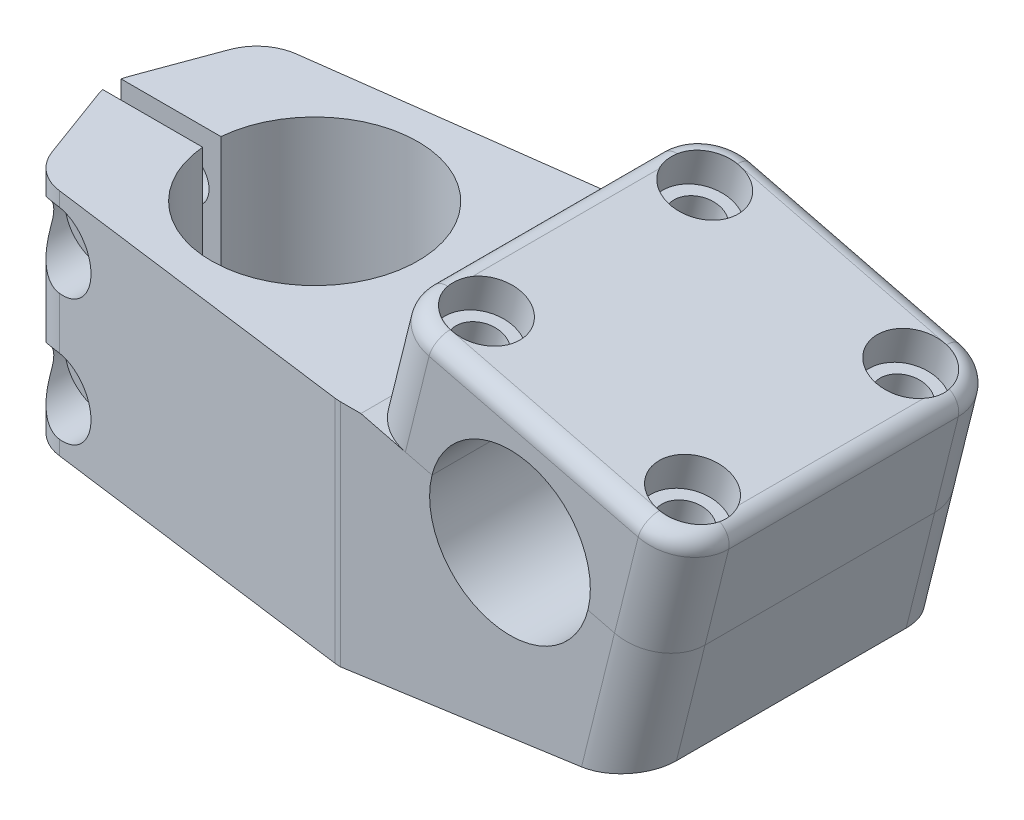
ISO-10303-21;
HEADER;
FILE_DESCRIPTION(('STEP AP214'),'2;1');
FILE_NAME('part.step','',(''),(''),'','','');
FILE_SCHEMA(('AUTOMOTIVE_DESIGN { 1 0 10303 214 1 1 1 1 }'));
ENDSEC;
DATA;
#1=APPLICATION_CONTEXT('core data for automotive mechanical design processes');
#2=APPLICATION_PROTOCOL_DEFINITION('international standard','automotive_design',2000,#1);
#3=PRODUCT_CONTEXT('',#1,'mechanical');
#4=PRODUCT('Part','Part','',(#3));
#5=PRODUCT_RELATED_PRODUCT_CATEGORY('part','',(#4));
#6=PRODUCT_DEFINITION_FORMATION('','',#4);
#7=PRODUCT_DEFINITION_CONTEXT('part definition',#1,'design');
#8=PRODUCT_DEFINITION('design','',#6,#7);
#9=PRODUCT_DEFINITION_SHAPE('','',#8);
#10=(LENGTH_UNIT() NAMED_UNIT(*) SI_UNIT(.MILLI.,.METRE.));
#11=(NAMED_UNIT(*) PLANE_ANGLE_UNIT() SI_UNIT($,.RADIAN.));
#12=(NAMED_UNIT(*) SI_UNIT($,.STERADIAN.) SOLID_ANGLE_UNIT());
#13=UNCERTAINTY_MEASURE_WITH_UNIT(LENGTH_MEASURE(1.E-05),#10,'distance_accuracy_value','');
#14=(GEOMETRIC_REPRESENTATION_CONTEXT(3) GLOBAL_UNCERTAINTY_ASSIGNED_CONTEXT((#13)) GLOBAL_UNIT_ASSIGNED_CONTEXT((#10,
#11,#12)) REPRESENTATION_CONTEXT('',''));
#15=CARTESIAN_POINT('',(0.,0.,0.));
#16=DIRECTION('',(0.,0.,1.));
#17=DIRECTION('',(1.,0.,0.));
#18=AXIS2_PLACEMENT_3D('',#15,#16,#17);
#19=CARTESIAN_POINT('',(28.6092294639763,31.75,-22.225));
#20=DIRECTION('',(0.241921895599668,0.970295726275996,0.));
#21=DIRECTION('',(-0.970295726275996,0.241921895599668,0.));
#22=AXIS2_PLACEMENT_3D('',#19,#20,#21);
#23=PLANE('',#22);
#24=CARTESIAN_POINT('',(35.0050376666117,30.1553459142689,-15.0876));
#25=DIRECTION('',(0.241921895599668,0.970295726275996,0.));
#26=DIRECTION('',(-0.970295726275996,0.241921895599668,0.));
#27=AXIS2_PLACEMENT_3D('',#24,#25,#26);
#28=CIRCLE('',#27,3.175);
#29=CARTESIAN_POINT('',(31.9243487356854,30.9234479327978,-15.0876));
#30=VERTEX_POINT('',#29);
#31=EDGE_CURVE('E51',#30,#30,#28,.T.);
#32=ORIENTED_EDGE('',*,*,#31,.T.);
#33=EDGE_LOOP('',(#32));
#34=FACE_BOUND('',#33,.T.);
#35=CARTESIAN_POINT('',(35.0050376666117,30.1553459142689,15.0876));
#36=DIRECTION('',(0.241921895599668,0.970295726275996,0.));
#37=DIRECTION('',(-0.970295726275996,0.241921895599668,0.));
#38=AXIS2_PLACEMENT_3D('',#35,#36,#37);
#39=CIRCLE('',#38,3.175);
#40=CARTESIAN_POINT('',(31.9243487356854,30.9234479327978,15.0876));
#41=VERTEX_POINT('',#40);
#42=EDGE_CURVE('E225',#41,#41,#39,.T.);
#43=ORIENTED_EDGE('',*,*,#42,.T.);
#44=EDGE_LOOP('',(#43));
#45=FACE_BOUND('',#44,.T.);
#46=DIRECTION('',(0.,0.,1.));
#47=VECTOR('',#46,1.);
#48=CARTESIAN_POINT('',(28.6092294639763,31.75,-22.225));
#49=LINE('',#48,#47);
#50=CARTESIAN_POINT('',(28.6092294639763,31.75,-15.875));
#51=VERTEX_POINT('',#50);
#52=CARTESIAN_POINT('',(28.6092294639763,31.75,15.875));
#53=VERTEX_POINT('',#52);
#54=EDGE_CURVE('E362',#51,#53,#49,.T.);
#55=ORIENTED_EDGE('',*,*,#54,.F.);
#56=CARTESIAN_POINT('',(34.7706073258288,30.2137959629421,-15.875));
#57=DIRECTION('',(0.241921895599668,0.970295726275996,0.));
#58=DIRECTION('',(-0.970295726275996,0.241921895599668,0.));
#59=AXIS2_PLACEMENT_3D('',#56,#57,#58);
#60=CIRCLE('',#59,6.35);
#61=CARTESIAN_POINT('',(34.7706073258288,30.2137959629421,-22.225));
#62=VERTEX_POINT('',#61);
#63=EDGE_CURVE('E385',#51,#62,#60,.F.);
#64=ORIENTED_EDGE('',*,*,#63,.T.);
#65=DIRECTION('',(-0.970295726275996,0.241921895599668,0.));
#66=VECTOR('',#65,1.);
#67=CARTESIAN_POINT('',(69.85,21.4675210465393,-22.225));
#68=LINE('',#67,#66);
#69=CARTESIAN_POINT('',(38.4472034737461,29.297117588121,-22.225));
#70=VERTEX_POINT('',#69);
#71=EDGE_CURVE('E363',#70,#62,#68,.T.);
#72=ORIENTED_EDGE('',*,*,#71,.F.);
#73=DIRECTION('',(0.,0.,1.));
#74=VECTOR('',#73,1.);
#75=CARTESIAN_POINT('',(38.4472034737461,29.297117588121,-22.225));
#76=LINE('',#75,#74);
#77=CARTESIAN_POINT('',(38.4472034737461,29.297117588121,22.225));
#78=VERTEX_POINT('',#77);
#79=EDGE_CURVE('E375',#70,#78,#76,.T.);
#80=ORIENTED_EDGE('',*,*,#79,.T.);
#81=DIRECTION('',(0.970295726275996,-0.241921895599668,0.));
#82=VECTOR('',#81,1.);
#83=CARTESIAN_POINT('',(28.6092294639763,31.75,22.225));
#84=LINE('',#83,#82);
#85=CARTESIAN_POINT('',(34.7706073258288,30.2137959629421,22.225));
#86=VERTEX_POINT('',#85);
#87=EDGE_CURVE('E370',#86,#78,#84,.T.);
#88=ORIENTED_EDGE('',*,*,#87,.F.);
#89=CARTESIAN_POINT('',(34.7706073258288,30.2137959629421,15.875));
#90=DIRECTION('',(0.241921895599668,0.970295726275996,0.));
#91=DIRECTION('',(-0.970295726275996,0.241921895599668,0.));
#92=AXIS2_PLACEMENT_3D('',#89,#90,#91);
#93=CIRCLE('',#92,6.35);
#94=EDGE_CURVE('E383',#86,#53,#93,.F.);
#95=ORIENTED_EDGE('',*,*,#94,.T.);
#96=EDGE_LOOP('',(#55,#64,#72,#80,#88,#95));
#97=FACE_BOUND('',#96,.T.);
#98=ADVANCED_FACE('F47',(#34,#45,#97),#23,.F.);
#99=CARTESIAN_POINT('',(73.6905100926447,36.8709657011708,-22.225));
#100=DIRECTION('',(0.,0.,1.));
#101=DIRECTION('',(1.,0.,0.));
#102=AXIS2_PLACEMENT_3D('',#99,#100,#101);
#103=PLANE('',#102);
#104=DIRECTION('',(-0.241921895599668,-0.970295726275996,0.));
#105=VECTOR('',#104,1.);
#106=CARTESIAN_POINT('',(38.6111174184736,45.6172406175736,-22.225));
#107=LINE('',#106,#105);
#108=CARTESIAN_POINT('',(38.039649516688,43.3252080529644,-22.225));
#109=VERTEX_POINT('',#108);
#110=EDGE_CURVE('E389',#62,#109,#107,.F.);
#111=ORIENTED_EDGE('',*,*,#110,.T.);
#112=DIRECTION('',(-0.970295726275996,0.241921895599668,0.));
#113=VECTOR('',#112,1.);
#114=CARTESIAN_POINT('',(66.9576643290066,36.1151371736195,-22.225));
#115=LINE('',#114,#113);
#116=CARTESIAN_POINT('',(66.9576643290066,36.1151371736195,-22.225));
#117=VERTEX_POINT('',#116);
#118=EDGE_CURVE('E213',#109,#117,#115,.F.);
#119=ORIENTED_EDGE('',*,*,#118,.T.);
#120=DIRECTION('',(-0.241921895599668,-0.970295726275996,0.));
#121=VECTOR('',#120,1.);
#122=CARTESIAN_POINT('',(67.5291322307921,38.4071697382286,-22.225));
#123=LINE('',#122,#121);
#124=CARTESIAN_POINT('',(63.6886221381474,23.0037250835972,-22.225));
#125=VERTEX_POINT('',#124);
#126=EDGE_CURVE('E387',#117,#125,#123,.T.);
#127=ORIENTED_EDGE('',*,*,#126,.T.);
#128=CARTESIAN_POINT('',(60.0120259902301,23.9204034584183,-22.225));
#129=VERTEX_POINT('',#128);
#130=EDGE_CURVE('E353',#125,#129,#68,.T.);
#131=ORIENTED_EDGE('',*,*,#130,.T.);
#132=CARTESIAN_POINT('',(49.2296147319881,26.6087605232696,-22.225));
#133=DIRECTION('',(0.,0.,1.));
#134=DIRECTION('',(1.,0.,0.));
#135=AXIS2_PLACEMENT_3D('',#132,#133,#134);
#136=CIRCLE('',#135,11.1125);
#137=EDGE_CURVE('E276',#129,#70,#136,.T.);
#138=ORIENTED_EDGE('',*,*,#137,.T.);
#139=ORIENTED_EDGE('',*,*,#71,.T.);
#140=EDGE_LOOP('',(#111,#119,#127,#131,#138,#139));
#141=FACE_BOUND('',#140,.T.);
#142=ADVANCED_FACE('F319',(#141),#103,.F.);
#143=CARTESIAN_POINT('',(32.449739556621,47.1534446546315,-22.225));
#144=DIRECTION('',(0.970295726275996,-0.241921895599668,0.));
#145=DIRECTION('',(0.241921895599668,0.970295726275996,0.));
#146=AXIS2_PLACEMENT_3D('',#143,#144,#145);
#147=PLANE('',#146);
#148=DIRECTION('',(-0.241921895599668,-0.970295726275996,0.));
#149=VECTOR('',#148,1.);
#150=CARTESIAN_POINT('',(32.449739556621,47.1534446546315,15.875));
#151=LINE('',#150,#149);
#152=CARTESIAN_POINT('',(31.8782716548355,44.8614120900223,15.875));
#153=VERTEX_POINT('',#152);
#154=EDGE_CURVE('E378',#53,#153,#151,.F.);
#155=ORIENTED_EDGE('',*,*,#154,.T.);
#156=DIRECTION('',(0.,0.,1.));
#157=VECTOR('',#156,1.);
#158=CARTESIAN_POINT('',(31.8782716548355,44.8614120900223,-15.875));
#159=LINE('',#158,#157);
#160=CARTESIAN_POINT('',(31.8782716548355,44.8614120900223,-15.875));
#161=VERTEX_POINT('',#160);
#162=EDGE_CURVE('E208',#153,#161,#159,.F.);
#163=ORIENTED_EDGE('',*,*,#162,.T.);
#164=DIRECTION('',(-0.241921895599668,-0.970295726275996,0.));
#165=VECTOR('',#164,1.);
#166=CARTESIAN_POINT('',(32.449739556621,47.1534446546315,-15.875));
#167=LINE('',#166,#165);
#168=EDGE_CURVE('E381',#161,#51,#167,.T.);
#169=ORIENTED_EDGE('',*,*,#168,.T.);
#170=ORIENTED_EDGE('',*,*,#54,.T.);
#171=EDGE_LOOP('',(#155,#163,#169,#170));
#172=FACE_BOUND('',#171,.T.);
#173=ADVANCED_FACE('F326',(#172),#147,.F.);
#174=CARTESIAN_POINT('',(32.449739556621,47.1534446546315,22.225));
#175=DIRECTION('',(0.,0.,-1.));
#176=DIRECTION('',(-1.,0.,0.));
#177=AXIS2_PLACEMENT_3D('',#174,#175,#176);
#178=PLANE('',#177);
#179=DIRECTION('',(-0.241921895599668,-0.970295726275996,0.));
#180=VECTOR('',#179,1.);
#181=CARTESIAN_POINT('',(67.5291322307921,38.4071697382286,22.225));
#182=LINE('',#181,#180);
#183=CARTESIAN_POINT('',(63.6886221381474,23.0037250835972,22.225));
#184=VERTEX_POINT('',#183);
#185=CARTESIAN_POINT('',(66.9576643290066,36.1151371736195,22.225));
#186=VERTEX_POINT('',#185);
#187=EDGE_CURVE('E392',#184,#186,#182,.F.);
#188=ORIENTED_EDGE('',*,*,#187,.T.);
#189=DIRECTION('',(0.970295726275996,-0.241921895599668,0.));
#190=VECTOR('',#189,1.);
#191=CARTESIAN_POINT('',(38.039649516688,43.3252080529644,22.225));
#192=LINE('',#191,#190);
#193=CARTESIAN_POINT('',(38.039649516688,43.3252080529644,22.225));
#194=VERTEX_POINT('',#193);
#195=EDGE_CURVE('E202',#186,#194,#192,.F.);
#196=ORIENTED_EDGE('',*,*,#195,.T.);
#197=DIRECTION('',(-0.241921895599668,-0.970295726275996,0.));
#198=VECTOR('',#197,1.);
#199=CARTESIAN_POINT('',(38.6111174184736,45.6172406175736,22.225));
#200=LINE('',#199,#198);
#201=EDGE_CURVE('E395',#194,#86,#200,.T.);
#202=ORIENTED_EDGE('',*,*,#201,.T.);
#203=ORIENTED_EDGE('',*,*,#87,.T.);
#204=CARTESIAN_POINT('',(49.2296147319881,26.6087605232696,22.225));
#205=DIRECTION('',(0.,0.,1.));
#206=DIRECTION('',(1.,0.,0.));
#207=AXIS2_PLACEMENT_3D('',#204,#205,#206);
#208=CIRCLE('',#207,11.1125);
#209=CARTESIAN_POINT('',(60.0120259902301,23.9204034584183,22.225));
#210=VERTEX_POINT('',#209);
#211=EDGE_CURVE('E243',#210,#78,#208,.T.);
#212=ORIENTED_EDGE('',*,*,#211,.F.);
#213=EDGE_CURVE('E366',#210,#184,#84,.T.);
#214=ORIENTED_EDGE('',*,*,#213,.T.);
#215=EDGE_LOOP('',(#188,#196,#202,#203,#212,#214));
#216=FACE_BOUND('',#215,.T.);
#217=ADVANCED_FACE('F442',(#216),#178,.F.);
#218=CARTESIAN_POINT('',(73.6905100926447,36.8709657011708,22.225));
#219=DIRECTION('',(-0.970295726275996,0.241921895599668,0.));
#220=DIRECTION('',(-0.241921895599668,-0.970295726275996,0.));
#221=AXIS2_PLACEMENT_3D('',#218,#219,#220);
#222=PLANE('',#221);
#223=DIRECTION('',(-0.241921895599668,-0.970295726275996,0.));
#224=VECTOR('',#223,1.);
#225=CARTESIAN_POINT('',(73.6905100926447,36.8709657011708,-15.875));
#226=LINE('',#225,#224);
#227=CARTESIAN_POINT('',(69.85,21.4675210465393,-15.875));
#228=VERTEX_POINT('',#227);
#229=CARTESIAN_POINT('',(73.1190421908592,34.5789331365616,-15.875));
#230=VERTEX_POINT('',#229);
#231=EDGE_CURVE('E402',#228,#230,#226,.F.);
#232=ORIENTED_EDGE('',*,*,#231,.T.);
#233=DIRECTION('',(0.,0.,-1.));
#234=VECTOR('',#233,1.);
#235=CARTESIAN_POINT('',(73.1190421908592,34.5789331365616,15.875));
#236=LINE('',#235,#234);
#237=CARTESIAN_POINT('',(73.1190421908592,34.5789331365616,15.875));
#238=VERTEX_POINT('',#237);
#239=EDGE_CURVE('E217',#230,#238,#236,.F.);
#240=ORIENTED_EDGE('',*,*,#239,.T.);
#241=DIRECTION('',(-0.241921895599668,-0.970295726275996,0.));
#242=VECTOR('',#241,1.);
#243=CARTESIAN_POINT('',(73.6905100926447,36.8709657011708,15.875));
#244=LINE('',#243,#242);
#245=CARTESIAN_POINT('',(69.85,21.4675210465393,15.875));
#246=VERTEX_POINT('',#245);
#247=EDGE_CURVE('E400',#238,#246,#244,.T.);
#248=ORIENTED_EDGE('',*,*,#247,.T.);
#249=DIRECTION('',(0.,0.,-1.));
#250=VECTOR('',#249,1.);
#251=CARTESIAN_POINT('',(69.85,21.4675210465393,22.225));
#252=LINE('',#251,#250);
#253=EDGE_CURVE('E372',#246,#228,#252,.T.);
#254=ORIENTED_EDGE('',*,*,#253,.T.);
#255=EDGE_LOOP('',(#232,#240,#248,#254));
#256=FACE_BOUND('',#255,.T.);
#257=ADVANCED_FACE('F343',(#256),#222,.F.);
#258=CARTESIAN_POINT('',(32.449739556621,47.1534446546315,-22.225));
#259=DIRECTION('',(0.241921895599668,0.970295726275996,0.));
#260=DIRECTION('',(-0.970295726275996,0.241921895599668,0.));
#261=AXIS2_PLACEMENT_3D('',#258,#259,#260);
#262=PLANE('',#261);
#263=CARTESIAN_POINT('',(38.8455477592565,45.5587905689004,-15.0876));
#264=DIRECTION('',(0.241921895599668,0.970295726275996,0.));
#265=DIRECTION('',(-0.970295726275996,0.241921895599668,0.));
#266=AXIS2_PLACEMENT_3D('',#263,#264,#265);
#267=CIRCLE('',#266,4.76249999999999);
#268=CARTESIAN_POINT('',(34.7417721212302,46.581976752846,-12.8981887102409));
#269=VERTEX_POINT('',#268);
#270=CARTESIAN_POINT('',(36.1850980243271,46.2221151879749,-18.9816228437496));
#271=VERTEX_POINT('',#270);
#272=EDGE_CURVE('E62',#269,#271,#267,.T.);
#273=ORIENTED_EDGE('',*,*,#272,.F.);
#274=DIRECTION('',(0.,0.,1.));
#275=VECTOR('',#274,1.);
#276=CARTESIAN_POINT('',(34.7417721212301,46.5819767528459,15.875));
#277=LINE('',#276,#275);
#278=CARTESIAN_POINT('',(34.7417721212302,46.581976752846,12.8981887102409));
#279=VERTEX_POINT('',#278);
#280=EDGE_CURVE('E182',#269,#279,#277,.T.);
#281=ORIENTED_EDGE('',*,*,#280,.T.);
#282=CARTESIAN_POINT('',(38.8455477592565,45.5587905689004,15.0876));
#283=DIRECTION('',(0.241921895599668,0.970295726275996,0.));
#284=DIRECTION('',(-0.970295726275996,0.241921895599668,0.));
#285=AXIS2_PLACEMENT_3D('',#282,#283,#284);
#286=CIRCLE('',#285,4.76249999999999);
#287=CARTESIAN_POINT('',(36.185098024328,46.2221151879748,18.9816228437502));
#288=VERTEX_POINT('',#287);
#289=EDGE_CURVE('E454',#288,#279,#286,.T.);
#290=ORIENTED_EDGE('',*,*,#289,.F.);
#291=CARTESIAN_POINT('',(38.6111174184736,45.6172406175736,15.875));
#292=DIRECTION('',(0.241921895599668,0.970295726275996,0.));
#293=DIRECTION('',(-0.970295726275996,0.241921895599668,0.));
#294=AXIS2_PLACEMENT_3D('',#291,#292,#293);
#295=CIRCLE('',#294,3.9878);
#296=CARTESIAN_POINT('',(38.6111174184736,45.6172406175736,19.8628));
#297=VERTEX_POINT('',#296);
#298=EDGE_CURVE('E192',#288,#297,#295,.T.);
#299=ORIENTED_EDGE('',*,*,#298,.T.);
#300=DIRECTION('',(0.970295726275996,-0.241921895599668,0.));
#301=VECTOR('',#300,1.);
#302=CARTESIAN_POINT('',(67.5291322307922,38.4071697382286,19.8628));
#303=LINE('',#302,#301);
#304=CARTESIAN_POINT('',(67.5291322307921,38.4071697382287,19.8628));
#305=VERTEX_POINT('',#304);
#306=EDGE_CURVE('E194',#297,#305,#303,.T.);
#307=ORIENTED_EDGE('',*,*,#306,.T.);
#308=CARTESIAN_POINT('',(67.5291322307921,38.4071697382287,15.875));
#309=DIRECTION('',(0.241921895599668,0.970295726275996,0.));
#310=DIRECTION('',(-0.970295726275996,0.241921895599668,0.));
#311=AXIS2_PLACEMENT_3D('',#308,#309,#310);
#312=CIRCLE('',#311,3.9878);
#313=CARTESIAN_POINT('',(69.657116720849,37.8766036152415,19.2055750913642));
#314=VERTEX_POINT('',#313);
#315=EDGE_CURVE('E405',#305,#314,#312,.T.);
#316=ORIENTED_EDGE('',*,*,#315,.T.);
#317=CARTESIAN_POINT('',(67.3357589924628,38.4553831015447,15.0876));
#318=DIRECTION('',(0.241921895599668,0.970295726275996,0.));
#319=DIRECTION('',(-0.970295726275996,0.241921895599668,0.));
#320=AXIS2_PLACEMENT_3D('',#317,#318,#319);
#321=CIRCLE('',#320,4.76249999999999);
#322=CARTESIAN_POINT('',(71.3984775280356,37.4424336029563,12.8183142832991));
#323=VERTEX_POINT('',#322);
#324=EDGE_CURVE('E515',#323,#314,#321,.T.);
#325=ORIENTED_EDGE('',*,*,#324,.F.);
#326=DIRECTION('',(0.,0.,-1.));
#327=VECTOR('',#326,1.);
#328=CARTESIAN_POINT('',(71.3984775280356,37.4424336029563,-15.875));
#329=LINE('',#328,#327);
#330=CARTESIAN_POINT('',(71.3984775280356,37.4424336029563,-12.8183142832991));
#331=VERTEX_POINT('',#330);
#332=EDGE_CURVE('E408',#323,#331,#329,.T.);
#333=ORIENTED_EDGE('',*,*,#332,.T.);
#334=CARTESIAN_POINT('',(67.3357589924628,38.4553831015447,-15.0876));
#335=DIRECTION('',(0.241921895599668,0.970295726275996,0.));
#336=DIRECTION('',(-0.970295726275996,0.241921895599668,0.));
#337=AXIS2_PLACEMENT_3D('',#334,#335,#336);
#338=CIRCLE('',#337,4.76249999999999);
#339=CARTESIAN_POINT('',(69.657116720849,37.8766036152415,-19.2055750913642));
#340=VERTEX_POINT('',#339);
#341=EDGE_CURVE('E293',#340,#331,#338,.T.);
#342=ORIENTED_EDGE('',*,*,#341,.F.);
#343=CARTESIAN_POINT('',(67.5291322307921,38.4071697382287,-15.875));
#344=DIRECTION('',(0.241921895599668,0.970295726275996,0.));
#345=DIRECTION('',(-0.970295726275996,0.241921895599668,0.));
#346=AXIS2_PLACEMENT_3D('',#343,#344,#345);
#347=CIRCLE('',#346,3.9878);
#348=CARTESIAN_POINT('',(67.5291322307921,38.4071697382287,-19.8628));
#349=VERTEX_POINT('',#348);
#350=EDGE_CURVE('E411',#340,#349,#347,.T.);
#351=ORIENTED_EDGE('',*,*,#350,.T.);
#352=DIRECTION('',(-0.970295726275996,0.241921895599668,0.));
#353=VECTOR('',#352,1.);
#354=CARTESIAN_POINT('',(38.6111174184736,45.6172406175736,-19.8628));
#355=LINE('',#354,#353);
#356=CARTESIAN_POINT('',(38.6111174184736,45.6172406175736,-19.8628));
#357=VERTEX_POINT('',#356);
#358=EDGE_CURVE('E196',#349,#357,#355,.T.);
#359=ORIENTED_EDGE('',*,*,#358,.T.);
#360=CARTESIAN_POINT('',(38.6111174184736,45.6172406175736,-15.875));
#361=DIRECTION('',(0.241921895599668,0.970295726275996,0.));
#362=DIRECTION('',(-0.970295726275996,0.241921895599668,0.));
#363=AXIS2_PLACEMENT_3D('',#360,#361,#362);
#364=CIRCLE('',#363,3.9878);
#365=EDGE_CURVE('E185',#357,#271,#364,.T.);
#366=ORIENTED_EDGE('',*,*,#365,.T.);
#367=EDGE_LOOP('',(#273,#281,#290,#299,#307,#316,#325,#333,#342,#351,#359,#366));
#368=FACE_BOUND('',#367,.T.);
#369=ADVANCED_FACE('F180',(#368),#262,.T.);
#370=CARTESIAN_POINT('',(63.495248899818,23.0519384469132,-15.0876));
#371=DIRECTION('',(0.241921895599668,0.970295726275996,0.));
#372=DIRECTION('',(-0.970295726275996,0.241921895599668,0.));
#373=AXIS2_PLACEMENT_3D('',#370,#371,#372);
#374=CIRCLE('',#373,3.175);
#375=CARTESIAN_POINT('',(60.4145599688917,23.8200404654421,-15.0876));
#376=VERTEX_POINT('',#375);
#377=EDGE_CURVE('E305',#376,#376,#374,.T.);
#378=ORIENTED_EDGE('',*,*,#377,.T.);
#379=EDGE_LOOP('',(#378));
#380=FACE_BOUND('',#379,.T.);
#381=CARTESIAN_POINT('',(63.495248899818,23.0519384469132,15.0876));
#382=DIRECTION('',(0.241921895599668,0.970295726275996,0.));
#383=DIRECTION('',(-0.970295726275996,0.241921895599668,0.));
#384=AXIS2_PLACEMENT_3D('',#381,#382,#383);
#385=CIRCLE('',#384,3.17499999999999);
#386=CARTESIAN_POINT('',(60.4145599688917,23.8200404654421,15.0876));
#387=VERTEX_POINT('',#386);
#388=EDGE_CURVE('E350',#387,#387,#385,.T.);
#389=ORIENTED_EDGE('',*,*,#388,.T.);
#390=EDGE_LOOP('',(#389));
#391=FACE_BOUND('',#390,.T.);
#392=ORIENTED_EDGE('',*,*,#130,.F.);
#393=CARTESIAN_POINT('',(63.6886221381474,23.0037250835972,-15.875));
#394=DIRECTION('',(0.241921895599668,0.970295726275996,0.));
#395=DIRECTION('',(-0.970295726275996,0.241921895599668,0.));
#396=AXIS2_PLACEMENT_3D('',#393,#394,#395);
#397=CIRCLE('',#396,6.35);
#398=EDGE_CURVE('E356',#125,#228,#397,.F.);
#399=ORIENTED_EDGE('',*,*,#398,.T.);
#400=ORIENTED_EDGE('',*,*,#253,.F.);
#401=CARTESIAN_POINT('',(63.6886221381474,23.0037250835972,15.875));
#402=DIRECTION('',(0.241921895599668,0.970295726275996,0.));
#403=DIRECTION('',(-0.970295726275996,0.241921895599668,0.));
#404=AXIS2_PLACEMENT_3D('',#401,#402,#403);
#405=CIRCLE('',#404,6.35);
#406=EDGE_CURVE('E397',#246,#184,#405,.F.);
#407=ORIENTED_EDGE('',*,*,#406,.T.);
#408=ORIENTED_EDGE('',*,*,#213,.F.);
#409=DIRECTION('',(0.,0.,1.));
#410=VECTOR('',#409,1.);
#411=CARTESIAN_POINT('',(60.0120259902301,23.9204034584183,-22.225));
#412=LINE('',#411,#410);
#413=EDGE_CURVE('E359',#210,#129,#412,.F.);
#414=ORIENTED_EDGE('',*,*,#413,.T.);
#415=EDGE_LOOP('',(#392,#399,#400,#407,#408,#414));
#416=FACE_BOUND('',#415,.T.);
#417=ADVANCED_FACE('F322',(#380,#391,#416),#23,.F.);
#418=CARTESIAN_POINT('',(49.2296147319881,26.6087605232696,-22.225));
#419=DIRECTION('',(0.,0.,1.));
#420=DIRECTION('',(1.,0.,0.));
#421=AXIS2_PLACEMENT_3D('',#418,#419,#420);
#422=CYLINDRICAL_SURFACE('',#421,11.1125);
#423=ORIENTED_EDGE('',*,*,#137,.F.);
#424=ORIENTED_EDGE('',*,*,#413,.F.);
#425=ORIENTED_EDGE('',*,*,#211,.T.);
#426=ORIENTED_EDGE('',*,*,#79,.F.);
#427=EDGE_LOOP('',(#423,#424,#425,#426));
#428=FACE_BOUND('',#427,.T.);
#429=ADVANCED_FACE('F334',(#428),#422,.F.);
#430=CARTESIAN_POINT('',(38.6111174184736,45.6172406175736,-15.875));
#431=DIRECTION('',(-0.241921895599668,-0.970295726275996,0.));
#432=DIRECTION('',(0.970295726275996,-0.241921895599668,0.));
#433=AXIS2_PLACEMENT_3D('',#430,#431,#432);
#434=CYLINDRICAL_SURFACE('',#433,6.35);
#435=ORIENTED_EDGE('',*,*,#168,.F.);
#436=CARTESIAN_POINT('',(38.039649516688,43.3252080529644,-15.875));
#437=DIRECTION('',(0.241921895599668,0.970295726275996,0.));
#438=DIRECTION('',(-0.970295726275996,0.241921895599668,0.));
#439=AXIS2_PLACEMENT_3D('',#436,#437,#438);
#440=CIRCLE('',#439,6.35);
#441=EDGE_CURVE('E211',#161,#109,#440,.F.);
#442=ORIENTED_EDGE('',*,*,#441,.T.);
#443=ORIENTED_EDGE('',*,*,#110,.F.);
#444=ORIENTED_EDGE('',*,*,#63,.F.);
#445=EDGE_LOOP('',(#435,#442,#443,#444));
#446=FACE_BOUND('',#445,.T.);
#447=ADVANCED_FACE('F340',(#446),#434,.T.);
#448=CARTESIAN_POINT('',(38.6111174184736,45.6172406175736,15.875));
#449=DIRECTION('',(-0.241921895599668,-0.970295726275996,0.));
#450=DIRECTION('',(0.970295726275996,-0.241921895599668,0.));
#451=AXIS2_PLACEMENT_3D('',#448,#449,#450);
#452=CYLINDRICAL_SURFACE('',#451,6.35);
#453=ORIENTED_EDGE('',*,*,#201,.F.);
#454=CARTESIAN_POINT('',(38.039649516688,43.3252080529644,15.875));
#455=DIRECTION('',(0.241921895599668,0.970295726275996,0.));
#456=DIRECTION('',(-0.970295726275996,0.241921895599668,0.));
#457=AXIS2_PLACEMENT_3D('',#454,#455,#456);
#458=CIRCLE('',#457,6.35);
#459=EDGE_CURVE('E205',#194,#153,#458,.F.);
#460=ORIENTED_EDGE('',*,*,#459,.T.);
#461=ORIENTED_EDGE('',*,*,#154,.F.);
#462=ORIENTED_EDGE('',*,*,#94,.F.);
#463=EDGE_LOOP('',(#453,#460,#461,#462));
#464=FACE_BOUND('',#463,.T.);
#465=ADVANCED_FACE('F433',(#464),#452,.T.);
#466=CARTESIAN_POINT('',(67.5291322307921,38.4071697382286,-15.875));
#467=DIRECTION('',(-0.241921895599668,-0.970295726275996,0.));
#468=DIRECTION('',(0.970295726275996,-0.241921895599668,0.));
#469=AXIS2_PLACEMENT_3D('',#466,#467,#468);
#470=CYLINDRICAL_SURFACE('',#469,6.35);
#471=ORIENTED_EDGE('',*,*,#126,.F.);
#472=CARTESIAN_POINT('',(66.9576643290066,36.1151371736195,-15.875));
#473=DIRECTION('',(0.241921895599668,0.970295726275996,0.));
#474=DIRECTION('',(-0.970295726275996,0.241921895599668,0.));
#475=AXIS2_PLACEMENT_3D('',#472,#473,#474);
#476=CIRCLE('',#475,6.35);
#477=EDGE_CURVE('E215',#117,#230,#476,.F.);
#478=ORIENTED_EDGE('',*,*,#477,.T.);
#479=ORIENTED_EDGE('',*,*,#231,.F.);
#480=ORIENTED_EDGE('',*,*,#398,.F.);
#481=EDGE_LOOP('',(#471,#478,#479,#480));
#482=FACE_BOUND('',#481,.T.);
#483=ADVANCED_FACE('F489',(#482),#470,.T.);
#484=CARTESIAN_POINT('',(67.5291322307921,38.4071697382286,15.875));
#485=DIRECTION('',(-0.241921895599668,-0.970295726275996,0.));
#486=DIRECTION('',(0.970295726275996,-0.241921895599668,0.));
#487=AXIS2_PLACEMENT_3D('',#484,#485,#486);
#488=CYLINDRICAL_SURFACE('',#487,6.35);
#489=ORIENTED_EDGE('',*,*,#247,.F.);
#490=CARTESIAN_POINT('',(66.9576643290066,36.1151371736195,15.875));
#491=DIRECTION('',(0.241921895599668,0.970295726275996,0.));
#492=DIRECTION('',(-0.970295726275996,0.241921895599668,0.));
#493=AXIS2_PLACEMENT_3D('',#490,#491,#492);
#494=CIRCLE('',#493,6.35);
#495=EDGE_CURVE('E219',#238,#186,#494,.F.);
#496=ORIENTED_EDGE('',*,*,#495,.T.);
#497=ORIENTED_EDGE('',*,*,#187,.F.);
#498=ORIENTED_EDGE('',*,*,#406,.F.);
#499=EDGE_LOOP('',(#489,#496,#497,#498));
#500=FACE_BOUND('',#499,.T.);
#501=ADVANCED_FACE('F316',(#500),#488,.T.);
#502=CARTESIAN_POINT('',(31.8782716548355,44.8614120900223,-19.8628));
#503=DIRECTION('',(0.970295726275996,-0.241921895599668,0.));
#504=DIRECTION('',(0.241921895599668,0.970295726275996,0.));
#505=AXIS2_PLACEMENT_3D('',#502,#503,#504);
#506=CYLINDRICAL_SURFACE('',#505,2.3622);
#507=CARTESIAN_POINT('',(66.9576643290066,36.1151371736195,-19.8628));
#508=DIRECTION('',(0.970295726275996,-0.24192189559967,0.));
#509=DIRECTION('',(0.24192189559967,0.970295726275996,0.));
#510=AXIS2_PLACEMENT_3D('',#507,#508,#509);
#511=CIRCLE('',#510,2.3622);
#512=EDGE_CURVE('E237',#117,#349,#511,.T.);
#513=ORIENTED_EDGE('',*,*,#512,.F.);
#514=ORIENTED_EDGE('',*,*,#118,.F.);
#515=CARTESIAN_POINT('',(38.039649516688,43.3252080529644,-19.8628));
#516=DIRECTION('',(-0.970295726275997,0.241921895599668,0.));
#517=DIRECTION('',(-0.241921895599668,-0.970295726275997,0.));
#518=AXIS2_PLACEMENT_3D('',#515,#516,#517);
#519=CIRCLE('',#518,2.3622);
#520=EDGE_CURVE('E240',#357,#109,#519,.T.);
#521=ORIENTED_EDGE('',*,*,#520,.F.);
#522=ORIENTED_EDGE('',*,*,#358,.F.);
#523=EDGE_LOOP('',(#513,#514,#521,#522));
#524=FACE_BOUND('',#523,.T.);
#525=ADVANCED_FACE('F49',(#524),#506,.T.);
#526=CARTESIAN_POINT('',(38.039649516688,43.3252080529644,-15.875));
#527=DIRECTION('',(0.241921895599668,0.970295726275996,0.));
#528=DIRECTION('',(-0.970295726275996,0.241921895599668,0.));
#529=AXIS2_PLACEMENT_3D('',#526,#527,#528);
#530=TOROIDAL_SURFACE('',#529,3.9878,2.3622);
#531=CARTESIAN_POINT('',(38.6113174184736,45.6171134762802,-19.8439789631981));
#532=CARTESIAN_POINT('',(38.4815214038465,45.649415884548,-19.8372052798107));
#533=CARTESIAN_POINT('',(38.3520035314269,45.6816348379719,-19.8247618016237));
#534=CARTESIAN_POINT('',(38.0944509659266,45.7457106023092,-19.7886869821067));
#535=CARTESIAN_POINT('',(37.9664162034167,45.7775674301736,-19.7650561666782));
#536=CARTESIAN_POINT('',(37.7127954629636,45.8407140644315,-19.706769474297));
#537=CARTESIAN_POINT('',(37.5872085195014,45.8720040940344,-19.6721180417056));
#538=CARTESIAN_POINT('',(37.3393279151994,45.9338149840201,-19.5920405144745));
#539=CARTESIAN_POINT('',(37.2170342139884,45.9643358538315,-19.5466145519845));
#540=CARTESIAN_POINT('',(36.9765683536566,46.0243896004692,-19.4452898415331));
#541=CARTESIAN_POINT('',(36.8583971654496,46.0539222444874,-19.389388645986));
#542=CARTESIAN_POINT('',(36.6270262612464,46.1117521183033,-19.2675239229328));
#543=CARTESIAN_POINT('',(36.5138284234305,46.1400488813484,-19.2015566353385));
#544=CARTESIAN_POINT('',(36.1831033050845,46.2226574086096,-18.9893370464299));
#545=CARTESIAN_POINT('',(35.9740850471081,46.2747774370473,-18.8286151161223));
#546=CARTESIAN_POINT('',(35.5850490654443,46.3709829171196,-18.4732491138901));
#547=CARTESIAN_POINT('',(35.4050311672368,46.415068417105,-18.2786052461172));
#548=CARTESIAN_POINT('',(35.1604774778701,46.4736842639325,-17.9655603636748));
#549=CARTESIAN_POINT('',(35.0831572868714,46.4919815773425,-17.8576110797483));
#550=CARTESIAN_POINT('',(34.9375110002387,46.525852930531,-17.6354219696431));
#551=CARTESIAN_POINT('',(34.869181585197,46.541427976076,-17.5211844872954));
#552=CARTESIAN_POINT('',(34.741120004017,46.5698426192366,-17.2856479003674));
#553=CARTESIAN_POINT('',(34.6815160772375,46.5826425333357,-17.1642743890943));
#554=CARTESIAN_POINT('',(34.5724212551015,46.60505538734,-16.9167750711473));
#555=CARTESIAN_POINT('',(34.5229306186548,46.6146682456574,-16.7906491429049));
#556=CARTESIAN_POINT('',(34.4343834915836,46.630554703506,-16.534499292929));
#557=CARTESIAN_POINT('',(34.395333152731,46.6368263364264,-16.4044731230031));
#558=CARTESIAN_POINT('',(34.3279504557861,46.6459089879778,-16.1415489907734));
#559=CARTESIAN_POINT('',(34.2996185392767,46.6487198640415,-16.0086509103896));
#560=CARTESIAN_POINT('',(34.276770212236,46.6497437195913,-15.8748));
#561=B_SPLINE_CURVE_WITH_KNOTS('',3,(#531,#532,#533,#534,#535,#536,#537,#538,#539,#540,#541,
#542,#543,#544,#545,#546,#547,#548,#549,#550,#551,#552,#553,#554,#555,#556,#557,#558,#559,#560),
.UNSPECIFIED.,.F.,.F.,(4,2,2,2,2,2,2,2,2,2,2,2,2,2,4),(0.,0.401656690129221,0.803294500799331,
1.20477054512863,1.60624166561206,2.0078067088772,2.40952212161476,3.21176701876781,
4.01400708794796,4.41572281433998,4.81728980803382,5.224267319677,5.63125524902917,
6.0384824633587,6.44572645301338),.UNSPECIFIED.);
#562=CARTESIAN_POINT('',(34.2768043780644,46.6497421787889,-15.875));
#563=VERTEX_POINT('',#562);
#564=EDGE_CURVE('E12',#271,#563,#561,.T.);
#565=ORIENTED_EDGE('',*,*,#564,.F.);
#566=ORIENTED_EDGE('',*,*,#365,.F.);
#567=ORIENTED_EDGE('',*,*,#520,.T.);
#568=ORIENTED_EDGE('',*,*,#441,.F.);
#569=CARTESIAN_POINT('',(34.1703042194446,44.2899441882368,-15.875));
#570=DIRECTION('',(0.,0.,1.));
#571=DIRECTION('',(1.,0.,0.));
#572=AXIS2_PLACEMENT_3D('',#569,#570,#571);
#573=CIRCLE('',#572,2.3622);
#574=EDGE_CURVE('E235',#563,#161,#573,.T.);
#575=ORIENTED_EDGE('',*,*,#574,.F.);
#576=EDGE_LOOP('',(#565,#566,#567,#568,#575));
#577=FACE_BOUND('',#576,.T.);
#578=ADVANCED_FACE('F307',(#577),#530,.T.);
#579=CARTESIAN_POINT('',(66.9576643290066,36.1151371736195,-15.875));
#580=DIRECTION('',(0.241921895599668,0.970295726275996,0.));
#581=DIRECTION('',(-0.970295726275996,0.241921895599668,0.));
#582=AXIS2_PLACEMENT_3D('',#579,#580,#581);
#583=TOROIDAL_SURFACE('',#582,3.9878,2.3622);
#584=CARTESIAN_POINT('',(71.879756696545,37.2650434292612,-15.8748));
#585=CARTESIAN_POINT('',(71.8595146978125,37.2751284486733,-16.0066355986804));
#586=CARTESIAN_POINT('',(71.8337631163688,37.2861827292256,-16.1375482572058));
#587=CARTESIAN_POINT('',(71.7714965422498,37.3102040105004,-16.3966027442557));
#588=CARTESIAN_POINT('',(71.7349820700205,37.3231709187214,-16.5247447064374));
#589=CARTESIAN_POINT('',(71.6514614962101,37.3509866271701,-16.7772912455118));
#590=CARTESIAN_POINT('',(71.6044599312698,37.3658346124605,-16.901697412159));
#591=CARTESIAN_POINT('',(71.5003130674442,37.397384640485,-17.1459404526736));
#592=CARTESIAN_POINT('',(71.4431678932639,37.4140866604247,-17.2657773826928));
#593=CARTESIAN_POINT('',(71.3191322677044,37.4493144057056,-17.5000672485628));
#594=CARTESIAN_POINT('',(71.2522392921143,37.4678406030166,-17.6145187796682));
#595=CARTESIAN_POINT('',(71.1092197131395,37.5066678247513,-17.8372023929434));
#596=CARTESIAN_POINT('',(71.0330896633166,37.5269695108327,-17.9454321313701));
#597=CARTESIAN_POINT('',(70.7917887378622,37.590427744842,-18.2594164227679));
#598=CARTESIAN_POINT('',(70.6135202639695,37.636189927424,-18.4548178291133));
#599=CARTESIAN_POINT('',(70.2273346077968,37.7340639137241,-18.8120486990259));
#600=CARTESIAN_POINT('',(70.0194011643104,37.7861791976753,-18.9738596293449));
#601=CARTESIAN_POINT('',(69.6900586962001,37.8684044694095,-19.1878586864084));
#602=CARTESIAN_POINT('',(69.5772772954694,37.8965114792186,-19.2544456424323));
#603=CARTESIAN_POINT('',(69.3466814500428,37.9539416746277,-19.3775923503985));
#604=CARTESIAN_POINT('',(69.2288688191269,37.9832644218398,-19.4341556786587));
#605=CARTESIAN_POINT('',(68.9837578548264,38.0442809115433,-19.5391197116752));
#606=CARTESIAN_POINT('',(68.8562703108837,38.0760221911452,-19.5870506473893));
#607=CARTESIAN_POINT('',(68.5977019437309,38.1404383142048,-19.671183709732));
#608=CARTESIAN_POINT('',(68.4666209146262,38.1731132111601,-19.7073851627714));
#609=CARTESIAN_POINT('',(68.2017794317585,38.2391742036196,-19.7677936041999));
#610=CARTESIAN_POINT('',(68.0680168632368,38.2725608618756,-19.7919907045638));
#611=CARTESIAN_POINT('',(67.7989482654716,38.3397355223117,-19.8281787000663));
#612=CARTESIAN_POINT('',(67.6636422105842,38.3735235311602,-19.8401693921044));
#613=CARTESIAN_POINT('',(67.5280823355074,38.4073697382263,-19.8459729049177));
#614=B_SPLINE_CURVE_WITH_KNOTS('',3,(#584,#585,#586,#587,#588,#589,#590,#591,#592,#593,#594,
#595,#596,#597,#598,#599,#600,#601,#602,#603,#604,#605,#606,#607,#608,#609,#610,#611,#612,#613),
.UNSPECIFIED.,.F.,.F.,(4,2,2,2,2,2,2,2,2,2,2,2,2,2,4),(0.,0.401160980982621,0.802302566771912,
1.20327095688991,1.60423441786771,2.00530189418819,2.40651947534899,3.20776473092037,
4.00945089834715,4.41091237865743,4.81223033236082,5.23124007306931,5.65027387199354,
6.06965225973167,6.48903762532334),.UNSPECIFIED.);
#615=CARTESIAN_POINT('',(71.8797259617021,37.2650587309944,-15.875));
#616=VERTEX_POINT('',#615);
#617=EDGE_CURVE('E56',#616,#340,#614,.T.);
#618=ORIENTED_EDGE('',*,*,#617,.F.);
#619=CARTESIAN_POINT('',(70.82700962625,35.1504010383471,-15.875));
#620=DIRECTION('',(0.,0.,1.));
#621=DIRECTION('',(1.,0.,0.));
#622=AXIS2_PLACEMENT_3D('',#619,#620,#621);
#623=CIRCLE('',#622,2.3622);
#624=EDGE_CURVE('E232',#230,#616,#623,.T.);
#625=ORIENTED_EDGE('',*,*,#624,.F.);
#626=ORIENTED_EDGE('',*,*,#477,.F.);
#627=ORIENTED_EDGE('',*,*,#512,.T.);
#628=ORIENTED_EDGE('',*,*,#350,.F.);
#629=EDGE_LOOP('',(#618,#625,#626,#627,#628));
#630=FACE_BOUND('',#629,.T.);
#631=ADVANCED_FACE('F282',(#630),#583,.T.);
#632=CARTESIAN_POINT('',(34.1703042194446,44.2899441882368,-22.225));
#633=DIRECTION('',(0.,0.,-1.));
#634=DIRECTION('',(-1.,0.,0.));
#635=AXIS2_PLACEMENT_3D('',#632,#633,#634);
#636=CYLINDRICAL_SURFACE('',#635,2.3622);
#637=CARTESIAN_POINT('',(34.2768043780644,46.6497421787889,-15.875));
#638=CARTESIAN_POINT('',(34.2656167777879,46.6502435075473,-15.8095223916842));
#639=CARTESIAN_POINT('',(34.2558069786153,46.6506106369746,-15.7438162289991));
#640=CARTESIAN_POINT('',(34.2389795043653,46.6511613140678,-15.6120450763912));
#641=CARTESIAN_POINT('',(34.2319618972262,46.6513448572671,-15.545980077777));
#642=CARTESIAN_POINT('',(34.2151571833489,46.6517472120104,-15.3474500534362));
#643=CARTESIAN_POINT('',(34.2096095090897,46.6518180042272,-15.2145993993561));
#644=CARTESIAN_POINT('',(34.2099371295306,46.6518108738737,-14.9523896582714));
#645=CARTESIAN_POINT('',(34.2155190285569,46.6517367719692,-14.8230296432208));
#646=CARTESIAN_POINT('',(34.2374168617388,46.6512160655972,-14.565225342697));
#647=CARTESIAN_POINT('',(34.2537322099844,46.650769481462,-14.4367810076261));
#648=CARTESIAN_POINT('',(34.2957356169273,46.648900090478,-14.1880352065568));
#649=CARTESIAN_POINT('',(34.3209157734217,46.6475270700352,-14.0676470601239));
#650=CARTESIAN_POINT('',(34.3803297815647,46.6429765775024,-13.8291658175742));
#651=CARTESIAN_POINT('',(34.4145633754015,46.6397991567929,-13.7110726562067));
#652=CARTESIAN_POINT('',(34.492604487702,46.6303949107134,-13.4748417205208));
#653=CARTESIAN_POINT('',(34.5366348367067,46.6240920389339,-13.3567803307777));
#654=CARTESIAN_POINT('',(34.6330801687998,46.6068755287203,-13.1244494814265));
#655=CARTESIAN_POINT('',(34.6854973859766,46.5959606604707,-13.0101810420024));
#656=CARTESIAN_POINT('',(34.7417721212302,46.5819767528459,-12.8981887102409));
#657=B_SPLINE_CURVE_WITH_KNOTS('',3,(#637,#638,#639,#640,#641,#642,#643,#644,#645,#646,#647,
#648,#649,#650,#651,#652,#653,#654,#655,#656),.UNSPECIFIED.,.F.,.F.,(4,2,2,2,2,2,2,2,2,4),(0.,
0.199254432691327,0.398513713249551,0.796878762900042,1.1848810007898,1.57286206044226,
1.94149772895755,2.31012290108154,2.68819305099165,3.06636407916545),.UNSPECIFIED.);
#658=EDGE_CURVE('E170',#563,#269,#657,.T.);
#659=ORIENTED_EDGE('',*,*,#658,.F.);
#660=ORIENTED_EDGE('',*,*,#574,.T.);
#661=ORIENTED_EDGE('',*,*,#162,.F.);
#662=CARTESIAN_POINT('',(34.1703042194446,44.2899441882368,15.875));
#663=DIRECTION('',(0.,0.,1.));
#664=DIRECTION('',(1.,0.,0.));
#665=AXIS2_PLACEMENT_3D('',#662,#663,#664);
#666=CIRCLE('',#665,2.3622);
#667=CARTESIAN_POINT('',(34.2768043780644,46.6497421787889,15.875));
#668=VERTEX_POINT('',#667);
#669=EDGE_CURVE('E230',#668,#153,#666,.T.);
#670=ORIENTED_EDGE('',*,*,#669,.F.);
#671=CARTESIAN_POINT('',(34.7417721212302,46.5819767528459,12.8981887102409));
#672=CARTESIAN_POINT('',(34.7119485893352,46.5894097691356,12.9575625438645));
#673=CARTESIAN_POINT('',(34.6832004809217,46.5959624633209,13.0175727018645));
#674=CARTESIAN_POINT('',(34.6279658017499,46.607557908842,13.1387618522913));
#675=CARTESIAN_POINT('',(34.6014790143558,46.6126008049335,13.1999407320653));
#676=CARTESIAN_POINT('',(34.5255868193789,46.6258394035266,13.3850469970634));
#677=CARTESIAN_POINT('',(34.4797276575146,46.6321500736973,13.5105874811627));
#678=CARTESIAN_POINT('',(34.3993214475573,46.6413550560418,13.7616722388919));
#679=CARTESIAN_POINT('',(34.364507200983,46.6443353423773,13.8871285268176));
#680=CARTESIAN_POINT('',(34.3051171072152,46.6484824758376,14.1404698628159));
#681=CARTESIAN_POINT('',(34.2805403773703,46.6496494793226,14.2683547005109));
#682=CARTESIAN_POINT('',(34.243217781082,46.6510876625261,14.5178389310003));
#683=CARTESIAN_POINT('',(34.2298396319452,46.6514093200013,14.6393437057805));
#684=CARTESIAN_POINT('',(34.2126783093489,46.6517797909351,14.8830274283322));
#685=CARTESIAN_POINT('',(34.2088950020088,46.6518286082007,15.0052063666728));
#686=CARTESIAN_POINT('',(34.2110156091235,46.6517941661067,15.2525820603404));
#687=CARTESIAN_POINT('',(34.2171665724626,46.6517075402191,15.3777771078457));
#688=CARTESIAN_POINT('',(34.2339242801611,46.6512930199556,15.5648735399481));
#689=CARTESIAN_POINT('',(34.2407673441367,46.6511073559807,15.6271343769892));
#690=CARTESIAN_POINT('',(34.2569336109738,46.6505685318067,15.7513313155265));
#691=CARTESIAN_POINT('',(34.2662567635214,46.6502153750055,15.8132674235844));
#692=CARTESIAN_POINT('',(34.2768043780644,46.6497421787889,15.875));
#693=B_SPLINE_CURVE_WITH_KNOTS('',3,(#671,#672,#673,#674,#675,#676,#677,#678,#679,#680,#681,
#682,#683,#684,#685,#686,#687,#688,#689,#690,#691,#692),.UNSPECIFIED.,.F.,.F.,(4,2,2,2,2,2,2,2,
2,2,4),(0.,0.200533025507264,0.401046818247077,0.801928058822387,1.19220255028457,
1.58244338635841,1.94878889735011,2.31512929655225,2.69072106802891,2.87858604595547,
3.06644721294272),.UNSPECIFIED.);
#694=EDGE_CURVE('E191',#279,#668,#693,.T.);
#695=ORIENTED_EDGE('',*,*,#694,.F.);
#696=ORIENTED_EDGE('',*,*,#280,.F.);
#697=EDGE_LOOP('',(#659,#660,#661,#670,#695,#696));
#698=FACE_BOUND('',#697,.T.);
#699=ADVANCED_FACE('F189',(#698),#636,.T.);
#700=CARTESIAN_POINT('',(70.82700962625,35.1504010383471,-22.225));
#701=DIRECTION('',(0.,0.,1.));
#702=DIRECTION('',(1.,0.,0.));
#703=AXIS2_PLACEMENT_3D('',#700,#701,#702);
#704=CYLINDRICAL_SURFACE('',#703,2.3622);
#705=CARTESIAN_POINT('',(71.3984775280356,37.4424336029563,-12.8183142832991));
#706=CARTESIAN_POINT('',(71.4292873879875,37.4347491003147,-12.876903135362));
#707=CARTESIAN_POINT('',(71.4587440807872,37.4267479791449,-12.9361474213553));
#708=CARTESIAN_POINT('',(71.5149702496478,37.410391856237,-13.0558424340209));
#709=CARTESIAN_POINT('',(71.5417400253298,37.4020368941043,-13.1162930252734));
#710=CARTESIAN_POINT('',(71.6180332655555,37.3768654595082,-13.2992593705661));
#711=CARTESIAN_POINT('',(71.6635699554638,37.3599345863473,-13.423445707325));
#712=CARTESIAN_POINT('',(71.7430492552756,37.3281616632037,-13.6719378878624));
#713=CARTESIAN_POINT('',(71.777273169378,37.3132753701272,-13.7961488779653));
#714=CARTESIAN_POINT('',(71.8359344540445,37.2865424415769,-14.0471875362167));
#715=CARTESIAN_POINT('',(71.8603719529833,37.2746957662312,-14.1740151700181));
#716=CARTESIAN_POINT('',(71.8996065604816,37.2551595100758,-14.4298148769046));
#717=CARTESIAN_POINT('',(71.9143783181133,37.2474808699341,-14.5587916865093));
#718=CARTESIAN_POINT('',(71.9342352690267,37.2370648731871,-14.8176877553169));
#719=CARTESIAN_POINT('',(71.9393202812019,37.2343276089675,-14.9476070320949));
#720=CARTESIAN_POINT('',(71.9398250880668,37.2340600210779,-15.2110859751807));
#721=CARTESIAN_POINT('',(71.9349735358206,37.2366758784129,-15.3446468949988));
#722=CARTESIAN_POINT('',(71.9200256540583,37.2445191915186,-15.5442350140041));
#723=CARTESIAN_POINT('',(71.9137623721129,37.2477880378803,-15.6106534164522));
#724=CARTESIAN_POINT('',(71.8986701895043,37.2555379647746,-15.7431253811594));
#725=CARTESIAN_POINT('',(71.8898413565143,37.2600190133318,-15.8091789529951));
#726=CARTESIAN_POINT('',(71.8797259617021,37.2650587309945,-15.875));
#727=B_SPLINE_CURVE_WITH_KNOTS('',3,(#705,#706,#707,#708,#709,#710,#711,#712,#713,#714,#715,
#716,#717,#718,#719,#720,#721,#722,#723,#724,#725,#726),.UNSPECIFIED.,.F.,.F.,(4,2,2,2,2,2,2,2,
2,2,4),(0.,0.199880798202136,0.399739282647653,0.799265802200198,1.18794118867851,
1.57661147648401,1.96629711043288,2.35599003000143,2.75646642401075,2.95679304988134,
3.15711439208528),.UNSPECIFIED.);
#728=EDGE_CURVE('E70',#331,#616,#727,.T.);
#729=ORIENTED_EDGE('',*,*,#728,.F.);
#730=ORIENTED_EDGE('',*,*,#332,.F.);
#731=CARTESIAN_POINT('',(71.8797259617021,37.2650587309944,15.875));
#732=CARTESIAN_POINT('',(71.8897518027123,37.2600637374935,15.8097618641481));
#733=CARTESIAN_POINT('',(71.8985137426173,37.2556174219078,15.7442952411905));
#734=CARTESIAN_POINT('',(71.9135173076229,37.2479147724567,15.6130025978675));
#735=CARTESIAN_POINT('',(71.9197588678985,37.2446584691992,15.5471765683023));
#736=CARTESIAN_POINT('',(71.9347091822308,37.2368161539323,15.3493683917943));
#737=CARTESIAN_POINT('',(71.9396523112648,37.2341522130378,15.2169990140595));
#738=CARTESIAN_POINT('',(71.9395057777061,37.234228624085,14.9558234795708));
#739=CARTESIAN_POINT('',(71.9346805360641,37.2368265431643,14.8270165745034));
#740=CARTESIAN_POINT('',(71.9155104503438,37.2468913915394,14.570304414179));
#741=CARTESIAN_POINT('',(71.9011656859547,37.2543582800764,14.4423991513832));
#742=CARTESIAN_POINT('',(71.8626213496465,37.2735983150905,14.1864739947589));
#743=CARTESIAN_POINT('',(71.8382796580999,37.28543330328,14.0584801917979));
#744=CARTESIAN_POINT('',(71.7796432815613,37.3122324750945,13.8051317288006));
#745=CARTESIAN_POINT('',(71.7453482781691,37.3271967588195,13.679777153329));
#746=CARTESIAN_POINT('',(71.6655428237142,37.3591905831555,13.4289793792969));
#747=CARTESIAN_POINT('',(71.6197436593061,37.3762664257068,13.3036331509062));
#748=CARTESIAN_POINT('',(71.5429156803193,37.4016656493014,13.1189817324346));
#749=CARTESIAN_POINT('',(71.5159442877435,37.4100982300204,13.057978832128));
#750=CARTESIAN_POINT('',(71.4592670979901,37.4266058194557,12.9371996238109));
#751=CARTESIAN_POINT('',(71.4295609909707,37.4346807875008,12.8774234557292));
#752=CARTESIAN_POINT('',(71.3984775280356,37.4424336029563,12.8183142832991));
#753=B_SPLINE_CURVE_WITH_KNOTS('',3,(#731,#732,#733,#734,#735,#736,#737,#738,#739,#740,#741,
#742,#743,#744,#745,#746,#747,#748,#749,#750,#751,#752),.UNSPECIFIED.,.F.,.F.,(4,2,2,2,2,2,2,2,
2,2,4),(0.,0.198547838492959,0.397100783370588,0.794033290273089,1.18036488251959,
1.56669324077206,1.95871511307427,2.3507495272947,2.75382708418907,2.95545935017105,
3.15711448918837),.UNSPECIFIED.);
#754=CARTESIAN_POINT('',(71.8797259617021,37.2650587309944,15.875));
#755=VERTEX_POINT('',#754);
#756=EDGE_CURVE('E459',#755,#323,#753,.T.);
#757=ORIENTED_EDGE('',*,*,#756,.F.);
#758=CARTESIAN_POINT('',(70.82700962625,35.1504010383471,15.875));
#759=DIRECTION('',(0.,0.,1.));
#760=DIRECTION('',(1.,0.,0.));
#761=AXIS2_PLACEMENT_3D('',#758,#759,#760);
#762=CIRCLE('',#761,2.3622);
#763=EDGE_CURVE('E227',#238,#755,#762,.T.);
#764=ORIENTED_EDGE('',*,*,#763,.F.);
#765=ORIENTED_EDGE('',*,*,#239,.F.);
#766=ORIENTED_EDGE('',*,*,#624,.T.);
#767=EDGE_LOOP('',(#729,#730,#757,#764,#765,#766));
#768=FACE_BOUND('',#767,.T.);
#769=ADVANCED_FACE('F281',(#768),#704,.T.);
#770=CARTESIAN_POINT('',(38.039649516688,43.3252080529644,15.875));
#771=DIRECTION('',(0.241921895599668,0.970295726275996,0.));
#772=DIRECTION('',(-0.970295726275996,0.241921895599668,0.));
#773=AXIS2_PLACEMENT_3D('',#770,#771,#772);
#774=TOROIDAL_SURFACE('',#773,3.9878,2.3622);
#775=CARTESIAN_POINT('',(34.276770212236,46.6497437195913,15.8748));
#776=CARTESIAN_POINT('',(34.2992752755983,46.6487349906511,16.0066361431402));
#777=CARTESIAN_POINT('',(34.3270992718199,46.6459930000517,16.1375480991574));
#778=CARTESIAN_POINT('',(34.3931490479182,46.637149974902,16.396598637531));
#779=CARTESIAN_POINT('',(34.4313743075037,46.6310491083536,16.524737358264));
#780=CARTESIAN_POINT('',(34.5179733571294,46.6155991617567,16.7772730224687));
#781=CARTESIAN_POINT('',(34.5663425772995,46.606251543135,16.9016716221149));
#782=CARTESIAN_POINT('',(34.6729116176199,46.5844561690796,17.1458981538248));
#783=CARTESIAN_POINT('',(34.7311113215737,46.5720084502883,17.2657261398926));
#784=CARTESIAN_POINT('',(34.8569796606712,46.5441811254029,17.5000021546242));
#785=CARTESIAN_POINT('',(34.9246511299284,46.5288006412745,17.6144485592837));
#786=CARTESIAN_POINT('',(35.0689882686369,46.4953124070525,17.8371215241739));
#787=CARTESIAN_POINT('',(35.1456572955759,46.4772036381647,17.9453457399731));
#788=CARTESIAN_POINT('',(35.3882802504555,46.419140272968,18.2593178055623));
#789=CARTESIAN_POINT('',(35.5670369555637,46.3754066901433,18.4547123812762));
#790=CARTESIAN_POINT('',(35.9537964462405,46.2798225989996,18.8119704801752));
#791=CARTESIAN_POINT('',(36.1618211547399,46.2279660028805,18.9738086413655));
#792=CARTESIAN_POINT('',(36.4911944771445,46.1457053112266,19.187837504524));
#793=CARTESIAN_POINT('',(36.6039657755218,46.1175163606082,19.2544314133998));
#794=CARTESIAN_POINT('',(36.8345333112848,46.0598866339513,19.3775898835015));
#795=CARTESIAN_POINT('',(36.9523276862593,46.030446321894,19.4341581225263));
#796=CARTESIAN_POINT('',(37.194193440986,45.9700376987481,19.5377518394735));
#797=CARTESIAN_POINT('',(37.3183380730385,45.9390517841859,19.5845957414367));
#798=CARTESIAN_POINT('',(37.5700816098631,45.8762723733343,19.6671558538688));
#799=CARTESIAN_POINT('',(37.6976806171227,45.844478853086,19.7028717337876));
#800=CARTESIAN_POINT('',(37.9554622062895,45.780293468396,19.7629219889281));
#801=CARTESIAN_POINT('',(38.0856462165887,45.7479012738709,19.7872498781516));
#802=CARTESIAN_POINT('',(38.3475632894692,45.6827392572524,19.8243340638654));
#803=CARTESIAN_POINT('',(38.4792964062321,45.6499694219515,19.8370899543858));
#804=CARTESIAN_POINT('',(38.6113174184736,45.6171134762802,19.8439789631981));
#805=B_SPLINE_CURVE_WITH_KNOTS('',3,(#775,#776,#777,#778,#779,#780,#781,#782,#783,#784,#785,
#786,#787,#788,#789,#790,#791,#792,#793,#794,#795,#796,#797,#798,#799,#800,#801,#802,#803,#804),
.UNSPECIFIED.,.F.,.F.,(4,2,2,2,2,2,2,2,2,2,2,2,2,2,4),(0.,0.401118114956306,0.802216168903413,
1.20313391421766,1.60404692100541,2.00508014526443,2.40626349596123,3.20745545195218,
4.00925076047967,4.4107492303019,4.81210010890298,5.22037885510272,5.62866972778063,
6.03719285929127,6.44573032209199),.UNSPECIFIED.);
#806=EDGE_CURVE('E221',#668,#288,#805,.T.);
#807=ORIENTED_EDGE('',*,*,#806,.F.);
#808=ORIENTED_EDGE('',*,*,#669,.T.);
#809=ORIENTED_EDGE('',*,*,#459,.F.);
#810=CARTESIAN_POINT('',(38.039649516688,43.3252080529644,19.8628));
#811=DIRECTION('',(0.970295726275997,-0.241921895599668,0.));
#812=DIRECTION('',(0.241921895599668,0.970295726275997,0.));
#813=AXIS2_PLACEMENT_3D('',#810,#811,#812);
#814=CIRCLE('',#813,2.3622);
#815=EDGE_CURVE('E224',#297,#194,#814,.T.);
#816=ORIENTED_EDGE('',*,*,#815,.F.);
#817=ORIENTED_EDGE('',*,*,#298,.F.);
#818=EDGE_LOOP('',(#807,#808,#809,#816,#817));
#819=FACE_BOUND('',#818,.T.);
#820=ADVANCED_FACE('F252',(#819),#774,.T.);
#821=CARTESIAN_POINT('',(66.9576643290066,36.1151371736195,15.875));
#822=DIRECTION('',(0.241921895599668,0.970295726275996,0.));
#823=DIRECTION('',(-0.970295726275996,0.241921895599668,0.));
#824=AXIS2_PLACEMENT_3D('',#821,#822,#823);
#825=TOROIDAL_SURFACE('',#824,3.9878,2.3622);
#826=CARTESIAN_POINT('',(67.5280823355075,38.4073697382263,19.8459729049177));
#827=CARTESIAN_POINT('',(67.657907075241,38.3749559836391,19.8404128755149));
#828=CARTESIAN_POINT('',(67.7874990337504,38.3425949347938,19.8291807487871));
#829=CARTESIAN_POINT('',(68.0453034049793,38.2782307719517,19.7955154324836));
#830=CARTESIAN_POINT('',(68.1735158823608,38.2462276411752,19.7730827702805));
#831=CARTESIAN_POINT('',(68.4276106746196,38.1828409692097,19.7171697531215));
#832=CARTESIAN_POINT('',(68.5534938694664,38.1514571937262,19.6836936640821));
#833=CARTESIAN_POINT('',(68.8020825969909,38.0895181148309,19.6059364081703));
#834=CARTESIAN_POINT('',(68.9247881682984,38.0589628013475,19.5616553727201));
#835=CARTESIAN_POINT('',(69.1661829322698,37.9988676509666,19.4625822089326));
#836=CARTESIAN_POINT('',(69.2848711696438,37.9693280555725,19.407787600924));
#837=CARTESIAN_POINT('',(69.5173588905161,37.9114384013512,19.288089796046));
#838=CARTESIAN_POINT('',(69.6311565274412,37.8830887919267,19.2231828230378));
#839=CARTESIAN_POINT('',(69.9637561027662,37.8001018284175,19.014063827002));
#840=CARTESIAN_POINT('',(70.1741299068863,37.7474357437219,18.8553034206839));
#841=CARTESIAN_POINT('',(70.5657492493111,37.6483823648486,18.5035971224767));
#842=CARTESIAN_POINT('',(70.7469960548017,37.6019947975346,18.3106527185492));
#843=CARTESIAN_POINT('',(70.9930117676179,37.5375795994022,17.9999163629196));
#844=CARTESIAN_POINT('',(71.0707573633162,37.5169551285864,17.8926942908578));
#845=CARTESIAN_POINT('',(71.217076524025,37.4774781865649,17.6718757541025));
#846=CARTESIAN_POINT('',(71.2856533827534,37.4586250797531,17.5582815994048));
#847=CARTESIAN_POINT('',(71.4156971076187,37.4220129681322,17.3208280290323));
#848=CARTESIAN_POINT('',(71.4767662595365,37.4043286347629,17.1967394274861));
#849=CARTESIAN_POINT('',(71.5879483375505,37.3709674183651,16.9434786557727));
#850=CARTESIAN_POINT('',(71.638060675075,37.3552906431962,16.8143062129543));
#851=CARTESIAN_POINT('',(71.7269513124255,37.3259698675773,16.5517725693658));
#852=CARTESIAN_POINT('',(71.7657200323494,37.312327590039,16.4184079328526));
#853=CARTESIAN_POINT('',(71.831574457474,37.2871202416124,16.1486299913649));
#854=CARTESIAN_POINT('',(71.8586599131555,37.275555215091,16.0122166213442));
#855=CARTESIAN_POINT('',(71.879756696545,37.2650434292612,15.8748));
#856=B_SPLINE_CURVE_WITH_KNOTS('',3,(#826,#827,#828,#829,#830,#831,#832,#833,#834,#835,#836,
#837,#838,#839,#840,#841,#842,#843,#844,#845,#846,#847,#848,#849,#850,#851,#852,#853,#854,#855),
.UNSPECIFIED.,.F.,.F.,(4,2,2,2,2,2,2,2,2,2,2,2,2,2,4),(0.,0.401653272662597,0.803287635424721,
1.20476703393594,1.60624154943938,2.00781087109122,2.40953050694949,3.2117697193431,
4.01397402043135,4.41568983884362,4.81726095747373,5.23500924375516,5.65277996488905,
6.07090248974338,6.48903394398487),.UNSPECIFIED.);
#857=EDGE_CURVE('E250',#314,#755,#856,.T.);
#858=ORIENTED_EDGE('',*,*,#857,.F.);
#859=ORIENTED_EDGE('',*,*,#315,.F.);
#860=CARTESIAN_POINT('',(66.9576643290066,36.1151371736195,19.8628));
#861=DIRECTION('',(-0.970295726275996,0.24192189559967,0.));
#862=DIRECTION('',(-0.24192189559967,-0.970295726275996,0.));
#863=AXIS2_PLACEMENT_3D('',#860,#861,#862);
#864=CIRCLE('',#863,2.3622);
#865=EDGE_CURVE('E222',#186,#305,#864,.T.);
#866=ORIENTED_EDGE('',*,*,#865,.F.);
#867=ORIENTED_EDGE('',*,*,#495,.F.);
#868=ORIENTED_EDGE('',*,*,#763,.T.);
#869=EDGE_LOOP('',(#858,#859,#866,#867,#868));
#870=FACE_BOUND('',#869,.T.);
#871=ADVANCED_FACE('F452',(#870),#825,.T.);
#872=CARTESIAN_POINT('',(31.8782716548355,44.8614120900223,19.8628));
#873=DIRECTION('',(-0.970295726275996,0.241921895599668,0.));
#874=DIRECTION('',(-0.241921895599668,-0.970295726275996,0.));
#875=AXIS2_PLACEMENT_3D('',#872,#873,#874);
#876=CYLINDRICAL_SURFACE('',#875,2.3622);
#877=ORIENTED_EDGE('',*,*,#815,.T.);
#878=ORIENTED_EDGE('',*,*,#195,.F.);
#879=ORIENTED_EDGE('',*,*,#865,.T.);
#880=ORIENTED_EDGE('',*,*,#306,.F.);
#881=EDGE_LOOP('',(#877,#878,#879,#880));
#882=FACE_BOUND('',#881,.T.);
#883=ADVANCED_FACE('F447',(#882),#876,.T.);
#884=CARTESIAN_POINT('',(38.8455477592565,45.5587905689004,15.0876));
#885=DIRECTION('',(0.241921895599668,0.970295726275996,0.));
#886=DIRECTION('',(-0.970295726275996,0.241921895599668,0.));
#887=AXIS2_PLACEMENT_3D('',#884,#885,#886);
#888=CYLINDRICAL_SURFACE('',#887,3.175);
#889=CARTESIAN_POINT('',(37.6903223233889,40.9254344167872,15.0876));
#890=DIRECTION('',(0.241921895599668,0.970295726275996,0.));
#891=DIRECTION('',(-0.970295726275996,0.241921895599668,0.));
#892=AXIS2_PLACEMENT_3D('',#889,#890,#891);
#893=CIRCLE('',#892,3.175);
#894=CARTESIAN_POINT('',(34.6096333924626,41.6935364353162,15.0876));
#895=VERTEX_POINT('',#894);
#896=EDGE_CURVE('E274',#895,#895,#893,.T.);
#897=ORIENTED_EDGE('',*,*,#896,.T.);
#898=EDGE_LOOP('',(#897));
#899=FACE_BOUND('',#898,.T.);
#900=ORIENTED_EDGE('',*,*,#42,.F.);
#901=EDGE_LOOP('',(#900));
#902=FACE_BOUND('',#901,.T.);
#903=ADVANCED_FACE('F486',(#899,#902),#888,.F.);
#904=CARTESIAN_POINT('',(37.6903223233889,40.9254344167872,18.2626));
#905=DIRECTION('',(-0.241921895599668,-0.970295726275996,0.));
#906=DIRECTION('',(0.970295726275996,-0.241921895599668,0.));
#907=AXIS2_PLACEMENT_3D('',#904,#905,#906);
#908=PLANE('',#907);
#909=ORIENTED_EDGE('',*,*,#896,.F.);
#910=EDGE_LOOP('',(#909));
#911=FACE_BOUND('',#910,.T.);
#912=CARTESIAN_POINT('',(37.6903223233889,40.9254344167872,15.0876));
#913=DIRECTION('',(0.241921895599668,0.970295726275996,0.));
#914=DIRECTION('',(-0.970295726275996,0.241921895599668,0.));
#915=AXIS2_PLACEMENT_3D('',#912,#913,#914);
#916=CIRCLE('',#915,4.7625);
#917=CARTESIAN_POINT('',(33.0692889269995,42.0775874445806,15.0876));
#918=VERTEX_POINT('',#917);
#919=EDGE_CURVE('E456',#918,#918,#916,.T.);
#920=ORIENTED_EDGE('',*,*,#919,.T.);
#921=EDGE_LOOP('',(#920));
#922=FACE_BOUND('',#921,.T.);
#923=ADVANCED_FACE('F262',(#911,#922),#908,.F.);
#924=CARTESIAN_POINT('',(38.8455477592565,45.5587905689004,15.0876));
#925=DIRECTION('',(0.241921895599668,0.970295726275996,0.));
#926=DIRECTION('',(-0.970295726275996,0.241921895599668,0.));
#927=AXIS2_PLACEMENT_3D('',#924,#925,#926);
#928=CYLINDRICAL_SURFACE('',#927,4.76249999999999);
#929=ORIENTED_EDGE('',*,*,#694,.T.);
#930=ORIENTED_EDGE('',*,*,#806,.T.);
#931=ORIENTED_EDGE('',*,*,#289,.T.);
#932=EDGE_LOOP('',(#929,#930,#931));
#933=FACE_BOUND('',#932,.T.);
#934=ORIENTED_EDGE('',*,*,#919,.F.);
#935=EDGE_LOOP('',(#934));
#936=FACE_BOUND('',#935,.T.);
#937=ADVANCED_FACE('F256',(#933,#936),#928,.F.);
#938=CARTESIAN_POINT('',(67.3357589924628,38.4553831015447,15.0876));
#939=DIRECTION('',(0.241921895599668,0.970295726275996,0.));
#940=DIRECTION('',(-0.970295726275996,0.241921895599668,0.));
#941=AXIS2_PLACEMENT_3D('',#938,#939,#940);
#942=CYLINDRICAL_SURFACE('',#941,3.17499999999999);
#943=CARTESIAN_POINT('',(66.1805335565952,33.8220269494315,15.0876));
#944=DIRECTION('',(0.241921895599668,0.970295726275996,0.));
#945=DIRECTION('',(-0.970295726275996,0.241921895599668,0.));
#946=AXIS2_PLACEMENT_3D('',#943,#944,#945);
#947=CIRCLE('',#946,3.175);
#948=CARTESIAN_POINT('',(63.099844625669,34.5901289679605,15.0876));
#949=VERTEX_POINT('',#948);
#950=EDGE_CURVE('E467',#949,#949,#947,.T.);
#951=ORIENTED_EDGE('',*,*,#950,.T.);
#952=EDGE_LOOP('',(#951));
#953=FACE_BOUND('',#952,.T.);
#954=ORIENTED_EDGE('',*,*,#388,.F.);
#955=EDGE_LOOP('',(#954));
#956=FACE_BOUND('',#955,.T.);
#957=ADVANCED_FACE('F261',(#953,#956),#942,.F.);
#958=CARTESIAN_POINT('',(66.1805335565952,33.8220269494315,18.2626));
#959=DIRECTION('',(-0.241921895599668,-0.970295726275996,0.));
#960=DIRECTION('',(0.970295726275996,-0.241921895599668,0.));
#961=AXIS2_PLACEMENT_3D('',#958,#959,#960);
#962=PLANE('',#961);
#963=ORIENTED_EDGE('',*,*,#950,.F.);
#964=EDGE_LOOP('',(#963));
#965=FACE_BOUND('',#964,.T.);
#966=CARTESIAN_POINT('',(66.1805335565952,33.8220269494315,15.0876));
#967=DIRECTION('',(0.241921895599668,0.970295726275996,0.));
#968=DIRECTION('',(-0.970295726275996,0.241921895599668,0.));
#969=AXIS2_PLACEMENT_3D('',#966,#967,#968);
#970=CIRCLE('',#969,4.7625);
#971=CARTESIAN_POINT('',(61.5595001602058,34.9741799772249,15.0876));
#972=VERTEX_POINT('',#971);
#973=EDGE_CURVE('E516',#972,#972,#970,.T.);
#974=ORIENTED_EDGE('',*,*,#973,.T.);
#975=EDGE_LOOP('',(#974));
#976=FACE_BOUND('',#975,.T.);
#977=ADVANCED_FACE('F474',(#965,#976),#962,.F.);
#978=CARTESIAN_POINT('',(67.3357589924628,38.4553831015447,15.0876));
#979=DIRECTION('',(0.241921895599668,0.970295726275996,0.));
#980=DIRECTION('',(-0.970295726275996,0.241921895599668,0.));
#981=AXIS2_PLACEMENT_3D('',#978,#979,#980);
#982=CYLINDRICAL_SURFACE('',#981,4.76249999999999);
#983=ORIENTED_EDGE('',*,*,#756,.T.);
#984=ORIENTED_EDGE('',*,*,#324,.T.);
#985=ORIENTED_EDGE('',*,*,#857,.T.);
#986=EDGE_LOOP('',(#983,#984,#985));
#987=FACE_BOUND('',#986,.T.);
#988=ORIENTED_EDGE('',*,*,#973,.F.);
#989=EDGE_LOOP('',(#988));
#990=FACE_BOUND('',#989,.T.);
#991=ADVANCED_FACE('F469',(#987,#990),#982,.F.);
#992=CARTESIAN_POINT('',(67.3357589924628,38.4553831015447,-15.0876));
#993=DIRECTION('',(0.241921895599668,0.970295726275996,0.));
#994=DIRECTION('',(-0.970295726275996,0.241921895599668,0.));
#995=AXIS2_PLACEMENT_3D('',#992,#993,#994);
#996=CYLINDRICAL_SURFACE('',#995,3.175);
#997=CARTESIAN_POINT('',(66.1805335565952,33.8220269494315,-15.0876));
#998=DIRECTION('',(0.241921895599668,0.970295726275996,0.));
#999=DIRECTION('',(-0.970295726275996,0.241921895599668,0.));
#1000=AXIS2_PLACEMENT_3D('',#997,#998,#999);
#1001=CIRCLE('',#1000,3.17500000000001);
#1002=CARTESIAN_POINT('',(63.099844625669,34.5901289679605,-15.0876));
#1003=VERTEX_POINT('',#1002);
#1004=EDGE_CURVE('E525',#1003,#1003,#1001,.T.);
#1005=ORIENTED_EDGE('',*,*,#1004,.T.);
#1006=EDGE_LOOP('',(#1005));
#1007=FACE_BOUND('',#1006,.T.);
#1008=ORIENTED_EDGE('',*,*,#377,.F.);
#1009=EDGE_LOOP('',(#1008));
#1010=FACE_BOUND('',#1009,.T.);
#1011=ADVANCED_FACE('F473',(#1007,#1010),#996,.F.);
#1012=CARTESIAN_POINT('',(66.1805335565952,33.8220269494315,-11.9126));
#1013=DIRECTION('',(-0.241921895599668,-0.970295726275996,0.));
#1014=DIRECTION('',(0.970295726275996,-0.241921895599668,0.));
#1015=AXIS2_PLACEMENT_3D('',#1012,#1013,#1014);
#1016=PLANE('',#1015);
#1017=ORIENTED_EDGE('',*,*,#1004,.F.);
#1018=EDGE_LOOP('',(#1017));
#1019=FACE_BOUND('',#1018,.T.);
#1020=CARTESIAN_POINT('',(66.1805335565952,33.8220269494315,-15.0876));
#1021=DIRECTION('',(0.241921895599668,0.970295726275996,0.));
#1022=DIRECTION('',(-0.970295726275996,0.241921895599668,0.));
#1023=AXIS2_PLACEMENT_3D('',#1020,#1021,#1022);
#1024=CIRCLE('',#1023,4.7625);
#1025=CARTESIAN_POINT('',(61.5595001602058,34.9741799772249,-15.0876));
#1026=VERTEX_POINT('',#1025);
#1027=EDGE_CURVE('E536',#1026,#1026,#1024,.T.);
#1028=ORIENTED_EDGE('',*,*,#1027,.T.);
#1029=EDGE_LOOP('',(#1028));
#1030=FACE_BOUND('',#1029,.T.);
#1031=ADVANCED_FACE('F530',(#1019,#1030),#1016,.F.);
#1032=CARTESIAN_POINT('',(67.3357589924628,38.4553831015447,-15.0876));
#1033=DIRECTION('',(0.241921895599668,0.970295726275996,0.));
#1034=DIRECTION('',(-0.970295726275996,0.241921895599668,0.));
#1035=AXIS2_PLACEMENT_3D('',#1032,#1033,#1034);
#1036=CYLINDRICAL_SURFACE('',#1035,4.76249999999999);
#1037=ORIENTED_EDGE('',*,*,#728,.T.);
#1038=ORIENTED_EDGE('',*,*,#617,.T.);
#1039=ORIENTED_EDGE('',*,*,#341,.T.);
#1040=EDGE_LOOP('',(#1037,#1038,#1039));
#1041=FACE_BOUND('',#1040,.T.);
#1042=ORIENTED_EDGE('',*,*,#1027,.F.);
#1043=EDGE_LOOP('',(#1042));
#1044=FACE_BOUND('',#1043,.T.);
#1045=ADVANCED_FACE('F526',(#1041,#1044),#1036,.F.);
#1046=CARTESIAN_POINT('',(38.8455477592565,45.5587905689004,-15.0876));
#1047=DIRECTION('',(0.241921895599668,0.970295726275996,0.));
#1048=DIRECTION('',(-0.970295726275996,0.241921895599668,0.));
#1049=AXIS2_PLACEMENT_3D('',#1046,#1047,#1048);
#1050=CYLINDRICAL_SURFACE('',#1049,3.175);
#1051=CARTESIAN_POINT('',(37.6903223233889,40.9254344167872,-15.0876));
#1052=DIRECTION('',(0.241921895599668,0.970295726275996,0.));
#1053=DIRECTION('',(-0.970295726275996,0.241921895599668,0.));
#1054=AXIS2_PLACEMENT_3D('',#1051,#1052,#1053);
#1055=CIRCLE('',#1054,3.17500000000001);
#1056=CARTESIAN_POINT('',(34.6096333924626,41.6935364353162,-15.0876));
#1057=VERTEX_POINT('',#1056);
#1058=EDGE_CURVE('E176',#1057,#1057,#1055,.T.);
#1059=ORIENTED_EDGE('',*,*,#1058,.T.);
#1060=EDGE_LOOP('',(#1059));
#1061=FACE_BOUND('',#1060,.T.);
#1062=ORIENTED_EDGE('',*,*,#31,.F.);
#1063=EDGE_LOOP('',(#1062));
#1064=FACE_BOUND('',#1063,.T.);
#1065=ADVANCED_FACE('F529',(#1061,#1064),#1050,.F.);
#1066=CARTESIAN_POINT('',(37.6903223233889,40.9254344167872,-11.9126));
#1067=DIRECTION('',(-0.241921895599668,-0.970295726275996,0.));
#1068=DIRECTION('',(0.970295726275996,-0.241921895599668,0.));
#1069=AXIS2_PLACEMENT_3D('',#1066,#1067,#1068);
#1070=PLANE('',#1069);
#1071=ORIENTED_EDGE('',*,*,#1058,.F.);
#1072=EDGE_LOOP('',(#1071));
#1073=FACE_BOUND('',#1072,.T.);
#1074=CARTESIAN_POINT('',(37.6903223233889,40.9254344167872,-15.0876));
#1075=DIRECTION('',(0.241921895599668,0.970295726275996,0.));
#1076=DIRECTION('',(-0.970295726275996,0.241921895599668,0.));
#1077=AXIS2_PLACEMENT_3D('',#1074,#1075,#1076);
#1078=CIRCLE('',#1077,4.7625);
#1079=CARTESIAN_POINT('',(33.0692889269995,42.0775874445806,-15.0876));
#1080=VERTEX_POINT('',#1079);
#1081=EDGE_CURVE('E186',#1080,#1080,#1078,.T.);
#1082=ORIENTED_EDGE('',*,*,#1081,.T.);
#1083=EDGE_LOOP('',(#1082));
#1084=FACE_BOUND('',#1083,.T.);
#1085=ADVANCED_FACE('F298',(#1073,#1084),#1070,.F.);
#1086=CARTESIAN_POINT('',(38.8455477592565,45.5587905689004,-15.0876));
#1087=DIRECTION('',(0.241921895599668,0.970295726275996,0.));
#1088=DIRECTION('',(-0.970295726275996,0.241921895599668,0.));
#1089=AXIS2_PLACEMENT_3D('',#1086,#1087,#1088);
#1090=CYLINDRICAL_SURFACE('',#1089,4.76249999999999);
#1091=ORIENTED_EDGE('',*,*,#658,.T.);
#1092=ORIENTED_EDGE('',*,*,#272,.T.);
#1093=ORIENTED_EDGE('',*,*,#564,.T.);
#1094=EDGE_LOOP('',(#1091,#1092,#1093));
#1095=FACE_BOUND('',#1094,.T.);
#1096=ORIENTED_EDGE('',*,*,#1081,.F.);
#1097=EDGE_LOOP('',(#1096));
#1098=FACE_BOUND('',#1097,.T.);
#1099=ADVANCED_FACE('F171',(#1095,#1098),#1090,.F.);
#1100=CLOSED_SHELL('',(#98,#142,#173,#217,#257,#369,#417,#429,#447,#465,#483,#501,#525,#578,
#631,#699,#769,#820,#871,#883,#903,#923,#937,#957,#977,#991,#1011,#1031,#1045,#1065,#1085,#1099));
#1101=MANIFOLD_SOLID_BREP('B2',#1100);
#1102=CARTESIAN_POINT('',(-19.05,24.6126,-38.1));
#1103=DIRECTION('',(0.,0.,1.));
#1104=DIRECTION('',(1.,0.,0.));
#1105=AXIS2_PLACEMENT_3D('',#1102,#1103,#1104);
#1106=CYLINDRICAL_SURFACE('',#1105,3.175);
#1107=CARTESIAN_POINT('',(-18.0987361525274,27.6417454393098,-16.4313595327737));
#1108=CARTESIAN_POINT('',(-18.254786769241,27.6907447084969,-16.4313541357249));
#1109=CARTESIAN_POINT('',(-18.4147001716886,27.7276636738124,-16.425555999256));
#1110=CARTESIAN_POINT('',(-18.7373994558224,27.7763885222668,-16.4012337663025));
#1111=CARTESIAN_POINT('',(-18.9001864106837,27.7881848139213,-16.3827048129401));
#1112=CARTESIAN_POINT('',(-19.2234053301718,27.7869713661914,-16.3331040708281));
#1113=CARTESIAN_POINT('',(-19.3838409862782,27.7740059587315,-16.3020547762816));
#1114=CARTESIAN_POINT('',(-19.6983912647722,27.7247671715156,-16.2286940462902));
#1115=CARTESIAN_POINT('',(-19.8525043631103,27.6884882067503,-16.1863799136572));
#1116=CARTESIAN_POINT('',(-20.156456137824,27.5929814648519,-16.0909002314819));
#1117=CARTESIAN_POINT('',(-20.3059428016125,27.5329766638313,-16.0373996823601));
#1118=CARTESIAN_POINT('',(-20.592051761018,27.392550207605,-15.9234162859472));
#1119=CARTESIAN_POINT('',(-20.7286705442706,27.3121229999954,-15.8629315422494));
#1120=CARTESIAN_POINT('',(-21.0041124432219,27.1213213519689,-15.7300403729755));
#1121=CARTESIAN_POINT('',(-21.140924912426,27.0084161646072,-15.6571049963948));
#1122=CARTESIAN_POINT('',(-21.3942611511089,26.761189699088,-15.5112210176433));
#1123=CARTESIAN_POINT('',(-21.510749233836,26.6268315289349,-15.4382726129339));
#1124=CARTESIAN_POINT('',(-21.672924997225,26.4043322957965,-15.3303992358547));
#1125=CARTESIAN_POINT('',(-21.7266897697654,26.3230235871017,-15.293292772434));
#1126=CARTESIAN_POINT('',(-21.8270189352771,26.1548001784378,-15.2220001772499));
#1127=CARTESIAN_POINT('',(-21.8735818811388,26.0678843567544,-15.1878146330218));
#1128=CARTESIAN_POINT('',(-21.9587941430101,25.8890486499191,-15.123709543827));
#1129=CARTESIAN_POINT('',(-21.9974643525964,25.7971428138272,-15.093778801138));
#1130=CARTESIAN_POINT('',(-22.0663621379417,25.6087161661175,-15.0394202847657));
#1131=CARTESIAN_POINT('',(-22.0965950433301,25.5121983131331,-15.014989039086));
#1132=CARTESIAN_POINT('',(-22.1568414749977,25.2811019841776,-14.9656519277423));
#1133=CARTESIAN_POINT('',(-22.1831545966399,25.1449162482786,-14.9435106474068));
#1134=CARTESIAN_POINT('',(-22.2176991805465,24.8687897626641,-14.914286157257));
#1135=CARTESIAN_POINT('',(-22.2259508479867,24.728853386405,-14.9071861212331));
#1136=CARTESIAN_POINT('',(-22.223873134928,24.4490665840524,-14.9089619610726));
#1137=CARTESIAN_POINT('',(-22.2135236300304,24.3092164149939,-14.917855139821));
#1138=CARTESIAN_POINT('',(-22.1748931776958,24.0337624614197,-14.9504513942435));
#1139=CARTESIAN_POINT('',(-22.1465974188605,23.8981622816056,-14.9741667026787));
#1140=CARTESIAN_POINT('',(-22.0733807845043,23.633412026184,-15.0338252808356));
#1141=CARTESIAN_POINT('',(-22.0283468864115,23.5043127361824,-15.0698515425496));
#1142=CARTESIAN_POINT('',(-21.9234406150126,23.2553076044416,-15.1507299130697));
#1143=CARTESIAN_POINT('',(-21.8635629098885,23.1354050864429,-15.1955851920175));
#1144=CARTESIAN_POINT('',(-21.7168215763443,22.8822061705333,-15.3007140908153));
#1145=CARTESIAN_POINT('',(-21.6269431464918,22.7511890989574,-15.3622645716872));
#1146=CARTESIAN_POINT('',(-21.4297014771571,22.504858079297,-15.4888479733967));
#1147=CARTESIAN_POINT('',(-21.3223212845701,22.3895595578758,-15.5538842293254));
#1148=CARTESIAN_POINT('',(-21.0692893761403,22.1553095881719,-15.6959126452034));
#1149=CARTESIAN_POINT('',(-20.9202492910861,22.0399247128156,-15.7727972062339));
#1150=CARTESIAN_POINT('',(-20.6015556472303,21.8360930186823,-15.9199470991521));
#1151=CARTESIAN_POINT('',(-20.4318992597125,21.7476499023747,-15.9902115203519));
#1152=CARTESIAN_POINT('',(-20.1654754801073,21.6384624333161,-16.086356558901));
#1153=CARTESIAN_POINT('',(-20.0749833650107,21.6060455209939,-16.1167809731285));
#1154=CARTESIAN_POINT('',(-19.8904285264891,21.5493325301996,-16.1741131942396));
#1155=CARTESIAN_POINT('',(-19.7963677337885,21.5250321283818,-16.2010228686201));
#1156=CARTESIAN_POINT('',(-19.6054703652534,21.4850477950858,-16.2507986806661));
#1157=CARTESIAN_POINT('',(-19.5086361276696,21.4693568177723,-16.2736681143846));
#1158=CARTESIAN_POINT('',(-19.3130035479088,21.4469814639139,-16.3149813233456));
#1159=CARTESIAN_POINT('',(-19.2142055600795,21.4402954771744,-16.3334258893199));
#1160=CARTESIAN_POINT('',(-19.0291067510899,21.4365077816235,-16.363435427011));
#1161=CARTESIAN_POINT('',(-18.9429242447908,21.4382313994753,-16.3755936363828));
#1162=CARTESIAN_POINT('',(-18.7705258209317,21.4487449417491,-16.3963209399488));
#1163=CARTESIAN_POINT('',(-18.6843099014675,21.4575371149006,-16.4048888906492));
#1164=CARTESIAN_POINT('',(-18.5126674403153,21.4821994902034,-16.4184379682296));
#1165=CARTESIAN_POINT('',(-18.4272404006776,21.4980648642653,-16.4234215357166));
#1166=CARTESIAN_POINT('',(-18.2578398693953,21.5367795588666,-16.429933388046));
#1167=CARTESIAN_POINT('',(-18.173866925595,21.5596314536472,-16.4314603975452));
#1168=CARTESIAN_POINT('',(-17.9375076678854,21.6345418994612,-16.4311592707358));
#1169=CARTESIAN_POINT('',(-17.7876615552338,21.694912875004,-16.4253743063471));
#1170=CARTESIAN_POINT('',(-17.4994517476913,21.8372941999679,-16.4046746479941));
#1171=CARTESIAN_POINT('',(-17.3610894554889,21.919307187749,-16.3897588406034));
#1172=CARTESIAN_POINT('',(-17.0933860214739,22.1065953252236,-16.3527850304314));
#1173=CARTESIAN_POINT('',(-16.9646617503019,22.2126979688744,-16.3304551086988));
#1174=CARTESIAN_POINT('',(-16.7256669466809,22.4433337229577,-16.2823334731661));
#1175=CARTESIAN_POINT('',(-16.6154050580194,22.5678754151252,-16.2565401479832));
#1176=CARTESIAN_POINT('',(-16.4082687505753,22.8424119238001,-16.203213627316));
#1177=CARTESIAN_POINT('',(-16.3129725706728,22.9936044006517,-16.1756917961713));
#1178=CARTESIAN_POINT('',(-16.1488227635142,23.3104403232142,-16.1251785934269));
#1179=CARTESIAN_POINT('',(-16.0799676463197,23.4760829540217,-16.1021869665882));
#1180=CARTESIAN_POINT('',(-15.9709421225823,23.8175354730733,-16.0645322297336));
#1181=CARTESIAN_POINT('',(-15.9307740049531,23.99334617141,-16.0498697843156));
#1182=CARTESIAN_POINT('',(-15.8807918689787,24.3497561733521,-16.0314827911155));
#1183=CARTESIAN_POINT('',(-15.8709627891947,24.5303530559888,-16.0277528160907));
#1184=CARTESIAN_POINT('',(-15.8817227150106,24.8798023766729,-16.0317672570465));
#1185=CARTESIAN_POINT('',(-15.9005539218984,25.0487199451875,-16.0388486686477));
#1186=CARTESIAN_POINT('',(-15.964693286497,25.3807880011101,-16.0621209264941));
#1187=CARTESIAN_POINT('',(-16.010004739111,25.5439377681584,-16.0783129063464));
#1188=CARTESIAN_POINT('',(-16.1257941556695,25.8608965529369,-16.1173945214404));
#1189=CARTESIAN_POINT('',(-16.1963731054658,26.0146651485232,-16.1403109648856));
#1190=CARTESIAN_POINT('',(-16.3607342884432,26.3087345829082,-16.1894843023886));
#1191=CARTESIAN_POINT('',(-16.4545289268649,26.4490281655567,-16.2157429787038));
#1192=CARTESIAN_POINT('',(-16.6694937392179,26.7210740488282,-16.2694737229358));
#1193=CARTESIAN_POINT('',(-16.7919771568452,26.8517955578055,-16.29692304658));
#1194=CARTESIAN_POINT('',(-17.0576764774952,27.0911428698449,-16.3468916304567));
#1195=CARTESIAN_POINT('',(-17.2008729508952,27.1997891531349,-16.3694154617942));
#1196=CARTESIAN_POINT('',(-17.4684025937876,27.369044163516,-16.4010752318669));
#1197=CARTESIAN_POINT('',(-17.5891943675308,27.4349374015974,-16.4121172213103));
#1198=CARTESIAN_POINT('',(-17.8386575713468,27.5506553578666,-16.4272608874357));
#1199=CARTESIAN_POINT('',(-17.9673272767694,27.600483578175,-16.4313640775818));
#1200=CARTESIAN_POINT('',(-18.0987361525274,27.6417454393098,-16.4313595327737));
#1201=B_SPLINE_CURVE_WITH_KNOTS('',3,(#1107,#1108,#1109,#1110,#1111,#1112,#1113,#1114,#1115,
#1116,#1117,#1118,#1119,#1120,#1121,#1122,#1123,#1124,#1125,#1126,#1127,#1128,#1129,#1130,#1131,
#1132,#1133,#1134,#1135,#1136,#1137,#1138,#1139,#1140,#1141,#1142,#1143,#1144,#1145,#1146,#1147,
#1148,#1149,#1150,#1151,#1152,#1153,#1154,#1155,#1156,#1157,#1158,#1159,#1160,#1161,#1162,#1163,
#1164,#1165,#1166,#1167,#1168,#1169,#1170,#1171,#1172,#1173,#1174,#1175,#1176,#1177,#1178,#1179,
#1180,#1181,#1182,#1183,#1184,#1185,#1186,#1187,#1188,#1189,#1190,#1191,#1192,#1193,#1194,#1195,
#1196,#1197,#1198,#1199,#1200),.UNSPECIFIED.,.T.,.F.,(4,2,2,2,2,2,2,2,2,2,2,2,2,2,2,2,2,2,2,2,2,
2,2,2,2,2,2,2,2,2,2,2,2,2,2,2,2,2,2,2,2,2,2,2,2,2,4),(0.,0.490186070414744,0.980559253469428,
1.4700553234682,1.95966870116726,2.46685723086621,2.97418380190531,3.54728520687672,
4.12138298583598,4.4339221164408,4.746523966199,5.05828724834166,5.36985314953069,
5.78929653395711,6.20827045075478,6.62769792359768,7.04747200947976,7.47013365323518,
7.89294733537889,8.40227409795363,8.91209718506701,9.52002654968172,10.128039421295,
10.4301357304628,10.7320708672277,11.0337585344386,11.3353922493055,11.5962027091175,
11.8570961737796,12.1178118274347,12.3786236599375,12.8611996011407,13.3438343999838,
13.8465972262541,14.3495947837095,14.8895388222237,15.4294524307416,15.9694091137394,
16.5090976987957,17.0169935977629,17.5249527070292,18.034965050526,18.5452505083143,
19.0864189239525,19.627082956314,20.0399544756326,20.4527359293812),.UNSPECIFIED.);
#1202=CARTESIAN_POINT('',(-18.929270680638,27.7853038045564,-16.3768112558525));
#1203=VERTEX_POINT('',#1202);
#1204=CARTESIAN_POINT('',(-18.929270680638,21.4398961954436,-16.3768112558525));
#1205=VERTEX_POINT('',#1204);
#1206=EDGE_CURVE('E1239',#1203,#1205,#1201,.T.);
#1207=ORIENTED_EDGE('',*,*,#1206,.F.);
#1208=CARTESIAN_POINT('',(-19.05,24.6126,-16.3608839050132));
#1209=DIRECTION('',(0.130792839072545,0.,0.991409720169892));
#1210=DIRECTION('',(-0.991409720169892,0.,0.130792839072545));
#1211=AXIS2_PLACEMENT_3D('',#1208,#1209,#1210);
#1212=ELLIPSE('',#1211,3.202510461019,3.175);
#1213=EDGE_CURVE('E1245',#1205,#1203,#1212,.T.);
#1214=ORIENTED_EDGE('',*,*,#1213,.F.);
#1215=EDGE_LOOP('',(#1207,#1214));
#1216=FACE_BOUND('',#1215,.T.);
#1217=CARTESIAN_POINT('',(-19.05,24.6126,-1.27));
#1218=DIRECTION('',(0.,0.,1.));
#1219=DIRECTION('',(1.,0.,0.));
#1220=AXIS2_PLACEMENT_3D('',#1217,#1218,#1219);
#1221=CIRCLE('',#1220,3.175);
#1222=CARTESIAN_POINT('',(-15.875,24.6126,-1.27));
#1223=VERTEX_POINT('',#1222);
#1224=EDGE_CURVE('E1194',#1223,#1223,#1221,.F.);
#1225=ORIENTED_EDGE('',*,*,#1224,.F.);
#1226=EDGE_LOOP('',(#1225));
#1227=FACE_BOUND('',#1226,.T.);
#1228=ADVANCED_FACE('F780',(#1216,#1227),#1106,.F.);
#1229=CARTESIAN_POINT('',(-19.05,7.1374,-38.1));
#1230=DIRECTION('',(0.,0.,1.));
#1231=DIRECTION('',(1.,0.,0.));
#1232=AXIS2_PLACEMENT_3D('',#1229,#1230,#1231);
#1233=CYLINDRICAL_SURFACE('',#1232,3.175);
#1234=CARTESIAN_POINT('',(-18.0987361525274,10.1665454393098,-16.4313595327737));
#1235=CARTESIAN_POINT('',(-18.254786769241,10.2155447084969,-16.4313541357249));
#1236=CARTESIAN_POINT('',(-18.4147001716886,10.2524636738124,-16.425555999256));
#1237=CARTESIAN_POINT('',(-18.7373994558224,10.3011885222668,-16.4012337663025));
#1238=CARTESIAN_POINT('',(-18.9001864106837,10.3129848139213,-16.3827048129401));
#1239=CARTESIAN_POINT('',(-19.2234053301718,10.3117713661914,-16.3331040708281));
#1240=CARTESIAN_POINT('',(-19.3838409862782,10.2988059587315,-16.3020547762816));
#1241=CARTESIAN_POINT('',(-19.6983912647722,10.2495671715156,-16.2286940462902));
#1242=CARTESIAN_POINT('',(-19.8525043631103,10.2132882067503,-16.1863799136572));
#1243=CARTESIAN_POINT('',(-20.156456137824,10.1177814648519,-16.0909002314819));
#1244=CARTESIAN_POINT('',(-20.3059428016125,10.0577766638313,-16.0373996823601));
#1245=CARTESIAN_POINT('',(-20.592051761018,9.91735020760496,-15.9234162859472));
#1246=CARTESIAN_POINT('',(-20.7286705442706,9.83692299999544,-15.8629315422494));
#1247=CARTESIAN_POINT('',(-21.0041124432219,9.64612135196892,-15.7300403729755));
#1248=CARTESIAN_POINT('',(-21.140924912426,9.53321616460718,-15.6571049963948));
#1249=CARTESIAN_POINT('',(-21.3942611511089,9.28598969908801,-15.5112210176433));
#1250=CARTESIAN_POINT('',(-21.510749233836,9.1516315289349,-15.4382726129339));
#1251=CARTESIAN_POINT('',(-21.672924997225,8.92913229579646,-15.3303992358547));
#1252=CARTESIAN_POINT('',(-21.7266897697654,8.84782358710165,-15.293292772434));
#1253=CARTESIAN_POINT('',(-21.8270189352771,8.67960017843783,-15.2220001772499));
#1254=CARTESIAN_POINT('',(-21.8735818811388,8.59268435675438,-15.1878146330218));
#1255=CARTESIAN_POINT('',(-21.9587941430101,8.41384864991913,-15.123709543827));
#1256=CARTESIAN_POINT('',(-21.9974643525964,8.32194281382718,-15.093778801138));
#1257=CARTESIAN_POINT('',(-22.0663621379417,8.13351616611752,-15.0394202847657));
#1258=CARTESIAN_POINT('',(-22.0965950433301,8.03699831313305,-15.014989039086));
#1259=CARTESIAN_POINT('',(-22.1568414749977,7.80590198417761,-14.9656519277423));
#1260=CARTESIAN_POINT('',(-22.1831545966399,7.66971624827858,-14.9435106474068));
#1261=CARTESIAN_POINT('',(-22.2176991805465,7.39358976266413,-14.914286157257));
#1262=CARTESIAN_POINT('',(-22.2259508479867,7.25365338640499,-14.9071861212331));
#1263=CARTESIAN_POINT('',(-22.223873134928,6.97386658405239,-14.9089619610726));
#1264=CARTESIAN_POINT('',(-22.2135236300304,6.83401641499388,-14.917855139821));
#1265=CARTESIAN_POINT('',(-22.1748931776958,6.55856246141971,-14.9504513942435));
#1266=CARTESIAN_POINT('',(-22.1465974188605,6.42296228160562,-14.9741667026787));
#1267=CARTESIAN_POINT('',(-22.0733807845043,6.15821202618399,-15.0338252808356));
#1268=CARTESIAN_POINT('',(-22.0283468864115,6.02911273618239,-15.0698515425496));
#1269=CARTESIAN_POINT('',(-21.9234406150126,5.78010760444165,-15.1507299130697));
#1270=CARTESIAN_POINT('',(-21.8635629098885,5.66020508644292,-15.1955851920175));
#1271=CARTESIAN_POINT('',(-21.7168215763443,5.4070061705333,-15.3007140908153));
#1272=CARTESIAN_POINT('',(-21.6269431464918,5.2759890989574,-15.3622645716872));
#1273=CARTESIAN_POINT('',(-21.4297014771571,5.02965807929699,-15.4888479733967));
#1274=CARTESIAN_POINT('',(-21.3223212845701,4.91435955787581,-15.5538842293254));
#1275=CARTESIAN_POINT('',(-21.0692893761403,4.68010958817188,-15.6959126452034));
#1276=CARTESIAN_POINT('',(-20.9202492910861,4.56472471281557,-15.7727972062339));
#1277=CARTESIAN_POINT('',(-20.6015556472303,4.36089301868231,-15.9199470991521));
#1278=CARTESIAN_POINT('',(-20.4318992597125,4.27244990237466,-15.9902115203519));
#1279=CARTESIAN_POINT('',(-20.1654754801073,4.16326243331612,-16.086356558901));
#1280=CARTESIAN_POINT('',(-20.0749833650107,4.13084552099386,-16.1167809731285));
#1281=CARTESIAN_POINT('',(-19.8904285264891,4.07413253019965,-16.1741131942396));
#1282=CARTESIAN_POINT('',(-19.7963677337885,4.04983212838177,-16.2010228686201));
#1283=CARTESIAN_POINT('',(-19.6054703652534,4.00984779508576,-16.2507986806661));
#1284=CARTESIAN_POINT('',(-19.5086361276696,3.99415681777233,-16.2736681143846));
#1285=CARTESIAN_POINT('',(-19.3130035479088,3.97178146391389,-16.3149813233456));
#1286=CARTESIAN_POINT('',(-19.2142055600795,3.96509547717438,-16.3334258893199));
#1287=CARTESIAN_POINT('',(-19.0291067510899,3.96130778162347,-16.363435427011));
#1288=CARTESIAN_POINT('',(-18.9429242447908,3.96303139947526,-16.3755936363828));
#1289=CARTESIAN_POINT('',(-18.7705258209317,3.97354494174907,-16.3963209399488));
#1290=CARTESIAN_POINT('',(-18.6843099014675,3.98233711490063,-16.4048888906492));
#1291=CARTESIAN_POINT('',(-18.5126674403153,4.00699949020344,-16.4184379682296));
#1292=CARTESIAN_POINT('',(-18.4272404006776,4.02286486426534,-16.4234215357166));
#1293=CARTESIAN_POINT('',(-18.2578398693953,4.06157955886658,-16.429933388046));
#1294=CARTESIAN_POINT('',(-18.173866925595,4.08443145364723,-16.4314603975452));
#1295=CARTESIAN_POINT('',(-17.9375076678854,4.15934189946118,-16.4311592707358));
#1296=CARTESIAN_POINT('',(-17.7876615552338,4.219712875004,-16.4253743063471));
#1297=CARTESIAN_POINT('',(-17.4994517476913,4.36209419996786,-16.4046746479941));
#1298=CARTESIAN_POINT('',(-17.3610894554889,4.44410718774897,-16.3897588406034));
#1299=CARTESIAN_POINT('',(-17.0933860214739,4.63139532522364,-16.3527850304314));
#1300=CARTESIAN_POINT('',(-16.9646617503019,4.73749796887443,-16.3304551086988));
#1301=CARTESIAN_POINT('',(-16.7256669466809,4.96813372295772,-16.2823334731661));
#1302=CARTESIAN_POINT('',(-16.6154050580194,5.09267541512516,-16.2565401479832));
#1303=CARTESIAN_POINT('',(-16.4082687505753,5.36721192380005,-16.203213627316));
#1304=CARTESIAN_POINT('',(-16.3129725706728,5.51840440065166,-16.1756917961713));
#1305=CARTESIAN_POINT('',(-16.1488227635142,5.83524032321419,-16.1251785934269));
#1306=CARTESIAN_POINT('',(-16.0799676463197,6.00088295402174,-16.1021869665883));
#1307=CARTESIAN_POINT('',(-15.9709421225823,6.34233547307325,-16.0645322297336));
#1308=CARTESIAN_POINT('',(-15.9307740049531,6.51814617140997,-16.0498697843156));
#1309=CARTESIAN_POINT('',(-15.8807918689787,6.87455617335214,-16.0314827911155));
#1310=CARTESIAN_POINT('',(-15.8709627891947,7.05515305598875,-16.0277528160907));
#1311=CARTESIAN_POINT('',(-15.8817227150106,7.40460237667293,-16.0317672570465));
#1312=CARTESIAN_POINT('',(-15.9005539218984,7.57351994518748,-16.0388486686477));
#1313=CARTESIAN_POINT('',(-15.964693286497,7.90558800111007,-16.0621209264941));
#1314=CARTESIAN_POINT('',(-16.010004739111,8.06873776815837,-16.0783129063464));
#1315=CARTESIAN_POINT('',(-16.1257941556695,8.38569655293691,-16.1173945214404));
#1316=CARTESIAN_POINT('',(-16.1963731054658,8.53946514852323,-16.1403109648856));
#1317=CARTESIAN_POINT('',(-16.3607342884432,8.83353458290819,-16.1894843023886));
#1318=CARTESIAN_POINT('',(-16.4545289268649,8.97382816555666,-16.2157429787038));
#1319=CARTESIAN_POINT('',(-16.6694937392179,9.24587404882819,-16.2694737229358));
#1320=CARTESIAN_POINT('',(-16.7919771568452,9.37659555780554,-16.29692304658));
#1321=CARTESIAN_POINT('',(-17.0576764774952,9.61594286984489,-16.3468916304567));
#1322=CARTESIAN_POINT('',(-17.2008729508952,9.72458915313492,-16.3694154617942));
#1323=CARTESIAN_POINT('',(-17.4684025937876,9.893844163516,-16.4010752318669));
#1324=CARTESIAN_POINT('',(-17.5891943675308,9.95973740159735,-16.4121172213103));
#1325=CARTESIAN_POINT('',(-17.8386575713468,10.0754553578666,-16.4272608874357));
#1326=CARTESIAN_POINT('',(-17.9673272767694,10.125283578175,-16.4313640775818));
#1327=CARTESIAN_POINT('',(-18.0987361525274,10.1665454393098,-16.4313595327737));
#1328=B_SPLINE_CURVE_WITH_KNOTS('',3,(#1234,#1235,#1236,#1237,#1238,#1239,#1240,#1241,#1242,
#1243,#1244,#1245,#1246,#1247,#1248,#1249,#1250,#1251,#1252,#1253,#1254,#1255,#1256,#1257,#1258,
#1259,#1260,#1261,#1262,#1263,#1264,#1265,#1266,#1267,#1268,#1269,#1270,#1271,#1272,#1273,#1274,
#1275,#1276,#1277,#1278,#1279,#1280,#1281,#1282,#1283,#1284,#1285,#1286,#1287,#1288,#1289,#1290,
#1291,#1292,#1293,#1294,#1295,#1296,#1297,#1298,#1299,#1300,#1301,#1302,#1303,#1304,#1305,#1306,
#1307,#1308,#1309,#1310,#1311,#1312,#1313,#1314,#1315,#1316,#1317,#1318,#1319,#1320,#1321,#1322,
#1323,#1324,#1325,#1326,#1327),.UNSPECIFIED.,.T.,.F.,(4,2,2,2,2,2,2,2,2,2,2,2,2,2,2,2,2,2,2,2,2,
2,2,2,2,2,2,2,2,2,2,2,2,2,2,2,2,2,2,2,2,2,2,2,2,2,4),(0.,0.490186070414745,0.980559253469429,
1.4700553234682,1.95966870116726,2.46685723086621,2.97418380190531,3.54728520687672,
4.12138298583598,4.4339221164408,4.746523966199,5.05828724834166,5.36985314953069,
5.7892965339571,6.20827045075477,6.62769792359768,7.04747200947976,7.47013365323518,
7.89294733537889,8.40227409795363,8.912097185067,9.52002654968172,10.128039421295,
10.4301357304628,10.7320708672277,11.0337585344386,11.3353922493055,11.5962027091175,
11.8570961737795,12.1178118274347,12.3786236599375,12.8611996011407,13.3438343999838,
13.8465972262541,14.3495947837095,14.8895388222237,15.4294524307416,15.9694091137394,
16.5090976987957,17.0169935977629,17.5249527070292,18.034965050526,18.5452505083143,
19.0864189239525,19.627082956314,20.0399544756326,20.4527359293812),.UNSPECIFIED.);
#1329=CARTESIAN_POINT('',(-18.929270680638,10.3101038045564,-16.3768112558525));
#1330=VERTEX_POINT('',#1329);
#1331=CARTESIAN_POINT('',(-18.929270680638,3.96469619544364,-16.3768112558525));
#1332=VERTEX_POINT('',#1331);
#1333=EDGE_CURVE('E1258',#1330,#1332,#1328,.T.);
#1334=ORIENTED_EDGE('',*,*,#1333,.F.);
#1335=CARTESIAN_POINT('',(-19.05,7.1374,-16.3608839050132));
#1336=DIRECTION('',(0.130792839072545,0.,0.991409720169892));
#1337=DIRECTION('',(-0.991409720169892,0.,0.130792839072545));
#1338=AXIS2_PLACEMENT_3D('',#1335,#1336,#1337);
#1339=ELLIPSE('',#1338,3.202510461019,3.175);
#1340=EDGE_CURVE('E1263',#1332,#1330,#1339,.T.);
#1341=ORIENTED_EDGE('',*,*,#1340,.F.);
#1342=EDGE_LOOP('',(#1334,#1341));
#1343=FACE_BOUND('',#1342,.T.);
#1344=CARTESIAN_POINT('',(-19.05,7.1374,-1.27));
#1345=DIRECTION('',(0.,0.,1.));
#1346=DIRECTION('',(1.,0.,0.));
#1347=AXIS2_PLACEMENT_3D('',#1344,#1345,#1346);
#1348=CIRCLE('',#1347,3.175);
#1349=CARTESIAN_POINT('',(-15.875,7.1374,-1.27));
#1350=VERTEX_POINT('',#1349);
#1351=EDGE_CURVE('E1191',#1350,#1350,#1348,.F.);
#1352=ORIENTED_EDGE('',*,*,#1351,.F.);
#1353=EDGE_LOOP('',(#1352));
#1354=FACE_BOUND('',#1353,.T.);
#1355=ADVANCED_FACE('F1271',(#1343,#1354),#1233,.F.);
#1356=CARTESIAN_POINT('',(25.8170585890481,31.75,-15.875));
#1357=DIRECTION('',(0.,-1.,0.));
#1358=DIRECTION('',(0.,0.,-1.));
#1359=AXIS2_PLACEMENT_3D('',#1356,#1357,#1358);
#1360=PLANE('',#1359);
#1361=DIRECTION('',(-1.,0.,0.));
#1362=VECTOR('',#1361,1.);
#1363=CARTESIAN_POINT('',(25.8170585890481,31.75,-1.27));
#1364=LINE('',#1363,#1362);
#1365=CARTESIAN_POINT('',(-14.2309436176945,31.75,-1.27));
#1366=VERTEX_POINT('',#1365);
#1367=CARTESIAN_POINT('',(-28.0303804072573,31.75,-1.27));
#1368=VERTEX_POINT('',#1367);
#1369=EDGE_CURVE('E1187',#1366,#1368,#1364,.T.);
#1370=ORIENTED_EDGE('',*,*,#1369,.F.);
#1371=CARTESIAN_POINT('',(0.,31.75,0.));
#1372=DIRECTION('',(0.,1.,0.));
#1373=DIRECTION('',(0.,0.,1.));
#1374=AXIS2_PLACEMENT_3D('',#1371,#1372,#1373);
#1375=CIRCLE('',#1374,14.2875);
#1376=CARTESIAN_POINT('',(-14.2309436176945,31.75,1.27));
#1377=VERTEX_POINT('',#1376);
#1378=EDGE_CURVE('E1012',#1377,#1366,#1375,.T.);
#1379=ORIENTED_EDGE('',*,*,#1378,.F.);
#1380=DIRECTION('',(-1.,0.,0.));
#1381=VECTOR('',#1380,1.);
#1382=CARTESIAN_POINT('',(25.8170585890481,31.75,1.27));
#1383=LINE('',#1382,#1381);
#1384=CARTESIAN_POINT('',(-28.0303804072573,31.75,1.27));
#1385=VERTEX_POINT('',#1384);
#1386=EDGE_CURVE('E1175',#1377,#1385,#1383,.T.);
#1387=ORIENTED_EDGE('',*,*,#1386,.T.);
#1388=CARTESIAN_POINT('',(-21.8086764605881,31.75,0.));
#1389=DIRECTION('',(0.,1.,0.));
#1390=DIRECTION('',(0.,0.,1.));
#1391=AXIS2_PLACEMENT_3D('',#1388,#1389,#1390);
#1392=CIRCLE('',#1391,6.35);
#1393=CARTESIAN_POINT('',(-27.767968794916,31.75,2.19301957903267));
#1394=VERTEX_POINT('',#1393);
#1395=EDGE_CURVE('E1028',#1385,#1394,#1392,.T.);
#1396=ORIENTED_EDGE('',*,*,#1395,.T.);
#1397=DIRECTION('',(0.345357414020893,0.,0.938471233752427));
#1398=VECTOR('',#1397,1.);
#1399=CARTESIAN_POINT('',(-27.767968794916,31.75,2.19301957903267));
#1400=LINE('',#1399,#1398);
#1401=CARTESIAN_POINT('',(-24.0580284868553,31.75,12.2743791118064));
#1402=VERTEX_POINT('',#1401);
#1403=EDGE_CURVE('E1032',#1394,#1402,#1400,.T.);
#1404=ORIENTED_EDGE('',*,*,#1403,.T.);
#1405=CARTESIAN_POINT('',(-18.0987361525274,31.75,10.0813595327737));
#1406=DIRECTION('',(0.,1.,0.));
#1407=DIRECTION('',(0.,0.,1.));
#1408=AXIS2_PLACEMENT_3D('',#1405,#1406,#1407);
#1409=CIRCLE('',#1408,6.35);
#1410=CARTESIAN_POINT('',(-18.929270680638,31.75,16.3768112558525));
#1411=VERTEX_POINT('',#1410);
#1412=EDGE_CURVE('E1034',#1402,#1411,#1409,.T.);
#1413=ORIENTED_EDGE('',*,*,#1412,.T.);
#1414=DIRECTION('',(0.991409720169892,0.,0.130792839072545));
#1415=VECTOR('',#1414,1.);
#1416=CARTESIAN_POINT('',(-18.929270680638,31.75,16.3768112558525));
#1417=LINE('',#1416,#1415);
#1418=CARTESIAN_POINT('',(24.9865240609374,31.75,22.1704517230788));
#1419=VERTEX_POINT('',#1418);
#1420=EDGE_CURVE('E1036',#1411,#1419,#1417,.T.);
#1421=ORIENTED_EDGE('',*,*,#1420,.T.);
#1422=CARTESIAN_POINT('',(25.8170585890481,31.75,15.875));
#1423=DIRECTION('',(0.,1.,0.));
#1424=DIRECTION('',(0.,0.,1.));
#1425=AXIS2_PLACEMENT_3D('',#1422,#1423,#1424);
#1426=CIRCLE('',#1425,6.35);
#1427=CARTESIAN_POINT('',(25.8170585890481,31.75,22.225));
#1428=VERTEX_POINT('',#1427);
#1429=EDGE_CURVE('E1038',#1419,#1428,#1426,.T.);
#1430=ORIENTED_EDGE('',*,*,#1429,.T.);
#1431=DIRECTION('',(1.,0.,0.));
#1432=VECTOR('',#1431,1.);
#1433=CARTESIAN_POINT('',(25.8170585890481,31.75,22.225));
#1434=LINE('',#1433,#1432);
#1435=CARTESIAN_POINT('',(28.6092294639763,31.75,22.225));
#1436=VERTEX_POINT('',#1435);
#1437=EDGE_CURVE('E1040',#1428,#1436,#1434,.T.);
#1438=ORIENTED_EDGE('',*,*,#1437,.T.);
#1439=DIRECTION('',(0.,0.,1.));
#1440=VECTOR('',#1439,1.);
#1441=CARTESIAN_POINT('',(28.6092294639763,31.75,-15.875));
#1442=LINE('',#1441,#1440);
#1443=CARTESIAN_POINT('',(28.6092294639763,31.75,-22.225));
#1444=VERTEX_POINT('',#1443);
#1445=EDGE_CURVE('E1004',#1444,#1436,#1442,.T.);
#1446=ORIENTED_EDGE('',*,*,#1445,.F.);
#1447=DIRECTION('',(-1.,0.,0.));
#1448=VECTOR('',#1447,1.);
#1449=CARTESIAN_POINT('',(25.8170585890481,31.75,-22.225));
#1450=LINE('',#1449,#1448);
#1451=CARTESIAN_POINT('',(25.8170585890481,31.75,-22.225));
#1452=VERTEX_POINT('',#1451);
#1453=EDGE_CURVE('E1043',#1444,#1452,#1450,.T.);
#1454=ORIENTED_EDGE('',*,*,#1453,.T.);
#1455=CARTESIAN_POINT('',(25.8170585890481,31.75,-15.875));
#1456=DIRECTION('',(0.,1.,0.));
#1457=DIRECTION('',(0.,0.,-1.));
#1458=AXIS2_PLACEMENT_3D('',#1455,#1456,#1457);
#1459=CIRCLE('',#1458,6.35);
#1460=CARTESIAN_POINT('',(24.9865240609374,31.75,-22.1704517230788));
#1461=VERTEX_POINT('',#1460);
#1462=EDGE_CURVE('E1018',#1452,#1461,#1459,.T.);
#1463=ORIENTED_EDGE('',*,*,#1462,.T.);
#1464=DIRECTION('',(-0.991409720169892,0.,0.130792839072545));
#1465=VECTOR('',#1464,1.);
#1466=CARTESIAN_POINT('',(-18.929270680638,31.75,-16.3768112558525));
#1467=LINE('',#1466,#1465);
#1468=CARTESIAN_POINT('',(-18.929270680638,31.75,-16.3768112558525));
#1469=VERTEX_POINT('',#1468);
#1470=EDGE_CURVE('E1021',#1461,#1469,#1467,.T.);
#1471=ORIENTED_EDGE('',*,*,#1470,.T.);
#1472=CARTESIAN_POINT('',(-18.0987361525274,31.75,-10.0813595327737));
#1473=DIRECTION('',(0.,1.,0.));
#1474=DIRECTION('',(0.,0.,-1.));
#1475=AXIS2_PLACEMENT_3D('',#1472,#1473,#1474);
#1476=CIRCLE('',#1475,6.35);
#1477=CARTESIAN_POINT('',(-24.0580284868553,31.75,-12.2743791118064));
#1478=VERTEX_POINT('',#1477);
#1479=EDGE_CURVE('E1024',#1469,#1478,#1476,.T.);
#1480=ORIENTED_EDGE('',*,*,#1479,.T.);
#1481=DIRECTION('',(-0.345357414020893,0.,0.938471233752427));
#1482=VECTOR('',#1481,1.);
#1483=CARTESIAN_POINT('',(-27.767968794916,31.75,-2.19301957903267));
#1484=LINE('',#1483,#1482);
#1485=CARTESIAN_POINT('',(-27.767968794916,31.75,-2.19301957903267));
#1486=VERTEX_POINT('',#1485);
#1487=EDGE_CURVE('E1026',#1478,#1486,#1484,.T.);
#1488=ORIENTED_EDGE('',*,*,#1487,.T.);
#1489=EDGE_CURVE('E1029',#1486,#1368,#1392,.T.);
#1490=ORIENTED_EDGE('',*,*,#1489,.T.);
#1491=EDGE_LOOP('',(#1370,#1379,#1387,#1396,#1404,#1413,#1421,#1430,#1438,#1446,#1454,#1463,
#1471,#1480,#1488,#1490));
#1492=FACE_BOUND('',#1491,.T.);
#1493=ADVANCED_FACE('F1294',(#1492),#1360,.F.);
#1494=CARTESIAN_POINT('',(25.8170585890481,0.,-15.875));
#1495=DIRECTION('',(0.,-1.,0.));
#1496=DIRECTION('',(0.,0.,-1.));
#1497=AXIS2_PLACEMENT_3D('',#1494,#1495,#1496);
#1498=PLANE('',#1497);
#1499=CARTESIAN_POINT('',(27.4864654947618,0.,-15.0876));
#1500=DIRECTION('',(0.,-1.,0.));
#1501=DIRECTION('',(1.,0.,0.));
#1502=AXIS2_PLACEMENT_3D('',#1499,#1500,#1501);
#1503=ELLIPSE('',#1502,3.27219827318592,3.175);
#1504=CARTESIAN_POINT('',(25.7662988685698,0.,-12.3867058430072));
#1505=VERTEX_POINT('',#1504);
#1506=CARTESIAN_POINT('',(25.7662988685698,0.,-17.7884941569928));
#1507=VERTEX_POINT('',#1506);
#1508=EDGE_CURVE('E794',#1505,#1507,#1503,.T.);
#1509=ORIENTED_EDGE('',*,*,#1508,.F.);
#1510=DIRECTION('',(0.,0.,-1.));
#1511=VECTOR('',#1510,1.);
#1512=CARTESIAN_POINT('',(25.7662988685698,0.,-15.875));
#1513=LINE('',#1512,#1511);
#1514=CARTESIAN_POINT('',(25.7662988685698,0.,12.3867058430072));
#1515=VERTEX_POINT('',#1514);
#1516=EDGE_CURVE('E980',#1515,#1505,#1513,.T.);
#1517=ORIENTED_EDGE('',*,*,#1516,.F.);
#1518=CARTESIAN_POINT('',(27.4864654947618,0.,15.0876));
#1519=DIRECTION('',(0.,-1.,0.));
#1520=DIRECTION('',(1.,0.,0.));
#1521=AXIS2_PLACEMENT_3D('',#1518,#1519,#1520);
#1522=ELLIPSE('',#1521,3.27219827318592,3.175);
#1523=CARTESIAN_POINT('',(25.7662988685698,0.,17.7884941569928));
#1524=VERTEX_POINT('',#1523);
#1525=EDGE_CURVE('E800',#1524,#1515,#1522,.T.);
#1526=ORIENTED_EDGE('',*,*,#1525,.F.);
#1527=CARTESIAN_POINT('',(25.7662988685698,0.,22.2247971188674));
#1528=VERTEX_POINT('',#1527);
#1529=EDGE_CURVE('E987',#1528,#1524,#1513,.T.);
#1530=ORIENTED_EDGE('',*,*,#1529,.F.);
#1531=CARTESIAN_POINT('',(25.8170585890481,0.,15.875));
#1532=DIRECTION('',(0.,1.,0.));
#1533=DIRECTION('',(0.,0.,1.));
#1534=AXIS2_PLACEMENT_3D('',#1531,#1532,#1533);
#1535=CIRCLE('',#1534,6.35);
#1536=CARTESIAN_POINT('',(24.9865240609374,0.,22.1704517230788));
#1537=VERTEX_POINT('',#1536);
#1538=EDGE_CURVE('E1022',#1537,#1528,#1535,.T.);
#1539=ORIENTED_EDGE('',*,*,#1538,.F.);
#1540=DIRECTION('',(0.991409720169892,0.,0.130792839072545));
#1541=VECTOR('',#1540,1.);
#1542=CARTESIAN_POINT('',(-18.929270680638,0.,16.3768112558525));
#1543=LINE('',#1542,#1541);
#1544=CARTESIAN_POINT('',(-18.929270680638,0.,16.3768112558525));
#1545=VERTEX_POINT('',#1544);
#1546=EDGE_CURVE('E1064',#1545,#1537,#1543,.T.);
#1547=ORIENTED_EDGE('',*,*,#1546,.F.);
#1548=CARTESIAN_POINT('',(-18.0987361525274,0.,10.0813595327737));
#1549=DIRECTION('',(0.,1.,0.));
#1550=DIRECTION('',(0.,0.,1.));
#1551=AXIS2_PLACEMENT_3D('',#1548,#1549,#1550);
#1552=CIRCLE('',#1551,6.35);
#1553=CARTESIAN_POINT('',(-24.0580284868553,0.,12.2743791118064));
#1554=VERTEX_POINT('',#1553);
#1555=EDGE_CURVE('E1061',#1554,#1545,#1552,.T.);
#1556=ORIENTED_EDGE('',*,*,#1555,.F.);
#1557=DIRECTION('',(0.345357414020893,0.,0.938471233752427));
#1558=VECTOR('',#1557,1.);
#1559=CARTESIAN_POINT('',(-27.767968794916,0.,2.19301957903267));
#1560=LINE('',#1559,#1558);
#1561=CARTESIAN_POINT('',(-27.767968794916,0.,2.19301957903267));
#1562=VERTEX_POINT('',#1561);
#1563=EDGE_CURVE('E1058',#1562,#1554,#1560,.T.);
#1564=ORIENTED_EDGE('',*,*,#1563,.F.);
#1565=CARTESIAN_POINT('',(-21.8086764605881,0.,0.));
#1566=DIRECTION('',(0.,1.,0.));
#1567=DIRECTION('',(0.,0.,1.));
#1568=AXIS2_PLACEMENT_3D('',#1565,#1566,#1567);
#1569=CIRCLE('',#1568,6.35);
#1570=CARTESIAN_POINT('',(-28.0303804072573,0.,1.27));
#1571=VERTEX_POINT('',#1570);
#1572=EDGE_CURVE('E1054',#1571,#1562,#1569,.T.);
#1573=ORIENTED_EDGE('',*,*,#1572,.F.);
#1574=DIRECTION('',(1.,0.,0.));
#1575=VECTOR('',#1574,1.);
#1576=CARTESIAN_POINT('',(0.,0.,1.27));
#1577=LINE('',#1576,#1575);
#1578=CARTESIAN_POINT('',(-14.2309436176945,0.,1.27));
#1579=VERTEX_POINT('',#1578);
#1580=EDGE_CURVE('E1173',#1579,#1571,#1577,.F.);
#1581=ORIENTED_EDGE('',*,*,#1580,.F.);
#1582=CARTESIAN_POINT('',(0.,0.,0.));
#1583=DIRECTION('',(0.,1.,0.));
#1584=DIRECTION('',(0.,0.,1.));
#1585=AXIS2_PLACEMENT_3D('',#1582,#1583,#1584);
#1586=CIRCLE('',#1585,14.2875);
#1587=CARTESIAN_POINT('',(-14.2309436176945,0.,-1.27));
#1588=VERTEX_POINT('',#1587);
#1589=EDGE_CURVE('E1011',#1579,#1588,#1586,.T.);
#1590=ORIENTED_EDGE('',*,*,#1589,.T.);
#1591=DIRECTION('',(1.,0.,0.));
#1592=VECTOR('',#1591,1.);
#1593=CARTESIAN_POINT('',(0.,0.,-1.27));
#1594=LINE('',#1593,#1592);
#1595=CARTESIAN_POINT('',(-28.0303804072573,0.,-1.27));
#1596=VERTEX_POINT('',#1595);
#1597=EDGE_CURVE('E1170',#1588,#1596,#1594,.F.);
#1598=ORIENTED_EDGE('',*,*,#1597,.T.);
#1599=CARTESIAN_POINT('',(-27.767968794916,0.,-2.19301957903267));
#1600=VERTEX_POINT('',#1599);
#1601=EDGE_CURVE('E1055',#1600,#1596,#1569,.T.);
#1602=ORIENTED_EDGE('',*,*,#1601,.F.);
#1603=DIRECTION('',(-0.345357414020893,0.,0.938471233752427));
#1604=VECTOR('',#1603,1.);
#1605=CARTESIAN_POINT('',(-27.767968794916,0.,-2.19301957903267));
#1606=LINE('',#1605,#1604);
#1607=CARTESIAN_POINT('',(-24.0580284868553,0.,-12.2743791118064));
#1608=VERTEX_POINT('',#1607);
#1609=EDGE_CURVE('E1052',#1608,#1600,#1606,.T.);
#1610=ORIENTED_EDGE('',*,*,#1609,.F.);
#1611=CARTESIAN_POINT('',(-18.0987361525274,0.,-10.0813595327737));
#1612=DIRECTION('',(0.,1.,0.));
#1613=DIRECTION('',(0.,0.,-1.));
#1614=AXIS2_PLACEMENT_3D('',#1611,#1612,#1613);
#1615=CIRCLE('',#1614,6.35);
#1616=CARTESIAN_POINT('',(-18.929270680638,0.,-16.3768112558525));
#1617=VERTEX_POINT('',#1616);
#1618=EDGE_CURVE('E1050',#1617,#1608,#1615,.T.);
#1619=ORIENTED_EDGE('',*,*,#1618,.F.);
#1620=DIRECTION('',(-0.991409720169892,0.,0.130792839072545));
#1621=VECTOR('',#1620,1.);
#1622=CARTESIAN_POINT('',(-18.929270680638,0.,-16.3768112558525));
#1623=LINE('',#1622,#1621);
#1624=CARTESIAN_POINT('',(24.9865240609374,0.,-22.1704517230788));
#1625=VERTEX_POINT('',#1624);
#1626=EDGE_CURVE('E1047',#1625,#1617,#1623,.T.);
#1627=ORIENTED_EDGE('',*,*,#1626,.F.);
#1628=CARTESIAN_POINT('',(25.8170585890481,0.,-15.875));
#1629=DIRECTION('',(0.,1.,0.));
#1630=DIRECTION('',(0.,0.,-1.));
#1631=AXIS2_PLACEMENT_3D('',#1628,#1629,#1630);
#1632=CIRCLE('',#1631,6.35);
#1633=CARTESIAN_POINT('',(25.7662988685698,0.,-22.2247971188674));
#1634=VERTEX_POINT('',#1633);
#1635=EDGE_CURVE('E1015',#1634,#1625,#1632,.T.);
#1636=ORIENTED_EDGE('',*,*,#1635,.F.);
#1637=EDGE_CURVE('E982',#1507,#1634,#1513,.T.);
#1638=ORIENTED_EDGE('',*,*,#1637,.F.);
#1639=EDGE_LOOP('',(#1509,#1517,#1526,#1530,#1539,#1547,#1556,#1564,#1573,#1581,#1590,#1598,
#1602,#1610,#1619,#1627,#1636,#1638));
#1640=FACE_BOUND('',#1639,.T.);
#1641=ADVANCED_FACE('F979',(#1640),#1498,.T.);
#1642=CARTESIAN_POINT('',(-21.8086764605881,31.75,0.));
#1643=DIRECTION('',(0.,-1.,0.));
#1644=DIRECTION('',(0.,0.,-1.));
#1645=AXIS2_PLACEMENT_3D('',#1642,#1643,#1644);
#1646=CYLINDRICAL_SURFACE('',#1645,6.35);
#1647=DIRECTION('',(0.,-1.,0.));
#1648=VECTOR('',#1647,1.);
#1649=CARTESIAN_POINT('',(-28.0303804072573,31.75,-1.27));
#1650=LINE('',#1649,#1648);
#1651=EDGE_CURVE('E1189',#1368,#1596,#1650,.T.);
#1652=ORIENTED_EDGE('',*,*,#1651,.F.);
#1653=ORIENTED_EDGE('',*,*,#1489,.F.);
#1654=DIRECTION('',(0.,-1.,0.));
#1655=VECTOR('',#1654,1.);
#1656=CARTESIAN_POINT('',(-27.767968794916,31.75,-2.19301957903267));
#1657=LINE('',#1656,#1655);
#1658=EDGE_CURVE('E1089',#1486,#1600,#1657,.T.);
#1659=ORIENTED_EDGE('',*,*,#1658,.T.);
#1660=ORIENTED_EDGE('',*,*,#1601,.T.);
#1661=EDGE_LOOP('',(#1652,#1653,#1659,#1660));
#1662=FACE_BOUND('',#1661,.T.);
#1663=ADVANCED_FACE('F1292',(#1662),#1646,.T.);
#1664=CARTESIAN_POINT('',(0.,31.75,0.));
#1665=DIRECTION('',(0.,-1.,0.));
#1666=DIRECTION('',(0.,0.,-1.));
#1667=AXIS2_PLACEMENT_3D('',#1664,#1665,#1666);
#1668=CYLINDRICAL_SURFACE('',#1667,14.2875);
#1669=ORIENTED_EDGE('',*,*,#1378,.T.);
#1670=DIRECTION('',(0.,-1.,0.));
#1671=VECTOR('',#1670,1.);
#1672=CARTESIAN_POINT('',(-14.2309436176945,31.75,-1.27));
#1673=LINE('',#1672,#1671);
#1674=EDGE_CURVE('E1145',#1366,#1588,#1673,.T.);
#1675=ORIENTED_EDGE('',*,*,#1674,.T.);
#1676=ORIENTED_EDGE('',*,*,#1589,.F.);
#1677=DIRECTION('',(0.,-1.,0.));
#1678=VECTOR('',#1677,1.);
#1679=CARTESIAN_POINT('',(-14.2309436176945,31.75,1.27));
#1680=LINE('',#1679,#1678);
#1681=EDGE_CURVE('E1143',#1377,#1579,#1680,.T.);
#1682=ORIENTED_EDGE('',*,*,#1681,.F.);
#1683=EDGE_LOOP('',(#1669,#1675,#1676,#1682));
#1684=FACE_BOUND('',#1683,.T.);
#1685=ADVANCED_FACE('F1288',(#1684),#1668,.F.);
#1686=CARTESIAN_POINT('',(-27.767968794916,31.75,2.19301957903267));
#1687=DIRECTION('',(0.938471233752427,0.,-0.345357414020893));
#1688=DIRECTION('',(-0.345357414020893,0.,-0.938471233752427));
#1689=AXIS2_PLACEMENT_3D('',#1686,#1687,#1688);
#1690=PLANE('',#1689);
#1691=CARTESIAN_POINT('',(-19.05,24.6126,25.8831521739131));
#1692=DIRECTION('',(0.938471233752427,0.,-0.345357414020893));
#1693=DIRECTION('',(-0.345357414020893,0.,-0.938471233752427));
#1694=AXIS2_PLACEMENT_3D('',#1691,#1692,#1693);
#1695=ELLIPSE('',#1694,14.9300399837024,5.1562);
#1696=CARTESIAN_POINT('',(-24.0580284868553,25.839811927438,12.2743791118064));
#1697=VERTEX_POINT('',#1696);
#1698=CARTESIAN_POINT('',(-24.0580284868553,23.385388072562,12.2743791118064));
#1699=VERTEX_POINT('',#1698);
#1700=EDGE_CURVE('E1205',#1697,#1699,#1695,.F.);
#1701=ORIENTED_EDGE('',*,*,#1700,.F.);
#1702=DIRECTION('',(0.,-1.,0.));
#1703=VECTOR('',#1702,1.);
#1704=CARTESIAN_POINT('',(-24.0580284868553,31.75,12.2743791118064));
#1705=LINE('',#1704,#1703);
#1706=EDGE_CURVE('E1082',#1402,#1697,#1705,.T.);
#1707=ORIENTED_EDGE('',*,*,#1706,.F.);
#1708=ORIENTED_EDGE('',*,*,#1403,.F.);
#1709=DIRECTION('',(0.,-1.,0.));
#1710=VECTOR('',#1709,1.);
#1711=CARTESIAN_POINT('',(-27.767968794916,31.75,2.19301957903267));
#1712=LINE('',#1711,#1710);
#1713=EDGE_CURVE('E1085',#1394,#1562,#1712,.T.);
#1714=ORIENTED_EDGE('',*,*,#1713,.T.);
#1715=ORIENTED_EDGE('',*,*,#1563,.T.);
#1716=CARTESIAN_POINT('',(-24.0580284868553,5.91018807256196,12.2743791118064));
#1717=VERTEX_POINT('',#1716);
#1718=EDGE_CURVE('E1080',#1717,#1554,#1705,.T.);
#1719=ORIENTED_EDGE('',*,*,#1718,.F.);
#1720=CARTESIAN_POINT('',(-19.05,7.1374,25.8831521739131));
#1721=DIRECTION('',(0.938471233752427,0.,-0.345357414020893));
#1722=DIRECTION('',(-0.345357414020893,0.,-0.938471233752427));
#1723=AXIS2_PLACEMENT_3D('',#1720,#1721,#1722);
#1724=ELLIPSE('',#1723,14.9300399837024,5.1562);
#1725=CARTESIAN_POINT('',(-24.0580284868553,8.36461192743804,12.2743791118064));
#1726=VERTEX_POINT('',#1725);
#1727=EDGE_CURVE('E1237',#1726,#1717,#1724,.F.);
#1728=ORIENTED_EDGE('',*,*,#1727,.F.);
#1729=EDGE_CURVE('E1086',#1699,#1726,#1705,.T.);
#1730=ORIENTED_EDGE('',*,*,#1729,.F.);
#1731=EDGE_LOOP('',(#1701,#1707,#1708,#1714,#1715,#1719,#1728,#1730));
#1732=FACE_BOUND('',#1731,.T.);
#1733=ADVANCED_FACE('F1291',(#1732),#1690,.F.);
#1734=CARTESIAN_POINT('',(-18.0987361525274,31.75,10.0813595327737));
#1735=DIRECTION('',(0.,-1.,0.));
#1736=DIRECTION('',(0.,0.,-1.));
#1737=AXIS2_PLACEMENT_3D('',#1734,#1735,#1736);
#1738=CYLINDRICAL_SURFACE('',#1737,6.35);
#1739=CARTESIAN_POINT('',(-24.2062,24.6126,11.8195727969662));
#1740=CARTESIAN_POINT('',(-24.2061980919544,24.5189805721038,11.8195829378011));
#1741=CARTESIAN_POINT('',(-24.2036154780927,24.4253437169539,11.8287278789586));
#1742=CARTESIAN_POINT('',(-24.1936444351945,24.2412576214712,11.8631811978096));
#1743=CARTESIAN_POINT('',(-24.186239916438,24.1508201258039,11.8885436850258));
#1744=CARTESIAN_POINT('',(-24.1619109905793,23.9238770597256,11.9689420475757));
#1745=CARTESIAN_POINT('',(-24.141958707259,23.7909042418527,12.0326555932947));
#1746=CARTESIAN_POINT('',(-24.0940143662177,23.5349157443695,12.1753693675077));
#1747=CARTESIAN_POINT('',(-24.065985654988,23.4119488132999,12.254438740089));
#1748=CARTESIAN_POINT('',(-24.0117387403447,23.2071320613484,12.3971782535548));
#1749=CARTESIAN_POINT('',(-23.9872322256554,23.1234525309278,12.4589170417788));
#1750=CARTESIAN_POINT('',(-23.9347044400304,22.9592717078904,12.5850862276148));
#1751=CARTESIAN_POINT('',(-23.9066822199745,22.878771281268,12.6495173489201));
#1752=CARTESIAN_POINT('',(-23.8173925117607,22.6410236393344,12.8454191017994));
#1753=CARTESIAN_POINT('',(-23.7509554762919,22.4877276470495,12.9793531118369));
#1754=CARTESIAN_POINT('',(-23.6042448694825,22.1891913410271,13.2492628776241));
#1755=CARTESIAN_POINT('',(-23.5239409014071,22.0439696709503,13.3852425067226));
#1756=CARTESIAN_POINT('',(-23.3493610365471,21.7613809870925,13.6561873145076));
#1757=CARTESIAN_POINT('',(-23.2550948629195,21.624008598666,13.791153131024));
#1758=CARTESIAN_POINT('',(-23.0492363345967,21.3534265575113,14.0619122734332));
#1759=CARTESIAN_POINT('',(-22.9372270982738,21.2204467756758,14.1976197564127));
#1760=CARTESIAN_POINT('',(-22.697383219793,20.9637844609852,14.463947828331));
#1761=CARTESIAN_POINT('',(-22.56954262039,20.8401054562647,14.5945664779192));
#1762=CARTESIAN_POINT('',(-22.2981411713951,20.6040887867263,14.8481005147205));
#1763=CARTESIAN_POINT('',(-22.1546468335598,20.4917067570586,14.9710452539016));
#1764=CARTESIAN_POINT('',(-21.8513732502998,20.2798241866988,15.2074903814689));
#1765=CARTESIAN_POINT('',(-21.6915994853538,20.1803193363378,15.3209939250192));
#1766=CARTESIAN_POINT('',(-21.3188515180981,19.9765415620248,15.559708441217));
#1767=CARTESIAN_POINT('',(-21.1018886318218,19.8759951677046,15.6820411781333));
#1768=CARTESIAN_POINT('',(-20.7600519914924,19.7466975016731,15.8481626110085));
#1769=CARTESIAN_POINT('',(-20.6433364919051,19.7071765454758,15.9006534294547));
#1770=CARTESIAN_POINT('',(-20.4048947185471,19.6360435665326,15.9991921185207));
#1771=CARTESIAN_POINT('',(-20.2831704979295,19.6044283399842,16.0452425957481));
#1772=CARTESIAN_POINT('',(-20.0342342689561,19.5495894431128,16.1306424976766));
#1773=CARTESIAN_POINT('',(-19.906982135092,19.5264454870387,16.1699265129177));
#1774=CARTESIAN_POINT('',(-19.6489613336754,19.4896496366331,16.2406769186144));
#1775=CARTESIAN_POINT('',(-19.5181926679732,19.475997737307,16.2721433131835));
#1776=CARTESIAN_POINT('',(-19.2543701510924,19.4587575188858,16.3267692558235));
#1777=CARTESIAN_POINT('',(-19.1213180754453,19.4551617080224,16.3499349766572));
#1778=CARTESIAN_POINT('',(-18.8541350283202,19.458390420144,16.3877108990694));
#1779=CARTESIAN_POINT('',(-18.7200042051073,19.4652135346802,16.4023222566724));
#1780=CARTESIAN_POINT('',(-18.4694359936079,19.4878505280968,16.4216092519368));
#1781=CARTESIAN_POINT('',(-18.3529601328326,19.5023835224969,16.4273277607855));
#1782=CARTESIAN_POINT('',(-18.121099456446,19.5394029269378,16.4323791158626));
#1783=CARTESIAN_POINT('',(-18.0057150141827,19.5618919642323,16.4317098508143));
#1784=CARTESIAN_POINT('',(-17.776978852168,19.6146421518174,16.4242341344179));
#1785=CARTESIAN_POINT('',(-17.6636264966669,19.6449008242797,16.4174296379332));
#1786=CARTESIAN_POINT('',(-17.4396780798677,19.7129079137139,16.3980676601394));
#1787=CARTESIAN_POINT('',(-17.3290831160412,19.7506592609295,16.3855079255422));
#1788=CARTESIAN_POINT('',(-17.0061656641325,19.8732503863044,16.3403822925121));
#1789=CARTESIAN_POINT('',(-16.7986856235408,19.9683707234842,16.3002071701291));
#1790=CARTESIAN_POINT('',(-16.4011245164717,20.1830355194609,16.2036634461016));
#1791=CARTESIAN_POINT('',(-16.2110463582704,20.3025840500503,16.1472921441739));
#1792=CARTESIAN_POINT('',(-15.825182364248,20.5813189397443,16.0143749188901));
#1793=CARTESIAN_POINT('',(-15.6323106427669,20.7437098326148,15.9361105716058));
#1794=CARTESIAN_POINT('',(-15.2735665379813,21.0929726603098,15.7716949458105));
#1795=CARTESIAN_POINT('',(-15.1077350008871,21.2798808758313,15.6855320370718));
#1796=CARTESIAN_POINT('',(-14.8667877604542,21.5945228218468,15.5483184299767));
#1797=CARTESIAN_POINT('',(-14.7823011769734,21.715210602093,15.4973135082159));
#1798=CARTESIAN_POINT('',(-14.6236807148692,21.9638517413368,15.3969319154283));
#1799=CARTESIAN_POINT('',(-14.5495491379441,22.0918067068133,15.3475556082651));
#1800=CARTESIAN_POINT('',(-14.3435307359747,22.4858138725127,15.2047111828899));
#1801=CARTESIAN_POINT('',(-14.2276178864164,22.7625314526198,15.1162846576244));
#1802=CARTESIAN_POINT('',(-14.0678680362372,23.2652929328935,14.9887381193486));
#1803=CARTESIAN_POINT('',(-14.0131691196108,23.4861242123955,14.9427885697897));
#1804=CARTESIAN_POINT('',(-13.9532175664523,23.8237440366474,14.8915387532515));
#1805=CARTESIAN_POINT('',(-13.9369186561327,23.9372987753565,14.8774033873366));
#1806=CARTESIAN_POINT('',(-13.9119073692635,24.1658379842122,14.8555876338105));
#1807=CARTESIAN_POINT('',(-13.9031922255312,24.2808219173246,14.8479048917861));
#1808=CARTESIAN_POINT('',(-13.8934835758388,24.5118223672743,14.8393413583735));
#1809=CARTESIAN_POINT('',(-13.8925205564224,24.6278411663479,14.8384874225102));
#1810=CARTESIAN_POINT('',(-13.8984123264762,24.8595208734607,14.843690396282));
#1811=CARTESIAN_POINT('',(-13.9052670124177,24.975181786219,14.8497472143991));
#1812=CARTESIAN_POINT('',(-13.926679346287,25.2053549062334,14.8684925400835));
#1813=CARTESIAN_POINT('',(-13.9412446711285,25.3198658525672,14.8811876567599));
#1814=CARTESIAN_POINT('',(-13.9778462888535,25.5468836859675,14.9126477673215));
#1815=CARTESIAN_POINT('',(-13.9998863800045,25.6593895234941,14.9314158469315));
#1816=CARTESIAN_POINT('',(-14.0558848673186,25.9023699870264,14.9782382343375));
#1817=CARTESIAN_POINT('',(-14.0912963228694,26.0323025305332,15.0073697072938));
#1818=CARTESIAN_POINT('',(-14.1716436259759,26.2877065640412,15.0716589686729));
#1819=CARTESIAN_POINT('',(-14.2165854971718,26.4131751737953,15.106820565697));
#1820=CARTESIAN_POINT('',(-14.3155126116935,26.6592117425,15.1817090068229));
#1821=CARTESIAN_POINT('',(-14.3695057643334,26.7797752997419,15.2214398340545));
#1822=CARTESIAN_POINT('',(-14.4860425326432,27.0155129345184,15.3040082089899));
#1823=CARTESIAN_POINT('',(-14.5485855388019,27.1306873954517,15.3468455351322));
#1824=CARTESIAN_POINT('',(-14.750964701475,27.4718677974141,15.479614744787));
#1825=CARTESIAN_POINT('',(-14.9038328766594,27.6892829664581,15.5724259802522));
#1826=CARTESIAN_POINT('',(-15.1569978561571,27.9961705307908,15.7096772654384));
#1827=CARTESIAN_POINT('',(-15.245415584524,28.0953071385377,15.7551232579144));
#1828=CARTESIAN_POINT('',(-15.430118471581,28.2869103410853,15.8442997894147));
#1829=CARTESIAN_POINT('',(-15.5264055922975,28.3793752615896,15.8880298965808));
#1830=CARTESIAN_POINT('',(-15.741704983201,28.5705441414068,15.9790329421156));
#1831=CARTESIAN_POINT('',(-15.8619532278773,28.6680816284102,16.0258436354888));
#1832=CARTESIAN_POINT('',(-16.1120017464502,28.8527296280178,16.1140162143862));
#1833=CARTESIAN_POINT('',(-16.2417972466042,28.9398452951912,16.1553807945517));
#1834=CARTESIAN_POINT('',(-16.5101170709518,29.1025863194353,16.2310091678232));
#1835=CARTESIAN_POINT('',(-16.6486288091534,29.1782277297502,16.265282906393));
#1836=CARTESIAN_POINT('',(-16.9335093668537,29.3170595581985,16.3252286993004));
#1837=CARTESIAN_POINT('',(-17.079874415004,29.3802558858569,16.3509048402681));
#1838=CARTESIAN_POINT('',(-17.3366672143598,29.4771695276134,16.3863957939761));
#1839=CARTESIAN_POINT('',(-17.4455351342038,29.5141670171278,16.3986432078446));
#1840=CARTESIAN_POINT('',(-17.6659404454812,29.5809020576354,16.4175580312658));
#1841=CARTESIAN_POINT('',(-17.7774772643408,29.6106411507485,16.4242266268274));
#1842=CARTESIAN_POINT('',(-18.0024183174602,29.6625790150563,16.4316256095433));
#1843=CARTESIAN_POINT('',(-18.1158213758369,29.684782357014,16.4323596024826));
#1844=CARTESIAN_POINT('',(-18.3437461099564,29.7215067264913,16.4276546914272));
#1845=CARTESIAN_POINT('',(-18.4582678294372,29.7360274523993,16.4222155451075));
#1846=CARTESIAN_POINT('',(-18.6876482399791,29.7573426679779,16.4050388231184));
#1847=CARTESIAN_POINT('',(-18.8025071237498,29.7641311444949,16.393296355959));
#1848=CARTESIAN_POINT('',(-19.0316422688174,29.7700415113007,16.3635200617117));
#1849=CARTESIAN_POINT('',(-19.1459183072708,29.7691606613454,16.3454839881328));
#1850=CARTESIAN_POINT('',(-19.3730132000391,29.7599264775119,16.3032603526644));
#1851=CARTESIAN_POINT('',(-19.4858321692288,29.7515737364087,16.2790732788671));
#1852=CARTESIAN_POINT('',(-19.7092885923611,29.7277134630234,16.2248006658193));
#1853=CARTESIAN_POINT('',(-19.8199251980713,29.7122032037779,16.1947128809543));
#1854=CARTESIAN_POINT('',(-20.1472866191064,29.6555422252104,16.0961496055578));
#1855=CARTESIAN_POINT('',(-20.3598496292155,29.6042433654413,16.0193011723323));
#1856=CARTESIAN_POINT('',(-20.7696244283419,29.4783336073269,15.8466379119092));
#1857=CARTESIAN_POINT('',(-20.9668311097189,29.4037149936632,15.750816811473));
#1858=CARTESIAN_POINT('',(-21.2926316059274,29.2579886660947,15.5719052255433));
#1859=CARTESIAN_POINT('',(-21.4253132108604,29.1914319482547,15.4924257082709));
#1860=CARTESIAN_POINT('',(-21.6811902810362,29.0493388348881,15.326525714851));
#1861=CARTESIAN_POINT('',(-21.8043849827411,28.9738017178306,15.2401046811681));
#1862=CARTESIAN_POINT('',(-22.0414665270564,28.8147378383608,15.0612679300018));
#1863=CARTESIAN_POINT('',(-22.1553283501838,28.7311908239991,14.9688372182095));
#1864=CARTESIAN_POINT('',(-22.3734543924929,28.5572806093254,14.7792491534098));
#1865=CARTESIAN_POINT('',(-22.4777188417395,28.4669175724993,14.6820919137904));
#1866=CARTESIAN_POINT('',(-22.7113844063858,28.2477722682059,14.4496262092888));
#1867=CARTESIAN_POINT('',(-22.8369586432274,28.1165364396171,14.3127747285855));
#1868=CARTESIAN_POINT('',(-23.0715977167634,27.8445407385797,14.0343714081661));
#1869=CARTESIAN_POINT('',(-23.1806537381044,27.7037758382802,13.8928171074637));
#1870=CARTESIAN_POINT('',(-23.3826096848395,27.413687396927,13.6075020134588));
#1871=CARTESIAN_POINT('',(-23.4755311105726,27.2643756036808,13.4637444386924));
#1872=CARTESIAN_POINT('',(-23.6457894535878,26.956959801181,13.176592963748));
#1873=CARTESIAN_POINT('',(-23.7231364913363,26.7988615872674,13.033198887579));
#1874=CARTESIAN_POINT('',(-23.8476582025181,26.5069109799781,12.7809485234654));
#1875=CARTESIAN_POINT('',(-23.8977518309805,26.3750449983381,12.6712278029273));
#1876=CARTESIAN_POINT('',(-23.9882637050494,26.1027683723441,12.4581759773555));
#1877=CARTESIAN_POINT('',(-24.0286782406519,25.9623544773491,12.3548473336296));
#1878=CARTESIAN_POINT('',(-24.0900161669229,25.7067821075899,12.1868125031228));
#1879=CARTESIAN_POINT('',(-24.1132824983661,25.5942863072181,12.118968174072));
#1880=CARTESIAN_POINT('',(-24.1530255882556,25.3605882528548,11.9976354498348));
#1881=CARTESIAN_POINT('',(-24.1695238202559,25.2394149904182,11.944101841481));
#1882=CARTESIAN_POINT('',(-24.1896780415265,25.0329031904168,11.8768309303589));
#1883=CARTESIAN_POINT('',(-24.1958177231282,24.9502983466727,11.8557067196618));
#1884=CARTESIAN_POINT('',(-24.204074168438,24.7826623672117,11.8270913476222));
#1885=CARTESIAN_POINT('',(-24.2062017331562,24.6976383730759,11.8195635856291));
#1886=CARTESIAN_POINT('',(-24.2062,24.6126,11.8195727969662));
#1887=B_SPLINE_CURVE_WITH_KNOTS('',3,(#1739,#1740,#1741,#1742,#1743,#1744,#1745,#1746,#1747,
#1748,#1749,#1750,#1751,#1752,#1753,#1754,#1755,#1756,#1757,#1758,#1759,#1760,#1761,#1762,#1763,
#1764,#1765,#1766,#1767,#1768,#1769,#1770,#1771,#1772,#1773,#1774,#1775,#1776,#1777,#1778,#1779,
#1780,#1781,#1782,#1783,#1784,#1785,#1786,#1787,#1788,#1789,#1790,#1791,#1792,#1793,#1794,#1795,
#1796,#1797,#1798,#1799,#1800,#1801,#1802,#1803,#1804,#1805,#1806,#1807,#1808,#1809,#1810,#1811,
#1812,#1813,#1814,#1815,#1816,#1817,#1818,#1819,#1820,#1821,#1822,#1823,#1824,#1825,#1826,#1827,
#1828,#1829,#1830,#1831,#1832,#1833,#1834,#1835,#1836,#1837,#1838,#1839,#1840,#1841,#1842,#1843,
#1844,#1845,#1846,#1847,#1848,#1849,#1850,#1851,#1852,#1853,#1854,#1855,#1856,#1857,#1858,#1859,
#1860,#1861,#1862,#1863,#1864,#1865,#1866,#1867,#1868,#1869,#1870,#1871,#1872,#1873,#1874,#1875,
#1876,#1877,#1878,#1879,#1880,#1881,#1882,#1883,#1884,#1885,#1886),.UNSPECIFIED.,.T.,.F.,(4,2,2,
2,2,2,2,2,2,2,2,2,2,2,2,2,2,2,2,2,2,2,2,2,2,2,2,2,2,2,2,2,2,2,2,2,2,2,2,2,2,2,2,2,2,2,2,2,2,2,2,
2,2,2,2,2,2,2,2,2,2,2,2,2,2,2,2,2,2,2,2,2,2,4),(0.,0.280488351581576,0.561917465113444,
1.00575418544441,1.45163779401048,1.77199595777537,2.09244079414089,2.73408026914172,
3.37714451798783,4.01976302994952,4.68067752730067,5.34184148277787,6.00029822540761,
6.65853402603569,7.46089608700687,7.86232077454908,8.26358251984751,8.66852853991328,
9.07347434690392,9.47811838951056,9.88270773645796,10.2348217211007,10.5870520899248,
10.9391702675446,11.2914264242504,11.983675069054,12.6760391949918,13.4651542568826,
14.2554505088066,14.7226664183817,15.1899860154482,16.1225401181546,16.8158476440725,
17.1622205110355,17.5084669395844,17.8560743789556,18.2036772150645,18.5516267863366,
18.899753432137,19.3125152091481,19.7255386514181,20.1389249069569,20.5522817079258,
21.393215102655,21.8141205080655,22.2351311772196,22.7197197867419,23.2040677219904,
23.6877316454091,24.1711653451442,24.5177063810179,24.8641737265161,25.2104305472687,
25.5567009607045,25.9032404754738,26.2499038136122,26.5965396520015,26.9433076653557,
27.6356760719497,28.3282737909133,28.8327582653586,29.3372833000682,29.8431194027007,
30.3489433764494,31.0302338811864,31.7118867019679,32.3926240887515,33.0729176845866,
33.6086563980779,34.1446001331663,34.5441979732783,34.9425179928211,35.197985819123,
35.4527649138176),.UNSPECIFIED.);
#1888=CARTESIAN_POINT('',(-18.929270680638,19.4578135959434,16.3768112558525));
#1889=VERTEX_POINT('',#1888);
#1890=EDGE_CURVE('E1204',#1699,#1889,#1887,.T.);
#1891=ORIENTED_EDGE('',*,*,#1890,.F.);
#1892=ORIENTED_EDGE('',*,*,#1729,.T.);
#1893=CARTESIAN_POINT('',(-24.2062,7.1374,11.8195727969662));
#1894=CARTESIAN_POINT('',(-24.2061980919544,7.04378057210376,11.8195829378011));
#1895=CARTESIAN_POINT('',(-24.2036154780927,6.95014371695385,11.8287278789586));
#1896=CARTESIAN_POINT('',(-24.1936444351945,6.76605762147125,11.8631811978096));
#1897=CARTESIAN_POINT('',(-24.186239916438,6.6756201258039,11.8885436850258));
#1898=CARTESIAN_POINT('',(-24.1619109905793,6.44867705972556,11.9689420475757));
#1899=CARTESIAN_POINT('',(-24.141958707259,6.3157042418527,12.0326555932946));
#1900=CARTESIAN_POINT('',(-24.0940143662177,6.05971574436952,12.1753693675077));
#1901=CARTESIAN_POINT('',(-24.065985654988,5.93674881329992,12.254438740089));
#1902=CARTESIAN_POINT('',(-24.0117387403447,5.73193206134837,12.3971782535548));
#1903=CARTESIAN_POINT('',(-23.9872322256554,5.64825253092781,12.4589170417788));
#1904=CARTESIAN_POINT('',(-23.9347044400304,5.48407170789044,12.5850862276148));
#1905=CARTESIAN_POINT('',(-23.9066822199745,5.40357128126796,12.6495173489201));
#1906=CARTESIAN_POINT('',(-23.8173925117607,5.16582363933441,12.8454191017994));
#1907=CARTESIAN_POINT('',(-23.7509554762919,5.01252764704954,12.9793531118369));
#1908=CARTESIAN_POINT('',(-23.6042448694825,4.71399134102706,13.2492628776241));
#1909=CARTESIAN_POINT('',(-23.5239409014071,4.56876967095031,13.3852425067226));
#1910=CARTESIAN_POINT('',(-23.3493610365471,4.28618098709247,13.6561873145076));
#1911=CARTESIAN_POINT('',(-23.2550948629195,4.14880859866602,13.791153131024));
#1912=CARTESIAN_POINT('',(-23.0492363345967,3.87822655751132,14.0619122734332));
#1913=CARTESIAN_POINT('',(-22.9372270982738,3.74524677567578,14.1976197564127));
#1914=CARTESIAN_POINT('',(-22.697383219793,3.48858446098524,14.463947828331));
#1915=CARTESIAN_POINT('',(-22.56954262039,3.3649054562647,14.5945664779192));
#1916=CARTESIAN_POINT('',(-22.2981411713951,3.12888878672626,14.8481005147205));
#1917=CARTESIAN_POINT('',(-22.1546468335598,3.01650675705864,14.9710452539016));
#1918=CARTESIAN_POINT('',(-21.8513732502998,2.80462418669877,15.2074903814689));
#1919=CARTESIAN_POINT('',(-21.6915994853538,2.70511933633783,15.3209939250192));
#1920=CARTESIAN_POINT('',(-21.3188515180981,2.50134156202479,15.559708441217));
#1921=CARTESIAN_POINT('',(-21.1018886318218,2.40079516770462,15.6820411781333));
#1922=CARTESIAN_POINT('',(-20.7600519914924,2.27149750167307,15.8481626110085));
#1923=CARTESIAN_POINT('',(-20.6433364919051,2.2319765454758,15.9006534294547));
#1924=CARTESIAN_POINT('',(-20.4048947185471,2.16084356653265,15.9991921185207));
#1925=CARTESIAN_POINT('',(-20.2831704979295,2.12922833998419,16.0452425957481));
#1926=CARTESIAN_POINT('',(-20.0342342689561,2.07438944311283,16.1306424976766));
#1927=CARTESIAN_POINT('',(-19.9069821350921,2.05124548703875,16.1699265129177));
#1928=CARTESIAN_POINT('',(-19.6489613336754,2.01444963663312,16.2406769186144));
#1929=CARTESIAN_POINT('',(-19.5181926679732,2.00079773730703,16.2721433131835));
#1930=CARTESIAN_POINT('',(-19.2543701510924,1.98355751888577,16.3267692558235));
#1931=CARTESIAN_POINT('',(-19.1213180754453,1.97996170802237,16.3499349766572));
#1932=CARTESIAN_POINT('',(-18.8541350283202,1.98319042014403,16.3877108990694));
#1933=CARTESIAN_POINT('',(-18.7200042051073,1.99001353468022,16.4023222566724));
#1934=CARTESIAN_POINT('',(-18.4694359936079,2.01265052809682,16.4216092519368));
#1935=CARTESIAN_POINT('',(-18.3529601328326,2.02718352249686,16.4273277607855));
#1936=CARTESIAN_POINT('',(-18.121099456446,2.06420292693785,16.4323791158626));
#1937=CARTESIAN_POINT('',(-18.0057150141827,2.08669196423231,16.4317098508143));
#1938=CARTESIAN_POINT('',(-17.776978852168,2.13944215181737,16.4242341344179));
#1939=CARTESIAN_POINT('',(-17.6636264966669,2.16970082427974,16.4174296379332));
#1940=CARTESIAN_POINT('',(-17.4396780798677,2.23770791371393,16.3980676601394));
#1941=CARTESIAN_POINT('',(-17.3290831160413,2.27545926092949,16.3855079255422));
#1942=CARTESIAN_POINT('',(-17.0061656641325,2.3980503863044,16.3403822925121));
#1943=CARTESIAN_POINT('',(-16.7986856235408,2.49317072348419,16.3002071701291));
#1944=CARTESIAN_POINT('',(-16.4011245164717,2.70783551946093,16.2036634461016));
#1945=CARTESIAN_POINT('',(-16.2110463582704,2.82738405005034,16.1472921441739));
#1946=CARTESIAN_POINT('',(-15.825182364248,3.10611893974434,16.0143749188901));
#1947=CARTESIAN_POINT('',(-15.6323106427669,3.26850983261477,15.9361105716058));
#1948=CARTESIAN_POINT('',(-15.2735665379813,3.61777266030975,15.7716949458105));
#1949=CARTESIAN_POINT('',(-15.1077350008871,3.8046808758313,15.6855320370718));
#1950=CARTESIAN_POINT('',(-14.8667877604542,4.11932282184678,15.5483184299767));
#1951=CARTESIAN_POINT('',(-14.7823011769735,4.24001060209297,15.4973135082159));
#1952=CARTESIAN_POINT('',(-14.6236807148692,4.4886517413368,15.3969319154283));
#1953=CARTESIAN_POINT('',(-14.5495491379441,4.6166067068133,15.3475556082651));
#1954=CARTESIAN_POINT('',(-14.3435307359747,5.01061387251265,15.2047111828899));
#1955=CARTESIAN_POINT('',(-14.2276178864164,5.2873314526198,15.1162846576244));
#1956=CARTESIAN_POINT('',(-14.0678680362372,5.79009293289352,14.9887381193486));
#1957=CARTESIAN_POINT('',(-14.0131691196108,6.01092421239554,14.9427885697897));
#1958=CARTESIAN_POINT('',(-13.9532175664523,6.34854403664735,14.8915387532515));
#1959=CARTESIAN_POINT('',(-13.9369186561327,6.46209877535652,14.8774033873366));
#1960=CARTESIAN_POINT('',(-13.9119073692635,6.69063798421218,14.8555876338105));
#1961=CARTESIAN_POINT('',(-13.9031922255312,6.80562191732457,14.8479048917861));
#1962=CARTESIAN_POINT('',(-13.8934835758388,7.0366223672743,14.8393413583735));
#1963=CARTESIAN_POINT('',(-13.8925205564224,7.15264116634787,14.8384874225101));
#1964=CARTESIAN_POINT('',(-13.8984123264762,7.38432087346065,14.843690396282));
#1965=CARTESIAN_POINT('',(-13.9052670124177,7.49998178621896,14.8497472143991));
#1966=CARTESIAN_POINT('',(-13.926679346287,7.73015490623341,14.8684925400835));
#1967=CARTESIAN_POINT('',(-13.9412446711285,7.84466585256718,14.8811876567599));
#1968=CARTESIAN_POINT('',(-13.9778462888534,8.07168368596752,14.9126477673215));
#1969=CARTESIAN_POINT('',(-13.9998863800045,8.18418952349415,14.9314158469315));
#1970=CARTESIAN_POINT('',(-14.0558848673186,8.42716998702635,14.9782382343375));
#1971=CARTESIAN_POINT('',(-14.0912963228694,8.55710253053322,15.0073697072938));
#1972=CARTESIAN_POINT('',(-14.1716436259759,8.81250656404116,15.0716589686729));
#1973=CARTESIAN_POINT('',(-14.2165854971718,8.93797517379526,15.106820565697));
#1974=CARTESIAN_POINT('',(-14.3155126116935,9.18401174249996,15.1817090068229));
#1975=CARTESIAN_POINT('',(-14.3695057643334,9.30457529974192,15.2214398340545));
#1976=CARTESIAN_POINT('',(-14.4860425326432,9.54031293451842,15.3040082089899));
#1977=CARTESIAN_POINT('',(-14.5485855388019,9.65548739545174,15.3468455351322));
#1978=CARTESIAN_POINT('',(-14.750964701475,9.99666779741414,15.479614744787));
#1979=CARTESIAN_POINT('',(-14.9038328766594,10.2140829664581,15.5724259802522));
#1980=CARTESIAN_POINT('',(-15.1569978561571,10.5209705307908,15.7096772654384));
#1981=CARTESIAN_POINT('',(-15.245415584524,10.6201071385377,15.7551232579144));
#1982=CARTESIAN_POINT('',(-15.430118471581,10.8117103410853,15.8442997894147));
#1983=CARTESIAN_POINT('',(-15.5264055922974,10.9041752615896,15.8880298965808));
#1984=CARTESIAN_POINT('',(-15.741704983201,11.0953441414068,15.9790329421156));
#1985=CARTESIAN_POINT('',(-15.8619532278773,11.1928816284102,16.0258436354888));
#1986=CARTESIAN_POINT('',(-16.1120017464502,11.3775296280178,16.1140162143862));
#1987=CARTESIAN_POINT('',(-16.2417972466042,11.4646452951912,16.1553807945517));
#1988=CARTESIAN_POINT('',(-16.5101170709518,11.6273863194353,16.2310091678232));
#1989=CARTESIAN_POINT('',(-16.6486288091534,11.7030277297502,16.265282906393));
#1990=CARTESIAN_POINT('',(-16.9335093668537,11.8418595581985,16.3252286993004));
#1991=CARTESIAN_POINT('',(-17.079874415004,11.9050558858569,16.3509048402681));
#1992=CARTESIAN_POINT('',(-17.3366672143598,12.0019695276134,16.3863957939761));
#1993=CARTESIAN_POINT('',(-17.4455351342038,12.0389670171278,16.3986432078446));
#1994=CARTESIAN_POINT('',(-17.6659404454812,12.1057020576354,16.4175580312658));
#1995=CARTESIAN_POINT('',(-17.7774772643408,12.1354411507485,16.4242266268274));
#1996=CARTESIAN_POINT('',(-18.0024183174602,12.1873790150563,16.4316256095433));
#1997=CARTESIAN_POINT('',(-18.1158213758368,12.209582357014,16.4323596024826));
#1998=CARTESIAN_POINT('',(-18.3437461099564,12.2463067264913,16.4276546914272));
#1999=CARTESIAN_POINT('',(-18.4582678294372,12.2608274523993,16.4222155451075));
#2000=CARTESIAN_POINT('',(-18.6876482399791,12.2821426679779,16.4050388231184));
#2001=CARTESIAN_POINT('',(-18.8025071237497,12.2889311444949,16.393296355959));
#2002=CARTESIAN_POINT('',(-19.0316422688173,12.2948415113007,16.3635200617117));
#2003=CARTESIAN_POINT('',(-19.1459183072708,12.2939606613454,16.3454839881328));
#2004=CARTESIAN_POINT('',(-19.3730132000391,12.2847264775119,16.3032603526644));
#2005=CARTESIAN_POINT('',(-19.4858321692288,12.2763737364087,16.2790732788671));
#2006=CARTESIAN_POINT('',(-19.709288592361,12.2525134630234,16.2248006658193));
#2007=CARTESIAN_POINT('',(-19.8199251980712,12.2370032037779,16.1947128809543));
#2008=CARTESIAN_POINT('',(-20.1472866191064,12.1803422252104,16.0961496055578));
#2009=CARTESIAN_POINT('',(-20.3598496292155,12.1290433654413,16.0193011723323));
#2010=CARTESIAN_POINT('',(-20.7696244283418,12.003133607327,15.8466379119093));
#2011=CARTESIAN_POINT('',(-20.9668311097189,11.9285149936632,15.750816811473));
#2012=CARTESIAN_POINT('',(-21.2926316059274,11.7827886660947,15.5719052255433));
#2013=CARTESIAN_POINT('',(-21.4253132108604,11.7162319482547,15.4924257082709));
#2014=CARTESIAN_POINT('',(-21.6811902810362,11.5741388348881,15.326525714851));
#2015=CARTESIAN_POINT('',(-21.8043849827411,11.4986017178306,15.2401046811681));
#2016=CARTESIAN_POINT('',(-22.0414665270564,11.3395378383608,15.0612679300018));
#2017=CARTESIAN_POINT('',(-22.1553283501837,11.2559908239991,14.9688372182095));
#2018=CARTESIAN_POINT('',(-22.3734543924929,11.0820806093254,14.7792491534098));
#2019=CARTESIAN_POINT('',(-22.4777188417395,10.9917175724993,14.6820919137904));
#2020=CARTESIAN_POINT('',(-22.7113844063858,10.7725722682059,14.4496262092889));
#2021=CARTESIAN_POINT('',(-22.8369586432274,10.6413364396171,14.3127747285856));
#2022=CARTESIAN_POINT('',(-23.0715977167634,10.3693407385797,14.0343714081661));
#2023=CARTESIAN_POINT('',(-23.1806537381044,10.2285758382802,13.8928171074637));
#2024=CARTESIAN_POINT('',(-23.3826096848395,9.938487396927,13.6075020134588));
#2025=CARTESIAN_POINT('',(-23.4755311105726,9.78917560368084,13.4637444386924));
#2026=CARTESIAN_POINT('',(-23.6457894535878,9.481759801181,13.176592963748));
#2027=CARTESIAN_POINT('',(-23.7231364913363,9.32366158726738,13.033198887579));
#2028=CARTESIAN_POINT('',(-23.8476582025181,9.03171097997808,12.7809485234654));
#2029=CARTESIAN_POINT('',(-23.8977518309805,8.8998449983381,12.6712278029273));
#2030=CARTESIAN_POINT('',(-23.9882637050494,8.62756837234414,12.4581759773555));
#2031=CARTESIAN_POINT('',(-24.0286782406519,8.48715447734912,12.3548473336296));
#2032=CARTESIAN_POINT('',(-24.0900161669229,8.23158210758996,12.1868125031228));
#2033=CARTESIAN_POINT('',(-24.1132824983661,8.11908630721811,12.118968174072));
#2034=CARTESIAN_POINT('',(-24.1530255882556,7.88538825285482,11.9976354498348));
#2035=CARTESIAN_POINT('',(-24.1695238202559,7.76421499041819,11.944101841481));
#2036=CARTESIAN_POINT('',(-24.1896780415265,7.55770319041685,11.8768309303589));
#2037=CARTESIAN_POINT('',(-24.1958177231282,7.4750983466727,11.8557067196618));
#2038=CARTESIAN_POINT('',(-24.204074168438,7.3074623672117,11.8270913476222));
#2039=CARTESIAN_POINT('',(-24.2062017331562,7.22243837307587,11.8195635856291));
#2040=CARTESIAN_POINT('',(-24.2062,7.1374,11.8195727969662));
#2041=B_SPLINE_CURVE_WITH_KNOTS('',3,(#1893,#1894,#1895,#1896,#1897,#1898,#1899,#1900,#1901,
#1902,#1903,#1904,#1905,#1906,#1907,#1908,#1909,#1910,#1911,#1912,#1913,#1914,#1915,#1916,#1917,
#1918,#1919,#1920,#1921,#1922,#1923,#1924,#1925,#1926,#1927,#1928,#1929,#1930,#1931,#1932,#1933,
#1934,#1935,#1936,#1937,#1938,#1939,#1940,#1941,#1942,#1943,#1944,#1945,#1946,#1947,#1948,#1949,
#1950,#1951,#1952,#1953,#1954,#1955,#1956,#1957,#1958,#1959,#1960,#1961,#1962,#1963,#1964,#1965,
#1966,#1967,#1968,#1969,#1970,#1971,#1972,#1973,#1974,#1975,#1976,#1977,#1978,#1979,#1980,#1981,
#1982,#1983,#1984,#1985,#1986,#1987,#1988,#1989,#1990,#1991,#1992,#1993,#1994,#1995,#1996,#1997,
#1998,#1999,#2000,#2001,#2002,#2003,#2004,#2005,#2006,#2007,#2008,#2009,#2010,#2011,#2012,#2013,
#2014,#2015,#2016,#2017,#2018,#2019,#2020,#2021,#2022,#2023,#2024,#2025,#2026,#2027,#2028,#2029,
#2030,#2031,#2032,#2033,#2034,#2035,#2036,#2037,#2038,#2039,#2040),.UNSPECIFIED.,.T.,.F.,(4,2,2,
2,2,2,2,2,2,2,2,2,2,2,2,2,2,2,2,2,2,2,2,2,2,2,2,2,2,2,2,2,2,2,2,2,2,2,2,2,2,2,2,2,2,2,2,2,2,2,2,
2,2,2,2,2,2,2,2,2,2,2,2,2,2,2,2,2,2,2,2,2,2,4),(0.,0.280488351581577,0.561917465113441,
1.00575418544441,1.45163779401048,1.77199595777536,2.09244079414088,2.73408026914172,
3.37714451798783,4.01976302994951,4.68067752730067,5.34184148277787,6.00029822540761,
6.65853402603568,7.46089608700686,7.86232077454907,8.26358251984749,8.66852853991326,
9.07347434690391,9.47811838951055,9.88270773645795,10.2348217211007,10.5870520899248,
10.9391702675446,11.2914264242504,11.9836750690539,12.6760391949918,13.4651542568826,
14.2554505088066,14.7226664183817,15.1899860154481,16.1225401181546,16.8158476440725,
17.1622205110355,17.5084669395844,17.8560743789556,18.2036772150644,18.5516267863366,
18.899753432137,19.3125152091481,19.7255386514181,20.1389249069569,20.5522817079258,
21.393215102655,21.8141205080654,22.2351311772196,22.7197197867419,23.2040677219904,
23.6877316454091,24.1711653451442,24.5177063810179,24.8641737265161,25.2104305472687,
25.5567009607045,25.9032404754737,26.2499038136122,26.5965396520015,26.9433076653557,
27.6356760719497,28.3282737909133,28.8327582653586,29.3372833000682,29.8431194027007,
30.3489433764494,31.0302338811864,31.7118867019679,32.3926240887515,33.0729176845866,
33.6086563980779,34.1446001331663,34.5441979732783,34.9425179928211,35.197985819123,
35.4527649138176),.UNSPECIFIED.);
#2042=CARTESIAN_POINT('',(-18.929270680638,12.2921864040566,16.3768112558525));
#2043=VERTEX_POINT('',#2042);
#2044=EDGE_CURVE('E1132',#2043,#1726,#2041,.T.);
#2045=ORIENTED_EDGE('',*,*,#2044,.F.);
#2046=DIRECTION('',(0.,-1.,0.));
#2047=VECTOR('',#2046,1.);
#2048=CARTESIAN_POINT('',(-18.929270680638,31.75,16.3768112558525));
#2049=LINE('',#2048,#2047);
#2050=EDGE_CURVE('E1081',#1889,#2043,#2049,.T.);
#2051=ORIENTED_EDGE('',*,*,#2050,.F.);
#2052=EDGE_LOOP('',(#1891,#1892,#2045,#2051));
#2053=FACE_BOUND('',#2052,.T.);
#2054=ADVANCED_FACE('F1321',(#2053),#1738,.T.);
#2055=CARTESIAN_POINT('',(-18.929270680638,29.7673864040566,16.3768112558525));
#2056=VERTEX_POINT('',#2055);
#2057=EDGE_CURVE('E1140',#2056,#1697,#1887,.T.);
#2058=ORIENTED_EDGE('',*,*,#2057,.F.);
#2059=EDGE_CURVE('E1077',#1411,#2056,#2049,.T.);
#2060=ORIENTED_EDGE('',*,*,#2059,.F.);
#2061=ORIENTED_EDGE('',*,*,#1412,.F.);
#2062=ORIENTED_EDGE('',*,*,#1706,.T.);
#2063=EDGE_LOOP('',(#2058,#2060,#2061,#2062));
#2064=FACE_BOUND('',#2063,.T.);
#2065=ADVANCED_FACE('F1314',(#2064),#1738,.T.);
#2066=CARTESIAN_POINT('',(-18.929270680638,31.75,16.3768112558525));
#2067=DIRECTION('',(0.130792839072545,0.,-0.991409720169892));
#2068=DIRECTION('',(-0.991409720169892,0.,-0.130792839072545));
#2069=AXIS2_PLACEMENT_3D('',#2066,#2067,#2068);
#2070=PLANE('',#2069);
#2071=CARTESIAN_POINT('',(-19.05,24.6126,16.3608839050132));
#2072=DIRECTION('',(0.130792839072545,0.,-0.991409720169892));
#2073=DIRECTION('',(-0.991409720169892,0.,-0.130792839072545));
#2074=AXIS2_PLACEMENT_3D('',#2071,#2072,#2073);
#2075=ELLIPSE('',#2074,5.20087698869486,5.1562);
#2076=EDGE_CURVE('E1136',#1889,#2056,#2075,.F.);
#2077=ORIENTED_EDGE('',*,*,#2076,.F.);
#2078=ORIENTED_EDGE('',*,*,#2050,.T.);
#2079=CARTESIAN_POINT('',(-19.05,7.1374,16.3608839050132));
#2080=DIRECTION('',(0.130792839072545,0.,-0.991409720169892));
#2081=DIRECTION('',(-0.991409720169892,0.,-0.130792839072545));
#2082=AXIS2_PLACEMENT_3D('',#2079,#2080,#2081);
#2083=ELLIPSE('',#2082,5.20087698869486,5.1562);
#2084=CARTESIAN_POINT('',(-18.929270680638,1.98261359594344,16.3768112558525));
#2085=VERTEX_POINT('',#2084);
#2086=EDGE_CURVE('E1128',#2085,#2043,#2083,.F.);
#2087=ORIENTED_EDGE('',*,*,#2086,.F.);
#2088=EDGE_CURVE('E1076',#2085,#1545,#2049,.T.);
#2089=ORIENTED_EDGE('',*,*,#2088,.T.);
#2090=ORIENTED_EDGE('',*,*,#1546,.T.);
#2091=DIRECTION('',(0.,-1.,0.));
#2092=VECTOR('',#2091,1.);
#2093=CARTESIAN_POINT('',(24.9865240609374,31.75,22.1704517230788));
#2094=LINE('',#2093,#2092);
#2095=EDGE_CURVE('E1073',#1419,#1537,#2094,.T.);
#2096=ORIENTED_EDGE('',*,*,#2095,.F.);
#2097=ORIENTED_EDGE('',*,*,#1420,.F.);
#2098=ORIENTED_EDGE('',*,*,#2059,.T.);
#2099=EDGE_LOOP('',(#2077,#2078,#2087,#2089,#2090,#2096,#2097,#2098));
#2100=FACE_BOUND('',#2099,.T.);
#2101=ADVANCED_FACE('F1312',(#2100),#2070,.F.);
#2102=CARTESIAN_POINT('',(-19.05,24.6126,1.27));
#2103=DIRECTION('',(0.,0.,1.));
#2104=DIRECTION('',(1.,0.,0.));
#2105=AXIS2_PLACEMENT_3D('',#2102,#2103,#2104);
#2106=CIRCLE('',#2105,3.175);
#2107=CARTESIAN_POINT('',(-15.875,24.6126,1.26999999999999));
#2108=VERTEX_POINT('',#2107);
#2109=EDGE_CURVE('E1184',#2108,#2108,#2106,.F.);
#2110=CARTESIAN_POINT('',(-19.05,24.6126,10.3124));
#2111=DIRECTION('',(0.,0.,1.));
#2112=DIRECTION('',(1.,0.,0.));
#2113=AXIS2_PLACEMENT_3D('',#2110,#2111,#2112);
#2114=CIRCLE('',#2113,3.175);
#2115=CARTESIAN_POINT('',(-15.875,24.6126,10.3124));
#2116=VERTEX_POINT('',#2115);
#2117=EDGE_CURVE('E1137',#2116,#2116,#2114,.F.);
#2118=CARTESIAN_POINT('',(-15.875,24.6126,1.26999999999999));
#2119=CARTESIAN_POINT('',(-15.875,24.6126,1.36419166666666));
#2120=CARTESIAN_POINT('',(-15.875,24.6126,1.45838333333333));
#2121=CARTESIAN_POINT('',(-15.875,24.6126,1.64676666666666));
#2122=CARTESIAN_POINT('',(-15.875,24.6126,1.74095833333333));
#2123=CARTESIAN_POINT('',(-15.875,24.6126,1.92934166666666));
#2124=CARTESIAN_POINT('',(-15.875,24.6126,2.02353333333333));
#2125=CARTESIAN_POINT('',(-15.875,24.6126,2.21191666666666));
#2126=CARTESIAN_POINT('',(-15.875,24.6126,2.30610833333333));
#2127=CARTESIAN_POINT('',(-15.875,24.6126,2.49449166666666));
#2128=CARTESIAN_POINT('',(-15.875,24.6126,2.58868333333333));
#2129=CARTESIAN_POINT('',(-15.875,24.6126,2.77706666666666));
#2130=CARTESIAN_POINT('',(-15.875,24.6126,2.87125833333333));
#2131=CARTESIAN_POINT('',(-15.875,24.6126,3.05964166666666));
#2132=CARTESIAN_POINT('',(-15.875,24.6126,3.15383333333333));
#2133=CARTESIAN_POINT('',(-15.875,24.6126,3.34221666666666));
#2134=CARTESIAN_POINT('',(-15.875,24.6126,3.43640833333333));
#2135=CARTESIAN_POINT('',(-15.875,24.6126,3.62479166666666));
#2136=CARTESIAN_POINT('',(-15.875,24.6126,3.71898333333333));
#2137=CARTESIAN_POINT('',(-15.875,24.6126,3.90736666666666));
#2138=CARTESIAN_POINT('',(-15.875,24.6126,4.00155833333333));
#2139=CARTESIAN_POINT('',(-15.875,24.6126,4.18994166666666));
#2140=CARTESIAN_POINT('',(-15.875,24.6126,4.28413333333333));
#2141=CARTESIAN_POINT('',(-15.875,24.6126,4.47251666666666));
#2142=CARTESIAN_POINT('',(-15.875,24.6126,4.56670833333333));
#2143=CARTESIAN_POINT('',(-15.875,24.6126,4.75509166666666));
#2144=CARTESIAN_POINT('',(-15.875,24.6126,4.84928333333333));
#2145=CARTESIAN_POINT('',(-15.875,24.6126,5.03766666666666));
#2146=CARTESIAN_POINT('',(-15.875,24.6126,5.13185833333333));
#2147=CARTESIAN_POINT('',(-15.875,24.6126,5.32024166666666));
#2148=CARTESIAN_POINT('',(-15.875,24.6126,5.41443333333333));
#2149=CARTESIAN_POINT('',(-15.875,24.6126,5.60281666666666));
#2150=CARTESIAN_POINT('',(-15.875,24.6126,5.69700833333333));
#2151=CARTESIAN_POINT('',(-15.875,24.6126,5.88539166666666));
#2152=CARTESIAN_POINT('',(-15.875,24.6126,5.97958333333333));
#2153=CARTESIAN_POINT('',(-15.875,24.6126,6.16796666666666));
#2154=CARTESIAN_POINT('',(-15.875,24.6126,6.26215833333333));
#2155=CARTESIAN_POINT('',(-15.875,24.6126,6.45054166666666));
#2156=CARTESIAN_POINT('',(-15.875,24.6126,6.54473333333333));
#2157=CARTESIAN_POINT('',(-15.875,24.6126,6.73311666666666));
#2158=CARTESIAN_POINT('',(-15.875,24.6126,6.82730833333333));
#2159=CARTESIAN_POINT('',(-15.875,24.6126,7.01569166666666));
#2160=CARTESIAN_POINT('',(-15.875,24.6126,7.10988333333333));
#2161=CARTESIAN_POINT('',(-15.875,24.6126,7.29826666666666));
#2162=CARTESIAN_POINT('',(-15.875,24.6126,7.39245833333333));
#2163=CARTESIAN_POINT('',(-15.875,24.6126,7.58084166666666));
#2164=CARTESIAN_POINT('',(-15.875,24.6126,7.67503333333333));
#2165=CARTESIAN_POINT('',(-15.875,24.6126,7.86341666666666));
#2166=CARTESIAN_POINT('',(-15.875,24.6126,7.95760833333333));
#2167=CARTESIAN_POINT('',(-15.875,24.6126,8.14599166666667));
#2168=CARTESIAN_POINT('',(-15.875,24.6126,8.24018333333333));
#2169=CARTESIAN_POINT('',(-15.875,24.6126,8.42856666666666));
#2170=CARTESIAN_POINT('',(-15.875,24.6126,8.52275833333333));
#2171=CARTESIAN_POINT('',(-15.875,24.6126,8.71114166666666));
#2172=CARTESIAN_POINT('',(-15.875,24.6126,8.80533333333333));
#2173=CARTESIAN_POINT('',(-15.875,24.6126,8.99371666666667));
#2174=CARTESIAN_POINT('',(-15.875,24.6126,9.08790833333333));
#2175=CARTESIAN_POINT('',(-15.875,24.6126,9.27629166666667));
#2176=CARTESIAN_POINT('',(-15.875,24.6126,9.37048333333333));
#2177=CARTESIAN_POINT('',(-15.875,24.6126,9.55886666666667));
#2178=CARTESIAN_POINT('',(-15.875,24.6126,9.65305833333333));
#2179=CARTESIAN_POINT('',(-15.875,24.6126,9.84144166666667));
#2180=CARTESIAN_POINT('',(-15.875,24.6126,9.93563333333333));
#2181=CARTESIAN_POINT('',(-15.875,24.6126,10.1240166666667));
#2182=CARTESIAN_POINT('',(-15.875,24.6126,10.2182083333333));
#2183=CARTESIAN_POINT('',(-15.875,24.6126,10.3124));
#2184=B_SPLINE_CURVE_WITH_KNOTS('',3,(#2118,#2119,#2120,#2121,#2122,#2123,#2124,#2125,#2126,
#2127,#2128,#2129,#2130,#2131,#2132,#2133,#2134,#2135,#2136,#2137,#2138,#2139,#2140,#2141,#2142,
#2143,#2144,#2145,#2146,#2147,#2148,#2149,#2150,#2151,#2152,#2153,#2154,#2155,#2156,#2157,#2158,
#2159,#2160,#2161,#2162,#2163,#2164,#2165,#2166,#2167,#2168,#2169,#2170,#2171,#2172,#2173,#2174,
#2175,#2176,#2177,#2178,#2179,#2180,#2181,#2182,#2183),.UNSPECIFIED.,.F.,.F.,(4,2,2,2,2,2,2,2,2,
2,2,2,2,2,2,2,2,2,2,2,2,2,2,2,2,2,2,2,2,2,2,2,4),(0.,0.282575,0.56515,0.847725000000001,1.1303,
1.412875,1.69545,1.978025,2.2606,2.543175,2.82575,3.108325,3.3909,3.673475,3.95605,4.238625,
4.5212,4.803775,5.08635,5.368925,5.6515,5.934075,6.21665,6.499225,6.7818,7.064375,7.34695,
7.62952500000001,7.91210000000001,8.19467500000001,8.47725000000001,8.75982500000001,
9.04240000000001),.UNSPECIFIED.);
#2185=EDGE_CURVE('BSEAM1228',#2108,#2116,#2184,.T.);
#2186=ORIENTED_EDGE('',*,*,#2109,.T.);
#2187=ORIENTED_EDGE('',*,*,#2117,.F.);
#2188=ORIENTED_EDGE('',*,*,#2185,.T.);
#2189=ORIENTED_EDGE('',*,*,#2185,.F.);
#2190=EDGE_LOOP('',(#2186,#2188,#2187,#2189));
#2191=FACE_BOUND('',#2190,.T.);
#2192=ADVANCED_FACE('F1228',(#2191),#1106,.F.);
#2193=EDGE_CURVE('E1236',#1717,#2085,#2041,.T.);
#2194=ORIENTED_EDGE('',*,*,#2193,.F.);
#2195=ORIENTED_EDGE('',*,*,#1718,.T.);
#2196=ORIENTED_EDGE('',*,*,#1555,.T.);
#2197=ORIENTED_EDGE('',*,*,#2088,.F.);
#2198=EDGE_LOOP('',(#2194,#2195,#2196,#2197));
#2199=FACE_BOUND('',#2198,.T.);
#2200=ADVANCED_FACE('F1207',(#2199),#1738,.T.);
#2201=CARTESIAN_POINT('',(-19.05,7.1374,1.27));
#2202=DIRECTION('',(0.,0.,1.));
#2203=DIRECTION('',(1.,0.,0.));
#2204=AXIS2_PLACEMENT_3D('',#2201,#2202,#2203);
#2205=CIRCLE('',#2204,3.175);
#2206=CARTESIAN_POINT('',(-15.875,7.1374,1.26999999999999));
#2207=VERTEX_POINT('',#2206);
#2208=EDGE_CURVE('E1181',#2207,#2207,#2205,.F.);
#2209=CARTESIAN_POINT('',(-19.05,7.1374,10.3124));
#2210=DIRECTION('',(0.,0.,1.));
#2211=DIRECTION('',(1.,0.,0.));
#2212=AXIS2_PLACEMENT_3D('',#2209,#2210,#2211);
#2213=CIRCLE('',#2212,3.175);
#2214=CARTESIAN_POINT('',(-15.875,7.1374,10.3124));
#2215=VERTEX_POINT('',#2214);
#2216=EDGE_CURVE('E1129',#2215,#2215,#2213,.F.);
#2217=CARTESIAN_POINT('',(-15.875,7.1374,1.26999999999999));
#2218=CARTESIAN_POINT('',(-15.875,7.1374,1.36419166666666));
#2219=CARTESIAN_POINT('',(-15.875,7.1374,1.45838333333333));
#2220=CARTESIAN_POINT('',(-15.875,7.1374,1.64676666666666));
#2221=CARTESIAN_POINT('',(-15.875,7.1374,1.74095833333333));
#2222=CARTESIAN_POINT('',(-15.875,7.1374,1.92934166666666));
#2223=CARTESIAN_POINT('',(-15.875,7.1374,2.02353333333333));
#2224=CARTESIAN_POINT('',(-15.875,7.1374,2.21191666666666));
#2225=CARTESIAN_POINT('',(-15.875,7.1374,2.30610833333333));
#2226=CARTESIAN_POINT('',(-15.875,7.1374,2.49449166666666));
#2227=CARTESIAN_POINT('',(-15.875,7.1374,2.58868333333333));
#2228=CARTESIAN_POINT('',(-15.875,7.1374,2.77706666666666));
#2229=CARTESIAN_POINT('',(-15.875,7.1374,2.87125833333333));
#2230=CARTESIAN_POINT('',(-15.875,7.1374,3.05964166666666));
#2231=CARTESIAN_POINT('',(-15.875,7.1374,3.15383333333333));
#2232=CARTESIAN_POINT('',(-15.875,7.1374,3.34221666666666));
#2233=CARTESIAN_POINT('',(-15.875,7.1374,3.43640833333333));
#2234=CARTESIAN_POINT('',(-15.875,7.1374,3.62479166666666));
#2235=CARTESIAN_POINT('',(-15.875,7.1374,3.71898333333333));
#2236=CARTESIAN_POINT('',(-15.875,7.1374,3.90736666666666));
#2237=CARTESIAN_POINT('',(-15.875,7.1374,4.00155833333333));
#2238=CARTESIAN_POINT('',(-15.875,7.1374,4.18994166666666));
#2239=CARTESIAN_POINT('',(-15.875,7.1374,4.28413333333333));
#2240=CARTESIAN_POINT('',(-15.875,7.1374,4.47251666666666));
#2241=CARTESIAN_POINT('',(-15.875,7.1374,4.56670833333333));
#2242=CARTESIAN_POINT('',(-15.875,7.1374,4.75509166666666));
#2243=CARTESIAN_POINT('',(-15.875,7.1374,4.84928333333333));
#2244=CARTESIAN_POINT('',(-15.875,7.1374,5.03766666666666));
#2245=CARTESIAN_POINT('',(-15.875,7.1374,5.13185833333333));
#2246=CARTESIAN_POINT('',(-15.875,7.1374,5.32024166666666));
#2247=CARTESIAN_POINT('',(-15.875,7.1374,5.41443333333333));
#2248=CARTESIAN_POINT('',(-15.875,7.1374,5.60281666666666));
#2249=CARTESIAN_POINT('',(-15.875,7.1374,5.69700833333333));
#2250=CARTESIAN_POINT('',(-15.875,7.1374,5.88539166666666));
#2251=CARTESIAN_POINT('',(-15.875,7.1374,5.97958333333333));
#2252=CARTESIAN_POINT('',(-15.875,7.1374,6.16796666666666));
#2253=CARTESIAN_POINT('',(-15.875,7.1374,6.26215833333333));
#2254=CARTESIAN_POINT('',(-15.875,7.1374,6.45054166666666));
#2255=CARTESIAN_POINT('',(-15.875,7.1374,6.54473333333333));
#2256=CARTESIAN_POINT('',(-15.875,7.1374,6.73311666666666));
#2257=CARTESIAN_POINT('',(-15.875,7.1374,6.82730833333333));
#2258=CARTESIAN_POINT('',(-15.875,7.1374,7.01569166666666));
#2259=CARTESIAN_POINT('',(-15.875,7.1374,7.10988333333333));
#2260=CARTESIAN_POINT('',(-15.875,7.1374,7.29826666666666));
#2261=CARTESIAN_POINT('',(-15.875,7.1374,7.39245833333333));
#2262=CARTESIAN_POINT('',(-15.875,7.1374,7.58084166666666));
#2263=CARTESIAN_POINT('',(-15.875,7.1374,7.67503333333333));
#2264=CARTESIAN_POINT('',(-15.875,7.1374,7.86341666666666));
#2265=CARTESIAN_POINT('',(-15.875,7.1374,7.95760833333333));
#2266=CARTESIAN_POINT('',(-15.875,7.1374,8.14599166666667));
#2267=CARTESIAN_POINT('',(-15.875,7.1374,8.24018333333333));
#2268=CARTESIAN_POINT('',(-15.875,7.1374,8.42856666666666));
#2269=CARTESIAN_POINT('',(-15.875,7.1374,8.52275833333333));
#2270=CARTESIAN_POINT('',(-15.875,7.1374,8.71114166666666));
#2271=CARTESIAN_POINT('',(-15.875,7.1374,8.80533333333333));
#2272=CARTESIAN_POINT('',(-15.875,7.1374,8.99371666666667));
#2273=CARTESIAN_POINT('',(-15.875,7.1374,9.08790833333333));
#2274=CARTESIAN_POINT('',(-15.875,7.1374,9.27629166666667));
#2275=CARTESIAN_POINT('',(-15.875,7.1374,9.37048333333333));
#2276=CARTESIAN_POINT('',(-15.875,7.1374,9.55886666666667));
#2277=CARTESIAN_POINT('',(-15.875,7.1374,9.65305833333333));
#2278=CARTESIAN_POINT('',(-15.875,7.1374,9.84144166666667));
#2279=CARTESIAN_POINT('',(-15.875,7.1374,9.93563333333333));
#2280=CARTESIAN_POINT('',(-15.875,7.1374,10.1240166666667));
#2281=CARTESIAN_POINT('',(-15.875,7.1374,10.2182083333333));
#2282=CARTESIAN_POINT('',(-15.875,7.1374,10.3124));
#2283=B_SPLINE_CURVE_WITH_KNOTS('',3,(#2217,#2218,#2219,#2220,#2221,#2222,#2223,#2224,#2225,
#2226,#2227,#2228,#2229,#2230,#2231,#2232,#2233,#2234,#2235,#2236,#2237,#2238,#2239,#2240,#2241,
#2242,#2243,#2244,#2245,#2246,#2247,#2248,#2249,#2250,#2251,#2252,#2253,#2254,#2255,#2256,#2257,
#2258,#2259,#2260,#2261,#2262,#2263,#2264,#2265,#2266,#2267,#2268,#2269,#2270,#2271,#2272,#2273,
#2274,#2275,#2276,#2277,#2278,#2279,#2280,#2281,#2282),.UNSPECIFIED.,.F.,.F.,(4,2,2,2,2,2,2,2,2,
2,2,2,2,2,2,2,2,2,2,2,2,2,2,2,2,2,2,2,2,2,2,2,4),(0.,0.282575,0.56515,0.847725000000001,1.1303,
1.412875,1.69545,1.978025,2.2606,2.543175,2.82575,3.108325,3.3909,3.673475,3.95605,4.238625,
4.5212,4.803775,5.08635,5.368925,5.6515,5.934075,6.21665,6.499225,6.7818,7.064375,7.34695,
7.62952500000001,7.91210000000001,8.19467500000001,8.47725000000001,8.75982500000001,
9.04240000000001),.UNSPECIFIED.);
#2284=EDGE_CURVE('BSEAM1265',#2207,#2215,#2283,.T.);
#2285=ORIENTED_EDGE('',*,*,#2208,.T.);
#2286=ORIENTED_EDGE('',*,*,#2216,.F.);
#2287=ORIENTED_EDGE('',*,*,#2284,.T.);
#2288=ORIENTED_EDGE('',*,*,#2284,.F.);
#2289=EDGE_LOOP('',(#2285,#2287,#2286,#2288));
#2290=FACE_BOUND('',#2289,.T.);
#2291=ADVANCED_FACE('F1265',(#2290),#1233,.F.);
#2292=CARTESIAN_POINT('',(15.875,34.925,167.967106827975));
#2293=DIRECTION('',(0.241921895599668,0.970295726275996,0.));
#2294=DIRECTION('',(-0.970295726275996,0.241921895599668,0.));
#2295=AXIS2_PLACEMENT_3D('',#2292,#2293,#2294);
#2296=PLANE('',#2295);
#2297=CARTESIAN_POINT('',(35.0050376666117,30.1553459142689,-15.0876));
#2298=DIRECTION('',(0.241921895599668,0.970295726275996,0.));
#2299=DIRECTION('',(-0.970295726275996,0.241921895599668,0.));
#2300=AXIS2_PLACEMENT_3D('',#2297,#2298,#2299);
#2301=CIRCLE('',#2300,3.175);
#2302=CARTESIAN_POINT('',(31.9243487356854,30.9234479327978,-15.0876));
#2303=VERTEX_POINT('',#2302);
#2304=EDGE_CURVE('E983',#2303,#2303,#2301,.T.);
#2305=ORIENTED_EDGE('',*,*,#2304,.F.);
#2306=EDGE_LOOP('',(#2305));
#2307=FACE_BOUND('',#2306,.T.);
#2308=CARTESIAN_POINT('',(35.0050376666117,30.1553459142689,15.0876));
#2309=DIRECTION('',(0.241921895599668,0.970295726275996,0.));
#2310=DIRECTION('',(-0.970295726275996,0.241921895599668,0.));
#2311=AXIS2_PLACEMENT_3D('',#2308,#2309,#2310);
#2312=CIRCLE('',#2311,3.175);
#2313=CARTESIAN_POINT('',(31.9243487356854,30.9234479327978,15.0876));
#2314=VERTEX_POINT('',#2313);
#2315=EDGE_CURVE('E1167',#2314,#2314,#2312,.T.);
#2316=ORIENTED_EDGE('',*,*,#2315,.F.);
#2317=EDGE_LOOP('',(#2316));
#2318=FACE_BOUND('',#2317,.T.);
#2319=DIRECTION('',(0.,0.,1.));
#2320=VECTOR('',#2319,1.);
#2321=CARTESIAN_POINT('',(38.4472034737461,29.297117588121,-22.225));
#2322=LINE('',#2321,#2320);
#2323=CARTESIAN_POINT('',(38.4472034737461,29.297117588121,-22.225));
#2324=VERTEX_POINT('',#2323);
#2325=CARTESIAN_POINT('',(38.4472034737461,29.297117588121,22.225));
#2326=VERTEX_POINT('',#2325);
#2327=EDGE_CURVE('E1109',#2324,#2326,#2322,.T.);
#2328=ORIENTED_EDGE('',*,*,#2327,.F.);
#2329=DIRECTION('',(-0.970295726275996,0.241921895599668,0.));
#2330=VECTOR('',#2329,1.);
#2331=CARTESIAN_POINT('',(25.9804737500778,32.4054224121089,-22.225));
#2332=LINE('',#2331,#2330);
#2333=EDGE_CURVE('E1103',#2324,#1444,#2332,.T.);
#2334=ORIENTED_EDGE('',*,*,#2333,.T.);
#2335=ORIENTED_EDGE('',*,*,#1445,.T.);
#2336=DIRECTION('',(0.970295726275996,-0.241921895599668,0.));
#2337=VECTOR('',#2336,1.);
#2338=CARTESIAN_POINT('',(25.9804737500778,32.4054224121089,22.225));
#2339=LINE('',#2338,#2337);
#2340=EDGE_CURVE('E1008',#1436,#2326,#2339,.T.);
#2341=ORIENTED_EDGE('',*,*,#2340,.T.);
#2342=EDGE_LOOP('',(#2328,#2334,#2335,#2341));
#2343=FACE_BOUND('',#2342,.T.);
#2344=ADVANCED_FACE('F1269',(#2307,#2318,#2343),#2296,.T.);
#2345=CARTESIAN_POINT('',(25.8170585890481,31.75,22.225));
#2346=DIRECTION('',(0.,0.,-1.));
#2347=DIRECTION('',(-1.,0.,0.));
#2348=AXIS2_PLACEMENT_3D('',#2345,#2346,#2347);
#2349=PLANE('',#2348);
#2350=DIRECTION('',(0.,-1.,0.));
#2351=VECTOR('',#2350,1.);
#2352=CARTESIAN_POINT('',(25.8170585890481,31.75,22.225));
#2353=LINE('',#2352,#2351);
#2354=CARTESIAN_POINT('',(25.8170585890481,0.00713381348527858,22.225));
#2355=VERTEX_POINT('',#2354);
#2356=EDGE_CURVE('E1070',#1428,#2355,#2353,.T.);
#2357=ORIENTED_EDGE('',*,*,#2356,.T.);
#2358=DIRECTION('',(0.99026806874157,0.139173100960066,0.));
#2359=VECTOR('',#2358,1.);
#2360=CARTESIAN_POINT('',(30.1918184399,0.621966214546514,22.225));
#2361=LINE('',#2360,#2359);
#2362=CARTESIAN_POINT('',(59.1219571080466,4.68783205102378,22.225));
#2363=VERTEX_POINT('',#2362);
#2364=EDGE_CURVE('E1628',#2355,#2363,#2361,.T.);
#2365=ORIENTED_EDGE('',*,*,#2364,.T.);
#2366=DIRECTION('',(-0.241921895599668,-0.970295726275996,0.));
#2367=VECTOR('',#2366,1.);
#2368=CARTESIAN_POINT('',(63.6886221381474,23.0037250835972,22.225));
#2369=LINE('',#2368,#2367);
#2370=CARTESIAN_POINT('',(63.6886221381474,23.0037250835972,22.225));
#2371=VERTEX_POINT('',#2370);
#2372=EDGE_CURVE('E1123',#2363,#2371,#2369,.F.);
#2373=ORIENTED_EDGE('',*,*,#2372,.T.);
#2374=CARTESIAN_POINT('',(60.0120259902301,23.9204034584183,22.225));
#2375=VERTEX_POINT('',#2374);
#2376=EDGE_CURVE('E1007',#2375,#2371,#2339,.T.);
#2377=ORIENTED_EDGE('',*,*,#2376,.F.);
#2378=CARTESIAN_POINT('',(49.2296147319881,26.6087605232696,22.225));
#2379=DIRECTION('',(0.,0.,1.));
#2380=DIRECTION('',(1.,0.,0.));
#2381=AXIS2_PLACEMENT_3D('',#2378,#2379,#2380);
#2382=CIRCLE('',#2381,11.1125);
#2383=EDGE_CURVE('E996',#2326,#2375,#2382,.T.);
#2384=ORIENTED_EDGE('',*,*,#2383,.F.);
#2385=ORIENTED_EDGE('',*,*,#2340,.F.);
#2386=ORIENTED_EDGE('',*,*,#1437,.F.);
#2387=EDGE_LOOP('',(#2357,#2365,#2373,#2377,#2384,#2385,#2386));
#2388=FACE_BOUND('',#2387,.T.);
#2389=ADVANCED_FACE('F1304',(#2388),#2349,.F.);
#2390=CARTESIAN_POINT('',(25.8170585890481,31.75,-22.225));
#2391=DIRECTION('',(0.,0.,1.));
#2392=DIRECTION('',(1.,0.,0.));
#2393=AXIS2_PLACEMENT_3D('',#2390,#2391,#2392);
#2394=PLANE('',#2393);
#2395=DIRECTION('',(0.241921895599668,0.970295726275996,0.));
#2396=VECTOR('',#2395,1.);
#2397=CARTESIAN_POINT('',(58.3361679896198,1.53620403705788,-22.225));
#2398=LINE('',#2397,#2396);
#2399=CARTESIAN_POINT('',(63.6886221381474,23.0037250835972,-22.225));
#2400=VERTEX_POINT('',#2399);
#2401=CARTESIAN_POINT('',(59.1219571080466,4.68783205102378,-22.225));
#2402=VERTEX_POINT('',#2401);
#2403=EDGE_CURVE('E1120',#2400,#2402,#2398,.F.);
#2404=ORIENTED_EDGE('',*,*,#2403,.T.);
#2405=DIRECTION('',(-0.99026806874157,-0.139173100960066,0.));
#2406=VECTOR('',#2405,1.);
#2407=CARTESIAN_POINT('',(30.1918184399,0.621966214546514,-22.225));
#2408=LINE('',#2407,#2406);
#2409=CARTESIAN_POINT('',(25.8170585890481,0.00713381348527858,-22.225));
#2410=VERTEX_POINT('',#2409);
#2411=EDGE_CURVE('E990',#2402,#2410,#2408,.T.);
#2412=ORIENTED_EDGE('',*,*,#2411,.T.);
#2413=DIRECTION('',(0.,-1.,0.));
#2414=VECTOR('',#2413,1.);
#2415=CARTESIAN_POINT('',(25.8170585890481,31.75,-22.225));
#2416=LINE('',#2415,#2414);
#2417=EDGE_CURVE('E1045',#1452,#2410,#2416,.T.);
#2418=ORIENTED_EDGE('',*,*,#2417,.F.);
#2419=ORIENTED_EDGE('',*,*,#1453,.F.);
#2420=ORIENTED_EDGE('',*,*,#2333,.F.);
#2421=CARTESIAN_POINT('',(49.2296147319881,26.6087605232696,-22.225));
#2422=DIRECTION('',(0.,0.,1.));
#2423=DIRECTION('',(1.,0.,0.));
#2424=AXIS2_PLACEMENT_3D('',#2421,#2422,#2423);
#2425=CIRCLE('',#2424,11.1125);
#2426=CARTESIAN_POINT('',(60.0120259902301,23.9204034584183,-22.225));
#2427=VERTEX_POINT('',#2426);
#2428=EDGE_CURVE('E997',#2324,#2427,#2425,.T.);
#2429=ORIENTED_EDGE('',*,*,#2428,.T.);
#2430=EDGE_CURVE('E1104',#2400,#2427,#2332,.T.);
#2431=ORIENTED_EDGE('',*,*,#2430,.F.);
#2432=EDGE_LOOP('',(#2404,#2412,#2418,#2419,#2420,#2429,#2431));
#2433=FACE_BOUND('',#2432,.T.);
#2434=ADVANCED_FACE('F1300',(#2433),#2394,.F.);
#2435=CARTESIAN_POINT('',(25.8170585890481,31.75,-15.875));
#2436=DIRECTION('',(0.,-1.,0.));
#2437=DIRECTION('',(0.,0.,-1.));
#2438=AXIS2_PLACEMENT_3D('',#2435,#2436,#2437);
#2439=CYLINDRICAL_SURFACE('',#2438,6.35);
#2440=ORIENTED_EDGE('',*,*,#2417,.T.);
#2441=CARTESIAN_POINT('',(25.8170585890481,0.00713381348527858,-15.875));
#2442=DIRECTION('',(-0.139173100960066,0.99026806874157,0.));
#2443=DIRECTION('',(-0.99026806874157,-0.139173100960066,0.));
#2444=AXIS2_PLACEMENT_3D('',#2441,#2442,#2443);
#2445=ELLIPSE('',#2444,6.41240508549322,6.35);
#2446=EDGE_CURVE('E989',#2410,#1634,#2445,.T.);
#2447=ORIENTED_EDGE('',*,*,#2446,.T.);
#2448=ORIENTED_EDGE('',*,*,#1635,.T.);
#2449=DIRECTION('',(0.,-1.,0.));
#2450=VECTOR('',#2449,1.);
#2451=CARTESIAN_POINT('',(24.9865240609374,31.75,-22.1704517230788));
#2452=LINE('',#2451,#2450);
#2453=EDGE_CURVE('E1099',#1461,#1625,#2452,.T.);
#2454=ORIENTED_EDGE('',*,*,#2453,.F.);
#2455=ORIENTED_EDGE('',*,*,#1462,.F.);
#2456=EDGE_LOOP('',(#2440,#2447,#2448,#2454,#2455));
#2457=FACE_BOUND('',#2456,.T.);
#2458=ADVANCED_FACE('F1303',(#2457),#2439,.T.);
#2459=CARTESIAN_POINT('',(-18.929270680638,31.75,-16.3768112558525));
#2460=DIRECTION('',(0.130792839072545,0.,0.991409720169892));
#2461=DIRECTION('',(0.991409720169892,0.,-0.130792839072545));
#2462=AXIS2_PLACEMENT_3D('',#2459,#2460,#2461);
#2463=PLANE('',#2462);
#2464=DIRECTION('',(0.,-1.,0.));
#2465=VECTOR('',#2464,1.);
#2466=CARTESIAN_POINT('',(-18.929270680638,31.75,-16.3768112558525));
#2467=LINE('',#2466,#2465);
#2468=EDGE_CURVE('E1100',#1205,#1330,#2467,.T.);
#2469=ORIENTED_EDGE('',*,*,#2468,.F.);
#2470=ORIENTED_EDGE('',*,*,#1213,.T.);
#2471=EDGE_CURVE('E1096',#1469,#1203,#2467,.T.);
#2472=ORIENTED_EDGE('',*,*,#2471,.F.);
#2473=ORIENTED_EDGE('',*,*,#1470,.F.);
#2474=ORIENTED_EDGE('',*,*,#2453,.T.);
#2475=ORIENTED_EDGE('',*,*,#1626,.T.);
#2476=EDGE_CURVE('E1095',#1332,#1617,#2467,.T.);
#2477=ORIENTED_EDGE('',*,*,#2476,.F.);
#2478=ORIENTED_EDGE('',*,*,#1340,.T.);
#2479=EDGE_LOOP('',(#2469,#2470,#2472,#2473,#2474,#2475,#2477,#2478));
#2480=FACE_BOUND('',#2479,.T.);
#2481=ADVANCED_FACE('F1253',(#2480),#2463,.F.);
#2482=CARTESIAN_POINT('',(-18.0987361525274,31.75,-10.0813595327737));
#2483=DIRECTION('',(0.,-1.,0.));
#2484=DIRECTION('',(0.,0.,-1.));
#2485=AXIS2_PLACEMENT_3D('',#2482,#2483,#2484);
#2486=CYLINDRICAL_SURFACE('',#2485,6.35);
#2487=ORIENTED_EDGE('',*,*,#2471,.T.);
#2488=ORIENTED_EDGE('',*,*,#1206,.T.);
#2489=ORIENTED_EDGE('',*,*,#2468,.T.);
#2490=ORIENTED_EDGE('',*,*,#1333,.T.);
#2491=ORIENTED_EDGE('',*,*,#2476,.T.);
#2492=ORIENTED_EDGE('',*,*,#1618,.T.);
#2493=DIRECTION('',(0.,-1.,0.));
#2494=VECTOR('',#2493,1.);
#2495=CARTESIAN_POINT('',(-24.0580284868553,31.75,-12.2743791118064));
#2496=LINE('',#2495,#2494);
#2497=EDGE_CURVE('E1092',#1478,#1608,#2496,.T.);
#2498=ORIENTED_EDGE('',*,*,#2497,.F.);
#2499=ORIENTED_EDGE('',*,*,#1479,.F.);
#2500=EDGE_LOOP('',(#2487,#2488,#2489,#2490,#2491,#2492,#2498,#2499));
#2501=FACE_BOUND('',#2500,.T.);
#2502=ADVANCED_FACE('F1247',(#2501),#2486,.T.);
#2503=CARTESIAN_POINT('',(-27.767968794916,31.75,-2.19301957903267));
#2504=DIRECTION('',(0.938471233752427,0.,0.345357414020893));
#2505=DIRECTION('',(0.345357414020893,0.,-0.938471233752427));
#2506=AXIS2_PLACEMENT_3D('',#2503,#2504,#2505);
#2507=PLANE('',#2506);
#2508=ORIENTED_EDGE('',*,*,#1609,.T.);
#2509=ORIENTED_EDGE('',*,*,#1658,.F.);
#2510=ORIENTED_EDGE('',*,*,#1487,.F.);
#2511=ORIENTED_EDGE('',*,*,#2497,.T.);
#2512=EDGE_LOOP('',(#2508,#2509,#2510,#2511));
#2513=FACE_BOUND('',#2512,.T.);
#2514=ADVANCED_FACE('F1252',(#2513),#2507,.F.);
#2515=ORIENTED_EDGE('',*,*,#1395,.F.);
#2516=DIRECTION('',(0.,-1.,0.));
#2517=VECTOR('',#2516,1.);
#2518=CARTESIAN_POINT('',(-28.0303804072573,31.75,1.27));
#2519=LINE('',#2518,#2517);
#2520=EDGE_CURVE('E1178',#1385,#1571,#2519,.T.);
#2521=ORIENTED_EDGE('',*,*,#2520,.T.);
#2522=ORIENTED_EDGE('',*,*,#1572,.T.);
#2523=ORIENTED_EDGE('',*,*,#1713,.F.);
#2524=EDGE_LOOP('',(#2515,#2521,#2522,#2523));
#2525=FACE_BOUND('',#2524,.T.);
#2526=ADVANCED_FACE('F1310',(#2525),#1646,.T.);
#2527=CARTESIAN_POINT('',(25.8170585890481,31.75,15.875));
#2528=DIRECTION('',(0.,-1.,0.));
#2529=DIRECTION('',(0.,0.,-1.));
#2530=AXIS2_PLACEMENT_3D('',#2527,#2528,#2529);
#2531=CYLINDRICAL_SURFACE('',#2530,6.35);
#2532=ORIENTED_EDGE('',*,*,#1538,.T.);
#2533=CARTESIAN_POINT('',(25.8170585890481,0.00713381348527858,15.875));
#2534=DIRECTION('',(-0.139173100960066,0.99026806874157,0.));
#2535=DIRECTION('',(-0.99026806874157,-0.139173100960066,0.));
#2536=AXIS2_PLACEMENT_3D('',#2533,#2534,#2535);
#2537=ELLIPSE('',#2536,6.41240508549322,6.35);
#2538=EDGE_CURVE('E1625',#1528,#2355,#2537,.T.);
#2539=ORIENTED_EDGE('',*,*,#2538,.T.);
#2540=ORIENTED_EDGE('',*,*,#2356,.F.);
#2541=ORIENTED_EDGE('',*,*,#1429,.F.);
#2542=ORIENTED_EDGE('',*,*,#2095,.T.);
#2543=EDGE_LOOP('',(#2532,#2539,#2540,#2541,#2542));
#2544=FACE_BOUND('',#2543,.T.);
#2545=ADVANCED_FACE('F1286',(#2544),#2531,.T.);
#2546=CARTESIAN_POINT('',(63.495248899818,23.0519384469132,-15.0876));
#2547=DIRECTION('',(0.241921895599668,0.970295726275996,0.));
#2548=DIRECTION('',(-0.970295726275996,0.241921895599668,0.));
#2549=AXIS2_PLACEMENT_3D('',#2546,#2547,#2548);
#2550=CIRCLE('',#2549,3.175);
#2551=CARTESIAN_POINT('',(60.4145599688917,23.8200404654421,-15.0876));
#2552=VERTEX_POINT('',#2551);
#2553=EDGE_CURVE('E1152',#2552,#2552,#2550,.T.);
#2554=ORIENTED_EDGE('',*,*,#2553,.F.);
#2555=EDGE_LOOP('',(#2554));
#2556=FACE_BOUND('',#2555,.T.);
#2557=CARTESIAN_POINT('',(63.495248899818,23.0519384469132,15.0876));
#2558=DIRECTION('',(0.241921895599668,0.970295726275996,0.));
#2559=DIRECTION('',(-0.970295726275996,0.241921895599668,0.));
#2560=AXIS2_PLACEMENT_3D('',#2557,#2558,#2559);
#2561=CIRCLE('',#2560,3.17499999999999);
#2562=CARTESIAN_POINT('',(60.4145599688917,23.8200404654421,15.0876));
#2563=VERTEX_POINT('',#2562);
#2564=EDGE_CURVE('E1151',#2563,#2563,#2561,.T.);
#2565=ORIENTED_EDGE('',*,*,#2564,.F.);
#2566=EDGE_LOOP('',(#2565));
#2567=FACE_BOUND('',#2566,.T.);
#2568=DIRECTION('',(0.,0.,-1.));
#2569=VECTOR('',#2568,1.);
#2570=CARTESIAN_POINT('',(69.85,21.4675210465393,167.967106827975));
#2571=LINE('',#2570,#2569);
#2572=CARTESIAN_POINT('',(69.85,21.4675210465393,15.875));
#2573=VERTEX_POINT('',#2572);
#2574=CARTESIAN_POINT('',(69.85,21.4675210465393,-15.875));
#2575=VERTEX_POINT('',#2574);
#2576=EDGE_CURVE('E1000',#2573,#2575,#2571,.T.);
#2577=ORIENTED_EDGE('',*,*,#2576,.T.);
#2578=CARTESIAN_POINT('',(63.6886221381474,23.0037250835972,-15.875));
#2579=DIRECTION('',(0.241921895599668,0.970295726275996,0.));
#2580=DIRECTION('',(-0.970295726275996,0.241921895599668,0.));
#2581=AXIS2_PLACEMENT_3D('',#2578,#2579,#2580);
#2582=CIRCLE('',#2581,6.35);
#2583=EDGE_CURVE('E1118',#2575,#2400,#2582,.T.);
#2584=ORIENTED_EDGE('',*,*,#2583,.T.);
#2585=ORIENTED_EDGE('',*,*,#2430,.T.);
#2586=DIRECTION('',(0.,0.,1.));
#2587=VECTOR('',#2586,1.);
#2588=CARTESIAN_POINT('',(60.0120259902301,23.9204034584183,-22.225));
#2589=LINE('',#2588,#2587);
#2590=EDGE_CURVE('E1106',#2375,#2427,#2589,.F.);
#2591=ORIENTED_EDGE('',*,*,#2590,.F.);
#2592=ORIENTED_EDGE('',*,*,#2376,.T.);
#2593=CARTESIAN_POINT('',(63.6886221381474,23.0037250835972,15.875));
#2594=DIRECTION('',(0.241921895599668,0.970295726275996,0.));
#2595=DIRECTION('',(-0.970295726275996,0.241921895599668,0.));
#2596=AXIS2_PLACEMENT_3D('',#2593,#2594,#2595);
#2597=CIRCLE('',#2596,6.35);
#2598=EDGE_CURVE('E1116',#2371,#2573,#2597,.T.);
#2599=ORIENTED_EDGE('',*,*,#2598,.T.);
#2600=EDGE_LOOP('',(#2577,#2584,#2585,#2591,#2592,#2599));
#2601=FACE_BOUND('',#2600,.T.);
#2602=ADVANCED_FACE('F1282',(#2556,#2567,#2601),#2296,.T.);
#2603=CARTESIAN_POINT('',(69.85,21.4675210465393,167.967106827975));
#2604=DIRECTION('',(0.970295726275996,-0.241921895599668,0.));
#2605=DIRECTION('',(0.241921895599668,0.970295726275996,0.));
#2606=AXIS2_PLACEMENT_3D('',#2603,#2604,#2605);
#2607=PLANE('',#2606);
#2608=DIRECTION('',(0.,0.,1.));
#2609=VECTOR('',#2608,1.);
#2610=CARTESIAN_POINT('',(65.9040016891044,5.64098625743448,167.967106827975));
#2611=LINE('',#2610,#2609);
#2612=CARTESIAN_POINT('',(65.9040016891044,5.64098625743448,-15.875));
#2613=VERTEX_POINT('',#2612);
#2614=CARTESIAN_POINT('',(65.9040016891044,5.64098625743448,15.875));
#2615=VERTEX_POINT('',#2614);
#2616=EDGE_CURVE('E1632',#2613,#2615,#2611,.T.);
#2617=ORIENTED_EDGE('',*,*,#2616,.F.);
#2618=DIRECTION('',(0.241921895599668,0.970295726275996,0.));
#2619=VECTOR('',#2618,1.);
#2620=CARTESIAN_POINT('',(69.85,21.4675210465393,-15.875));
#2621=LINE('',#2620,#2619);
#2622=EDGE_CURVE('E1114',#2613,#2575,#2621,.T.);
#2623=ORIENTED_EDGE('',*,*,#2622,.T.);
#2624=ORIENTED_EDGE('',*,*,#2576,.F.);
#2625=DIRECTION('',(-0.241921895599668,-0.970295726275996,0.));
#2626=VECTOR('',#2625,1.);
#2627=CARTESIAN_POINT('',(64.4975458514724,0.,15.875));
#2628=LINE('',#2627,#2626);
#2629=EDGE_CURVE('E1111',#2573,#2615,#2628,.T.);
#2630=ORIENTED_EDGE('',*,*,#2629,.T.);
#2631=EDGE_LOOP('',(#2617,#2623,#2624,#2630));
#2632=FACE_BOUND('',#2631,.T.);
#2633=ADVANCED_FACE('F1278',(#2632),#2607,.T.);
#2634=CARTESIAN_POINT('',(49.2296147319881,26.6087605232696,-22.225));
#2635=DIRECTION('',(0.,0.,1.));
#2636=DIRECTION('',(1.,0.,0.));
#2637=AXIS2_PLACEMENT_3D('',#2634,#2635,#2636);
#2638=CYLINDRICAL_SURFACE('',#2637,11.1125);
#2639=ORIENTED_EDGE('',*,*,#2327,.T.);
#2640=ORIENTED_EDGE('',*,*,#2383,.T.);
#2641=ORIENTED_EDGE('',*,*,#2590,.T.);
#2642=ORIENTED_EDGE('',*,*,#2428,.F.);
#2643=EDGE_LOOP('',(#2639,#2640,#2641,#2642));
#2644=FACE_BOUND('',#2643,.T.);
#2645=ADVANCED_FACE('F1274',(#2644),#2638,.F.);
#2646=CARTESIAN_POINT('',(63.6886221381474,23.0037250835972,-15.875));
#2647=DIRECTION('',(-0.241921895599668,-0.970295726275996,0.));
#2648=DIRECTION('',(0.970295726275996,-0.241921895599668,0.));
#2649=AXIS2_PLACEMENT_3D('',#2646,#2647,#2648);
#2650=CYLINDRICAL_SURFACE('',#2649,6.35);
#2651=CARTESIAN_POINT('',(59.1219571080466,4.68783205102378,-15.875));
#2652=DIRECTION('',(-0.139173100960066,0.99026806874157,0.));
#2653=DIRECTION('',(-0.99026806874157,-0.139173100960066,0.));
#2654=AXIS2_PLACEMENT_3D('',#2651,#2652,#2653);
#2655=ELLIPSE('',#2654,6.84869561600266,6.35);
#2656=EDGE_CURVE('E1624',#2402,#2613,#2655,.F.);
#2657=ORIENTED_EDGE('',*,*,#2656,.F.);
#2658=ORIENTED_EDGE('',*,*,#2403,.F.);
#2659=ORIENTED_EDGE('',*,*,#2583,.F.);
#2660=ORIENTED_EDGE('',*,*,#2622,.F.);
#2661=EDGE_LOOP('',(#2657,#2658,#2659,#2660));
#2662=FACE_BOUND('',#2661,.T.);
#2663=ADVANCED_FACE('F1277',(#2662),#2650,.T.);
#2664=CARTESIAN_POINT('',(63.6886221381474,23.0037250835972,15.875));
#2665=DIRECTION('',(0.241921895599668,0.970295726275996,0.));
#2666=DIRECTION('',(-0.970295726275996,0.241921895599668,0.));
#2667=AXIS2_PLACEMENT_3D('',#2664,#2665,#2666);
#2668=CYLINDRICAL_SURFACE('',#2667,6.35);
#2669=CARTESIAN_POINT('',(59.1219571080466,4.68783205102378,15.875));
#2670=DIRECTION('',(-0.139173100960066,0.99026806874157,0.));
#2671=DIRECTION('',(0.99026806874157,0.139173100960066,0.));
#2672=AXIS2_PLACEMENT_3D('',#2669,#2670,#2671);
#2673=ELLIPSE('',#2672,6.84869561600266,6.35);
#2674=EDGE_CURVE('E1125',#2615,#2363,#2673,.F.);
#2675=ORIENTED_EDGE('',*,*,#2674,.F.);
#2676=ORIENTED_EDGE('',*,*,#2629,.F.);
#2677=ORIENTED_EDGE('',*,*,#2598,.F.);
#2678=ORIENTED_EDGE('',*,*,#2372,.F.);
#2679=EDGE_LOOP('',(#2675,#2676,#2677,#2678));
#2680=FACE_BOUND('',#2679,.T.);
#2681=ADVANCED_FACE('F782',(#2680),#2668,.T.);
#2682=CARTESIAN_POINT('',(3.175,-3.175,177.904215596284));
#2683=DIRECTION('',(-0.139173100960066,0.99026806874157,0.));
#2684=DIRECTION('',(-0.99026806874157,-0.139173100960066,0.));
#2685=AXIS2_PLACEMENT_3D('',#2682,#2683,#2684);
#2686=PLANE('',#2685);
#2687=CARTESIAN_POINT('',(58.9091044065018,4.65791755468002,-15.0876));
#2688=DIRECTION('',(-0.139173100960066,0.99026806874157,0.));
#2689=DIRECTION('',(0.99026806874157,0.139173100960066,0.));
#2690=AXIS2_PLACEMENT_3D('',#2687,#2688,#2689);
#2691=ELLIPSE('',#2690,3.42434780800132,3.175);
#2692=CARTESIAN_POINT('',(62.3001266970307,5.13449465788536,-15.0876));
#2693=VERTEX_POINT('',#2692);
#2694=EDGE_CURVE('E1153',#2693,#2693,#2691,.T.);
#2695=ORIENTED_EDGE('',*,*,#2694,.T.);
#2696=EDGE_LOOP('',(#2695));
#2697=FACE_BOUND('',#2696,.T.);
#2698=CARTESIAN_POINT('',(58.9091044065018,4.65791755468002,15.0876));
#2699=DIRECTION('',(-0.139173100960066,0.99026806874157,0.));
#2700=DIRECTION('',(0.99026806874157,0.139173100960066,0.));
#2701=AXIS2_PLACEMENT_3D('',#2698,#2699,#2700);
#2702=ELLIPSE('',#2701,3.42434780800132,3.17499999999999);
#2703=CARTESIAN_POINT('',(62.3001266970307,5.13449465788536,15.0876));
#2704=VERTEX_POINT('',#2703);
#2705=EDGE_CURVE('E1149',#2704,#2704,#2702,.T.);
#2706=ORIENTED_EDGE('',*,*,#2705,.T.);
#2707=EDGE_LOOP('',(#2706));
#2708=FACE_BOUND('',#2707,.T.);
#2709=ORIENTED_EDGE('',*,*,#1516,.T.);
#2710=CARTESIAN_POINT('',(27.5489302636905,0.250532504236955,-15.0876));
#2711=DIRECTION('',(-0.139173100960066,0.99026806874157,0.));
#2712=DIRECTION('',(0.99026806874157,0.139173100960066,0.));
#2713=AXIS2_PLACEMENT_3D('',#2710,#2711,#2712);
#2714=ELLIPSE('',#2713,3.42434780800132,3.175);
#2715=EDGE_CURVE('E45',#1505,#1507,#2714,.T.);
#2716=ORIENTED_EDGE('',*,*,#2715,.T.);
#2717=ORIENTED_EDGE('',*,*,#1637,.T.);
#2718=ORIENTED_EDGE('',*,*,#2446,.F.);
#2719=ORIENTED_EDGE('',*,*,#2411,.F.);
#2720=ORIENTED_EDGE('',*,*,#2656,.T.);
#2721=ORIENTED_EDGE('',*,*,#2616,.T.);
#2722=ORIENTED_EDGE('',*,*,#2674,.T.);
#2723=ORIENTED_EDGE('',*,*,#2364,.F.);
#2724=ORIENTED_EDGE('',*,*,#2538,.F.);
#2725=ORIENTED_EDGE('',*,*,#1529,.T.);
#2726=CARTESIAN_POINT('',(27.5489302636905,0.250532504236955,15.0876));
#2727=DIRECTION('',(-0.139173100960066,0.99026806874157,0.));
#2728=DIRECTION('',(0.99026806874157,0.139173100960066,0.));
#2729=AXIS2_PLACEMENT_3D('',#2726,#2727,#2728);
#2730=ELLIPSE('',#2729,3.42434780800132,3.175);
#2731=EDGE_CURVE('E788',#1524,#1515,#2730,.T.);
#2732=ORIENTED_EDGE('',*,*,#2731,.T.);
#2733=EDGE_LOOP('',(#2709,#2716,#2717,#2718,#2719,#2720,#2721,#2722,#2723,#2724,#2725,#2732));
#2734=FACE_BOUND('',#2733,.T.);
#2735=ADVANCED_FACE('F985',(#2697,#2708,#2734),#2686,.F.);
#2736=CARTESIAN_POINT('',(-19.05,7.1374,86.5124));
#2737=DIRECTION('',(0.,0.,-1.));
#2738=DIRECTION('',(-1.,0.,0.));
#2739=AXIS2_PLACEMENT_3D('',#2736,#2737,#2738);
#2740=CYLINDRICAL_SURFACE('',#2739,5.1562);
#2741=CARTESIAN_POINT('',(-19.05,7.1374,10.3124));
#2742=DIRECTION('',(0.,0.,1.));
#2743=DIRECTION('',(1.,0.,0.));
#2744=AXIS2_PLACEMENT_3D('',#2741,#2742,#2743);
#2745=CIRCLE('',#2744,5.1562);
#2746=CARTESIAN_POINT('',(-13.8938,7.1374,10.3124));
#2747=VERTEX_POINT('',#2746);
#2748=EDGE_CURVE('E1133',#2747,#2747,#2745,.T.);
#2749=ORIENTED_EDGE('',*,*,#2748,.F.);
#2750=EDGE_LOOP('',(#2749));
#2751=FACE_BOUND('',#2750,.T.);
#2752=ORIENTED_EDGE('',*,*,#1727,.T.);
#2753=ORIENTED_EDGE('',*,*,#2193,.T.);
#2754=ORIENTED_EDGE('',*,*,#2086,.T.);
#2755=ORIENTED_EDGE('',*,*,#2044,.T.);
#2756=EDGE_LOOP('',(#2752,#2753,#2754,#2755));
#2757=FACE_BOUND('',#2756,.T.);
#2758=ADVANCED_FACE('F1222',(#2751,#2757),#2740,.F.);
#2759=CARTESIAN_POINT('',(-19.05,7.1374,10.3124));
#2760=DIRECTION('',(0.,0.,1.));
#2761=DIRECTION('',(1.,0.,0.));
#2762=AXIS2_PLACEMENT_3D('',#2759,#2760,#2761);
#2763=PLANE('',#2762);
#2764=ORIENTED_EDGE('',*,*,#2748,.T.);
#2765=EDGE_LOOP('',(#2764));
#2766=FACE_BOUND('',#2765,.T.);
#2767=ORIENTED_EDGE('',*,*,#2216,.T.);
#2768=EDGE_LOOP('',(#2767));
#2769=FACE_BOUND('',#2768,.T.);
#2770=ADVANCED_FACE('F1217',(#2766,#2769),#2763,.T.);
#2771=CARTESIAN_POINT('',(-19.05,24.6126,86.5124));
#2772=DIRECTION('',(0.,0.,-1.));
#2773=DIRECTION('',(-1.,0.,0.));
#2774=AXIS2_PLACEMENT_3D('',#2771,#2772,#2773);
#2775=CYLINDRICAL_SURFACE('',#2774,5.1562);
#2776=CARTESIAN_POINT('',(-19.05,24.6126,10.3124));
#2777=DIRECTION('',(0.,0.,1.));
#2778=DIRECTION('',(1.,0.,0.));
#2779=AXIS2_PLACEMENT_3D('',#2776,#2777,#2778);
#2780=CIRCLE('',#2779,5.1562);
#2781=CARTESIAN_POINT('',(-13.8938,24.6126,10.3124));
#2782=VERTEX_POINT('',#2781);
#2783=EDGE_CURVE('E1141',#2782,#2782,#2780,.T.);
#2784=ORIENTED_EDGE('',*,*,#2783,.F.);
#2785=EDGE_LOOP('',(#2784));
#2786=FACE_BOUND('',#2785,.T.);
#2787=ORIENTED_EDGE('',*,*,#1700,.T.);
#2788=ORIENTED_EDGE('',*,*,#1890,.T.);
#2789=ORIENTED_EDGE('',*,*,#2076,.T.);
#2790=ORIENTED_EDGE('',*,*,#2057,.T.);
#2791=EDGE_LOOP('',(#2787,#2788,#2789,#2790));
#2792=FACE_BOUND('',#2791,.T.);
#2793=ADVANCED_FACE('F1211',(#2786,#2792),#2775,.F.);
#2794=CARTESIAN_POINT('',(-19.05,24.6126,10.3124));
#2795=DIRECTION('',(0.,0.,1.));
#2796=DIRECTION('',(1.,0.,0.));
#2797=AXIS2_PLACEMENT_3D('',#2794,#2795,#2796);
#2798=PLANE('',#2797);
#2799=ORIENTED_EDGE('',*,*,#2783,.T.);
#2800=EDGE_LOOP('',(#2799));
#2801=FACE_BOUND('',#2800,.T.);
#2802=ORIENTED_EDGE('',*,*,#2117,.T.);
#2803=EDGE_LOOP('',(#2802));
#2804=FACE_BOUND('',#2803,.T.);
#2805=ADVANCED_FACE('F1216',(#2801,#2804),#2798,.T.);
#2806=CARTESIAN_POINT('',(0.,46.6521441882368,1.27));
#2807=DIRECTION('',(0.,0.,1.));
#2808=DIRECTION('',(1.,0.,0.));
#2809=AXIS2_PLACEMENT_3D('',#2806,#2807,#2808);
#2810=PLANE('',#2809);
#2811=ORIENTED_EDGE('',*,*,#2208,.F.);
#2812=EDGE_LOOP('',(#2811));
#2813=FACE_BOUND('',#2812,.T.);
#2814=ORIENTED_EDGE('',*,*,#1386,.F.);
#2815=ORIENTED_EDGE('',*,*,#1681,.T.);
#2816=ORIENTED_EDGE('',*,*,#1580,.T.);
#2817=ORIENTED_EDGE('',*,*,#2520,.F.);
#2818=EDGE_LOOP('',(#2814,#2815,#2816,#2817));
#2819=FACE_BOUND('',#2818,.T.);
#2820=ORIENTED_EDGE('',*,*,#2109,.F.);
#2821=EDGE_LOOP('',(#2820));
#2822=FACE_BOUND('',#2821,.T.);
#2823=ADVANCED_FACE('F1337',(#2813,#2819,#2822),#2810,.F.);
#2824=CARTESIAN_POINT('',(0.,46.6521441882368,-1.27));
#2825=DIRECTION('',(0.,0.,1.));
#2826=DIRECTION('',(1.,0.,0.));
#2827=AXIS2_PLACEMENT_3D('',#2824,#2825,#2826);
#2828=PLANE('',#2827);
#2829=ORIENTED_EDGE('',*,*,#1351,.T.);
#2830=EDGE_LOOP('',(#2829));
#2831=FACE_BOUND('',#2830,.T.);
#2832=ORIENTED_EDGE('',*,*,#1651,.T.);
#2833=ORIENTED_EDGE('',*,*,#1597,.F.);
#2834=ORIENTED_EDGE('',*,*,#1674,.F.);
#2835=ORIENTED_EDGE('',*,*,#1369,.T.);
#2836=EDGE_LOOP('',(#2832,#2833,#2834,#2835));
#2837=FACE_BOUND('',#2836,.T.);
#2838=ORIENTED_EDGE('',*,*,#1224,.T.);
#2839=EDGE_LOOP('',(#2838));
#2840=FACE_BOUND('',#2839,.T.);
#2841=ADVANCED_FACE('F1334',(#2831,#2837,#2840),#2828,.T.);
#2842=CARTESIAN_POINT('',(38.8455477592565,45.5587905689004,15.0876));
#2843=DIRECTION('',(0.241921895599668,0.970295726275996,0.));
#2844=DIRECTION('',(-0.970295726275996,0.241921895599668,0.));
#2845=AXIS2_PLACEMENT_3D('',#2842,#2843,#2844);
#2846=CYLINDRICAL_SURFACE('',#2845,3.175);
#2847=ORIENTED_EDGE('',*,*,#2315,.T.);
#2848=EDGE_LOOP('',(#2847));
#2849=FACE_BOUND('',#2848,.T.);
#2850=ORIENTED_EDGE('',*,*,#1525,.T.);
#2851=ORIENTED_EDGE('',*,*,#2731,.F.);
#2852=EDGE_LOOP('',(#2850,#2851));
#2853=FACE_BOUND('',#2852,.T.);
#2854=ADVANCED_FACE('F1336',(#2849,#2853),#2846,.F.);
#2855=CARTESIAN_POINT('',(67.3357589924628,38.4553831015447,15.0876));
#2856=DIRECTION('',(0.241921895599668,0.970295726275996,0.));
#2857=DIRECTION('',(-0.970295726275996,0.241921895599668,0.));
#2858=AXIS2_PLACEMENT_3D('',#2855,#2856,#2857);
#2859=CYLINDRICAL_SURFACE('',#2858,3.17499999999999);
#2860=ORIENTED_EDGE('',*,*,#2564,.T.);
#2861=EDGE_LOOP('',(#2860));
#2862=FACE_BOUND('',#2861,.T.);
#2863=ORIENTED_EDGE('',*,*,#2705,.F.);
#2864=EDGE_LOOP('',(#2863));
#2865=FACE_BOUND('',#2864,.T.);
#2866=ADVANCED_FACE('F1343',(#2862,#2865),#2859,.F.);
#2867=CARTESIAN_POINT('',(67.3357589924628,38.4553831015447,-15.0876));
#2868=DIRECTION('',(0.241921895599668,0.970295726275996,0.));
#2869=DIRECTION('',(-0.970295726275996,0.241921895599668,0.));
#2870=AXIS2_PLACEMENT_3D('',#2867,#2868,#2869);
#2871=CYLINDRICAL_SURFACE('',#2870,3.175);
#2872=ORIENTED_EDGE('',*,*,#2553,.T.);
#2873=EDGE_LOOP('',(#2872));
#2874=FACE_BOUND('',#2873,.T.);
#2875=ORIENTED_EDGE('',*,*,#2694,.F.);
#2876=EDGE_LOOP('',(#2875));
#2877=FACE_BOUND('',#2876,.T.);
#2878=ADVANCED_FACE('F1352',(#2874,#2877),#2871,.F.);
#2879=CARTESIAN_POINT('',(38.8455477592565,45.5587905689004,-15.0876));
#2880=DIRECTION('',(0.241921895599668,0.970295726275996,0.));
#2881=DIRECTION('',(-0.970295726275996,0.241921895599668,0.));
#2882=AXIS2_PLACEMENT_3D('',#2879,#2880,#2881);
#2883=CYLINDRICAL_SURFACE('',#2882,3.175);
#2884=ORIENTED_EDGE('',*,*,#2304,.T.);
#2885=EDGE_LOOP('',(#2884));
#2886=FACE_BOUND('',#2885,.T.);
#2887=ORIENTED_EDGE('',*,*,#1508,.T.);
#2888=ORIENTED_EDGE('',*,*,#2715,.F.);
#2889=EDGE_LOOP('',(#2887,#2888));
#2890=FACE_BOUND('',#2889,.T.);
#2891=ADVANCED_FACE('F973',(#2886,#2890),#2883,.F.);
#2892=CLOSED_SHELL('',(#1228,#1355,#1493,#1641,#1663,#1685,#1733,#2054,#2065,#2101,#2192,#2200,
#2291,#2344,#2389,#2434,#2458,#2481,#2502,#2514,#2526,#2545,#2602,#2633,#2645,#2663,#2681,#2735,
#2758,#2770,#2793,#2805,#2823,#2841,#2854,#2866,#2878,#2891));
#2893=MANIFOLD_SOLID_BREP('B6',#2892);
#2894=ADVANCED_BREP_SHAPE_REPRESENTATION('',(#18,#1101,#2893),#14);
#2895=SHAPE_DEFINITION_REPRESENTATION(#9,#2894);
ENDSEC;
END-ISO-10303-21;
